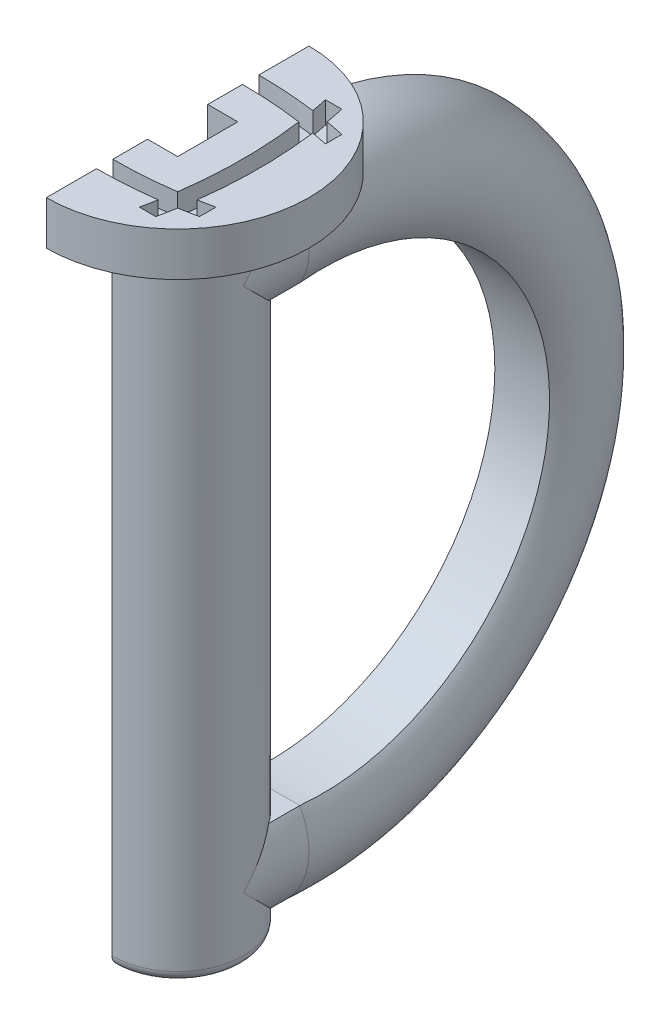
ISO-10303-21;
HEADER;
FILE_DESCRIPTION(('STEP AP214'),'2;1');
FILE_NAME('part.step','',(''),(''),'','','');
FILE_SCHEMA(('AUTOMOTIVE_DESIGN { 1 0 10303 214 1 1 1 1 }'));
ENDSEC;
DATA;
#1=APPLICATION_CONTEXT('core data for automotive mechanical design processes');
#2=APPLICATION_PROTOCOL_DEFINITION('international standard','automotive_design',2000,#1);
#3=PRODUCT_CONTEXT('',#1,'mechanical');
#4=PRODUCT('Part','Part','',(#3));
#5=PRODUCT_RELATED_PRODUCT_CATEGORY('part','',(#4));
#6=PRODUCT_DEFINITION_FORMATION('','',#4);
#7=PRODUCT_DEFINITION_CONTEXT('part definition',#1,'design');
#8=PRODUCT_DEFINITION('design','',#6,#7);
#9=PRODUCT_DEFINITION_SHAPE('','',#8);
#10=(LENGTH_UNIT() NAMED_UNIT(*) SI_UNIT(.MILLI.,.METRE.));
#11=(NAMED_UNIT(*) PLANE_ANGLE_UNIT() SI_UNIT($,.RADIAN.));
#12=(NAMED_UNIT(*) SI_UNIT($,.STERADIAN.) SOLID_ANGLE_UNIT());
#13=UNCERTAINTY_MEASURE_WITH_UNIT(LENGTH_MEASURE(1.E-05),#10,'distance_accuracy_value','');
#14=(GEOMETRIC_REPRESENTATION_CONTEXT(3) GLOBAL_UNCERTAINTY_ASSIGNED_CONTEXT((#13)) GLOBAL_UNIT_ASSIGNED_CONTEXT((#10,
#11,#12)) REPRESENTATION_CONTEXT('',''));
#15=CARTESIAN_POINT('',(0.,0.,0.));
#16=DIRECTION('',(0.,0.,1.));
#17=DIRECTION('',(1.,0.,0.));
#18=AXIS2_PLACEMENT_3D('',#15,#16,#17);
#19=CARTESIAN_POINT('',(0.,0.,0.));
#20=DIRECTION('',(0.,1.,0.));
#21=DIRECTION('',(0.,0.,1.));
#22=AXIS2_PLACEMENT_3D('',#19,#20,#21);
#23=PLANE('',#22);
#24=CARTESIAN_POINT('',(0.,0.,0.));
#25=DIRECTION('',(0.,1.,0.));
#26=DIRECTION('',(0.,0.,1.));
#27=AXIS2_PLACEMENT_3D('',#24,#25,#26);
#28=CIRCLE('',#27,24.);
#29=CARTESIAN_POINT('',(0.,0.,24.));
#30=VERTEX_POINT('',#29);
#31=CARTESIAN_POINT('',(0.,0.,-24.));
#32=VERTEX_POINT('',#31);
#33=EDGE_CURVE('E598',#30,#32,#28,.T.);
#34=ORIENTED_EDGE('',*,*,#33,.F.);
#35=DIRECTION('',(0.,0.,-1.));
#36=VECTOR('',#35,1.);
#37=CARTESIAN_POINT('',(0.,0.,0.));
#38=LINE('',#37,#36);
#39=CARTESIAN_POINT('',(0.,0.,12.));
#40=VERTEX_POINT('',#39);
#41=EDGE_CURVE('E802',#30,#40,#38,.T.);
#42=ORIENTED_EDGE('',*,*,#41,.T.);
#43=CARTESIAN_POINT('',(0.,0.,0.));
#44=DIRECTION('',(0.,1.,0.));
#45=DIRECTION('',(0.,0.,1.));
#46=AXIS2_PLACEMENT_3D('',#43,#44,#45);
#47=CIRCLE('',#46,12.);
#48=CARTESIAN_POINT('',(1.02303343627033,0.,-11.9563122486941));
#49=VERTEX_POINT('',#48);
#50=EDGE_CURVE('E597',#49,#40,#47,.F.);
#51=ORIENTED_EDGE('',*,*,#50,.F.);
#52=CARTESIAN_POINT('',(0.,0.,-11.4508895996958));
#53=CARTESIAN_POINT('',(-0.0676941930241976,0.,-11.4508888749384));
#54=CARTESIAN_POINT('',(-0.135386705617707,0.,-11.4572236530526));
#55=CARTESIAN_POINT('',(-0.268564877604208,0.,-11.481855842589));
#56=CARTESIAN_POINT('',(-0.334048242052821,0.,-11.500165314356));
#57=CARTESIAN_POINT('',(-0.474643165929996,0.,-11.5520036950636));
#58=CARTESIAN_POINT('',(-0.548856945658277,0.,-11.5879345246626));
#59=CARTESIAN_POINT('',(-0.690599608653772,0.,-11.671337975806));
#60=CARTESIAN_POINT('',(-0.758106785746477,0.,-11.7188464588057));
#61=CARTESIAN_POINT('',(-0.872174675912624,0.,-11.8108932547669));
#62=CARTESIAN_POINT('',(-0.920083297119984,0.,-11.8538000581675));
#63=CARTESIAN_POINT('',(-1.01189568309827,0.,-11.9435520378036));
#64=CARTESIAN_POINT('',(-1.0558052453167,0.,-11.9903913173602));
#65=CARTESIAN_POINT('',(-1.14010896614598,0.,-12.0873271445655));
#66=CARTESIAN_POINT('',(-1.18049347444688,0.,-12.1374320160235));
#67=CARTESIAN_POINT('',(-1.25794595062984,0.,-12.2401581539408));
#68=CARTESIAN_POINT('',(-1.29501244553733,0.,-12.2927805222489));
#69=CARTESIAN_POINT('',(-1.39755974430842,-1.29790876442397E-13,-12.4474467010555));
#70=CARTESIAN_POINT('',(-1.45918865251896,0.,-12.552051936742));
#71=CARTESIAN_POINT('',(-1.57338713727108,0.,-12.7660883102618));
#72=CARTESIAN_POINT('',(-1.6259501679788,0.,-12.8755228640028));
#73=CARTESIAN_POINT('',(-1.72337270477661,0.,-13.097998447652));
#74=CARTESIAN_POINT('',(-1.7682168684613,0.,-13.2110461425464));
#75=CARTESIAN_POINT('',(-1.85105383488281,0.,-13.4395719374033));
#76=CARTESIAN_POINT('',(-1.8890480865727,0.,-13.5550495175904));
#77=CARTESIAN_POINT('',(-1.95861273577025,0.,-13.7866763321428));
#78=CARTESIAN_POINT('',(-1.99024252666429,0.,-13.9028078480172));
#79=CARTESIAN_POINT('',(-2.0481028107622,0.,-14.1364159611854));
#80=CARTESIAN_POINT('',(-2.0743323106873,0.,-14.2538928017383));
#81=CARTESIAN_POINT('',(-2.14562609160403,0.,-14.6079761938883));
#82=CARTESIAN_POINT('',(-2.18325696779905,0.,-14.8461023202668));
#83=CARTESIAN_POINT('',(-2.24110543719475,0.,-15.3248585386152));
#84=CARTESIAN_POINT('',(-2.26128788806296,0.,-15.5654927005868));
#85=CARTESIAN_POINT('',(-2.28535197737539,0.,-16.0474590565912));
#86=CARTESIAN_POINT('',(-2.2892408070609,0.,-16.2887908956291));
#87=CARTESIAN_POINT('',(-2.28080066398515,0.,-16.7923937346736));
#88=CARTESIAN_POINT('',(-2.26701590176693,0.,-17.0546404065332));
#89=CARTESIAN_POINT('',(-2.22015841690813,0.,-17.5776770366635));
#90=CARTESIAN_POINT('',(-2.18707082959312,0.,-17.8384657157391));
#91=CARTESIAN_POINT('',(-2.12158774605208,0.,-18.2271262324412));
#92=CARTESIAN_POINT('',(-2.09709316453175,0.,-18.356357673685));
#93=CARTESIAN_POINT('',(-2.04241266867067,0.,-18.6136036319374));
#94=CARTESIAN_POINT('',(-2.01222766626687,0.,-18.7416183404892));
#95=CARTESIAN_POINT('',(-1.94568866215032,0.,-18.9958654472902));
#96=CARTESIAN_POINT('',(-1.90934278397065,0.,-19.1220999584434));
#97=CARTESIAN_POINT('',(-1.8297535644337,0.,-19.3723514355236));
#98=CARTESIAN_POINT('',(-1.78651239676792,0.,-19.4963690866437));
#99=CARTESIAN_POINT('',(-1.69354693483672,0.,-19.737778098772));
#100=CARTESIAN_POINT('',(-1.64405229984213,0.,-19.8552569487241));
#101=CARTESIAN_POINT('',(-1.53637894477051,0.,-20.0863417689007));
#102=CARTESIAN_POINT('',(-1.47819182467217,0.,-20.1999438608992));
#103=CARTESIAN_POINT('',(-1.35204522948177,0.,-20.4203708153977));
#104=CARTESIAN_POINT('',(-1.28417997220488,0.,-20.5272481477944));
#105=CARTESIAN_POINT('',(-1.1732323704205,0.,-20.6808016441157));
#106=CARTESIAN_POINT('',(-1.13476129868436,0.,-20.7308195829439));
#107=CARTESIAN_POINT('',(-1.05442529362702,0.,-20.8280359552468));
#108=CARTESIAN_POINT('',(-1.01256241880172,0.,-20.8752360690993));
#109=CARTESIAN_POINT('',(-0.937895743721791,0.,-20.95276128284));
#110=CARTESIAN_POINT('',(-0.90602370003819,0.,-20.9839841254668));
#111=CARTESIAN_POINT('',(-0.84030397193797,0.,-21.0442652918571));
#112=CARTESIAN_POINT('',(-0.806457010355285,0.,-21.0733243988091));
#113=CARTESIAN_POINT('',(-0.736751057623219,0.,-21.1288025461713));
#114=CARTESIAN_POINT('',(-0.700895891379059,0.,-21.155226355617));
#115=CARTESIAN_POINT('',(-0.627044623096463,0.,-21.2049991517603));
#116=CARTESIAN_POINT('',(-0.589045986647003,0.,-21.2283443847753));
#117=CARTESIAN_POINT('',(-0.493066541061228,0.,-21.2811804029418));
#118=CARTESIAN_POINT('',(-0.433904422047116,0.,-21.3085890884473));
#119=CARTESIAN_POINT('',(-0.311964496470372,0.,-21.3534080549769));
#120=CARTESIAN_POINT('',(-0.249193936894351,0.,-21.3708376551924));
#121=CARTESIAN_POINT('',(-0.120964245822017,0.,-21.3941118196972));
#122=CARTESIAN_POINT('',(-0.0554877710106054,0.,-21.3998636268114));
#123=CARTESIAN_POINT('',(0.0753601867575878,0.,-21.3988008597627));
#124=CARTESIAN_POINT('',(0.140731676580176,0.,-21.3919871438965));
#125=CARTESIAN_POINT('',(0.262447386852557,0.,-21.3679556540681));
#126=CARTESIAN_POINT('',(0.31902697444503,0.,-21.3518842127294));
#127=CARTESIAN_POINT('',(0.42926648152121,0.,-21.3116180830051));
#128=CARTESIAN_POINT('',(0.482921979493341,0.,-21.2874114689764));
#129=CARTESIAN_POINT('',(0.575708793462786,0.,-21.2382129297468));
#130=CARTESIAN_POINT('',(0.615515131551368,0.,-21.2144654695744));
#131=CARTESIAN_POINT('',(0.692826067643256,0.,-21.1635686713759));
#132=CARTESIAN_POINT('',(0.730332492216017,0.,-21.1364220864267));
#133=CARTESIAN_POINT('',(0.839713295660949,0.,-21.0505937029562));
#134=CARTESIAN_POINT('',(0.908247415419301,0.,-20.987636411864));
#135=CARTESIAN_POINT('',(1.02915740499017,0.,-20.8623747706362));
#136=CARTESIAN_POINT('',(1.08248314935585,0.,-20.8009569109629));
#137=CARTESIAN_POINT('',(1.18370335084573,0.,-20.6737496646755));
#138=CARTESIAN_POINT('',(1.23159399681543,0.,-20.6079572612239));
#139=CARTESIAN_POINT('',(1.32261461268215,0.,-20.4730558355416));
#140=CARTESIAN_POINT('',(1.3657376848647,2.39002855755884E-13,-20.403942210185));
#141=CARTESIAN_POINT('',(1.44773115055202,-2.39091390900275E-13,-20.2632187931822));
#142=CARTESIAN_POINT('',(1.48659996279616,-8.9256801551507E-13,-20.1916080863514));
#143=CARTESIAN_POINT('',(1.56145627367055,-9.14487297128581E-13,-20.0446513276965));
#144=CARTESIAN_POINT('',(1.59734782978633,-2.50500438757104E-13,-19.9692566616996));
#145=CARTESIAN_POINT('',(1.66554939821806,2.50552331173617E-13,-19.8168578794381));
#146=CARTESIAN_POINT('',(1.69785866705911,0.,-19.7398534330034));
#147=CARTESIAN_POINT('',(1.78996822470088,-1.7500024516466E-13,-19.5068149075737));
#148=CARTESIAN_POINT('',(1.8449050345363,0.,-19.3488470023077));
#149=CARTESIAN_POINT('',(1.94392596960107,0.,-19.0290902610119));
#150=CARTESIAN_POINT('',(1.98797622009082,0.,-18.8672911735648));
#151=CARTESIAN_POINT('',(2.06633448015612,0.,-18.5414196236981));
#152=CARTESIAN_POINT('',(2.10064549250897,0.,-18.3773478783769));
#153=CARTESIAN_POINT('',(2.15682665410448,0.,-18.0675507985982));
#154=CARTESIAN_POINT('',(2.17969922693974,0.,-17.9220047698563));
#155=CARTESIAN_POINT('',(2.21902766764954,0.,-17.630040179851));
#156=CARTESIAN_POINT('',(2.2354827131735,0.,-17.4836215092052));
#157=CARTESIAN_POINT('',(2.27566763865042,0.,-17.0433095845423));
#158=CARTESIAN_POINT('',(2.29018611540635,0.,-16.7485373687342));
#159=CARTESIAN_POINT('',(2.29539987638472,0.,-16.1596804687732));
#160=CARTESIAN_POINT('',(2.28616803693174,0.,-15.865596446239));
#161=CARTESIAN_POINT('',(2.25379149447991,0.,-15.4260106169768));
#162=CARTESIAN_POINT('',(2.23991887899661,0.,-15.2797871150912));
#163=CARTESIAN_POINT('',(2.2056822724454,0.,-14.9881109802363));
#164=CARTESIAN_POINT('',(2.18531945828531,0.,-14.8426582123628));
#165=CARTESIAN_POINT('',(2.14379099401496,0.,-14.5901609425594));
#166=CARTESIAN_POINT('',(2.12417869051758,0.,-14.4828592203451));
#167=CARTESIAN_POINT('',(2.0808806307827,0.,-14.2690828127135));
#168=CARTESIAN_POINT('',(2.05719516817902,0.,-14.1626080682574));
#169=CARTESIAN_POINT('',(2.0054041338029,0.,-13.9505871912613));
#170=CARTESIAN_POINT('',(1.97729286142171,0.,-13.8450424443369));
#171=CARTESIAN_POINT('',(1.91627365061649,0.,-13.6353439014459));
#172=CARTESIAN_POINT('',(1.88336586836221,-2.67926941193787E-13,-13.5311900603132));
#173=CARTESIAN_POINT('',(1.81195278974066,-2.69814189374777E-13,-13.3238477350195));
#174=CARTESIAN_POINT('',(1.77340369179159,0.,-13.2206742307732));
#175=CARTESIAN_POINT('',(1.69023367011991,0.,-13.0167434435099));
#176=CARTESIAN_POINT('',(1.6456107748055,0.,-12.9159869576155));
#177=CARTESIAN_POINT('',(1.54960330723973,0.,-12.7181182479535));
#178=CARTESIAN_POINT('',(1.49824096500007,0.,-12.620995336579));
#179=CARTESIAN_POINT('',(1.3876043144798,0.,-12.431415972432));
#180=CARTESIAN_POINT('',(1.3283375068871,0.,-12.3389552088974));
#181=CARTESIAN_POINT('',(1.20923901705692,0.,-12.1728029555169));
#182=CARTESIAN_POINT('',(1.15058952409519,0.,-12.0982725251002));
#183=CARTESIAN_POINT('',(1.02526052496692,0.,-11.9560238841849));
#184=CARTESIAN_POINT('',(0.958572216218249,0.,-11.8883132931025));
#185=CARTESIAN_POINT('',(0.815363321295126,0.,-11.7620066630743));
#186=CARTESIAN_POINT('',(0.738728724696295,0.,-11.7035371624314));
#187=CARTESIAN_POINT('',(0.576073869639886,0.,-11.6015230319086));
#188=CARTESIAN_POINT('',(0.490084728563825,-1.37397542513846E-13,-11.5579308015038));
#189=CARTESIAN_POINT('',(0.336300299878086,-1.03074652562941E-13,-11.5008327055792));
#190=CARTESIAN_POINT('',(0.270392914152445,0.,-11.4822784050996));
#191=CARTESIAN_POINT('',(0.136321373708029,0.,-11.4573140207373));
#192=CARTESIAN_POINT('',(0.0681598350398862,0.,-11.4508903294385));
#193=CARTESIAN_POINT('',(0.,0.,-11.4508895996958));
#194=B_SPLINE_CURVE_WITH_KNOTS('',3,(#52,#53,#54,#55,#56,#57,#58,#59,#60,#61,#62,#63,#64,#65,
#66,#67,#68,#69,#70,#71,#72,#73,#74,#75,#76,#77,#78,#79,#80,#81,#82,#83,#84,#85,#86,#87,#88,#89,
#90,#91,#92,#93,#94,#95,#96,#97,#98,#99,#100,#101,#102,#103,#104,#105,#106,#107,#108,#109,#110,
#111,#112,#113,#114,#115,#116,#117,#118,#119,#120,#121,#122,#123,#124,#125,#126,#127,#128,#129,
#130,#131,#132,#133,#134,#135,#136,#137,#138,#139,#140,#141,#142,#143,#144,#145,#146,#147,#148,
#149,#150,#151,#152,#153,#154,#155,#156,#157,#158,#159,#160,#161,#162,#163,#164,#165,#166,#167,
#168,#169,#170,#171,#172,#173,#174,#175,#176,#177,#178,#179,#180,#181,#182,#183,#184,#185,#186,
#187,#188,#189,#190,#191,#192,#193),.UNSPECIFIED.,.T.,.F.,(4,2,2,2,2,2,2,2,2,2,2,2,2,2,2,2,2,2,
2,2,2,2,2,2,2,2,2,2,2,2,2,2,2,2,2,2,2,2,2,2,2,2,2,2,2,2,2,2,2,2,2,2,2,2,2,2,2,2,2,2,2,2,2,2,2,2,
2,2,2,2,4),(0.,0.202801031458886,0.405806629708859,0.651803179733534,0.898571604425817,
1.09125042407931,1.28364531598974,1.47655139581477,1.66954269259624,2.03316070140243,
2.39704016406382,2.76163474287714,3.1261521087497,3.4870915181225,3.84809725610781,
4.57052371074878,5.29440181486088,6.01796039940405,6.80512825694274,7.59290309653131,
7.9873973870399,8.38182851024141,8.77574353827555,9.16953463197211,9.551675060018,
9.93418718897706,10.3132018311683,10.5023892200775,10.6914626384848,10.8252332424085,
10.958955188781,11.0924305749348,11.2260672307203,11.4209074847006,11.6153692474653,
11.8113696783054,12.0073567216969,12.1831168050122,12.3591356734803,12.4979975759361,
12.6367477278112,12.9149337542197,13.1586354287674,13.4025069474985,13.6467268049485,
13.8910371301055,14.1414357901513,14.3918863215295,14.8930921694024,15.395838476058,
15.8984296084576,16.3402767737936,16.7821805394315,17.6665253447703,18.5481598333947,
18.9886839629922,19.4291282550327,19.7562973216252,20.0834428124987,20.4110131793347,
20.7385728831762,21.0688260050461,21.3991865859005,21.7284836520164,22.0574704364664,
22.3415346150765,22.6259127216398,22.9138988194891,23.2009546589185,23.4053801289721,
23.6095761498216),.UNSPECIFIED.);
#195=CARTESIAN_POINT('',(0.,0.,-21.3993650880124));
#196=VERTEX_POINT('',#195);
#197=EDGE_CURVE('E560',#196,#49,#194,.T.);
#198=ORIENTED_EDGE('',*,*,#197,.F.);
#199=EDGE_CURVE('E799',#196,#32,#38,.T.);
#200=ORIENTED_EDGE('',*,*,#199,.T.);
#201=EDGE_LOOP('',(#34,#42,#51,#198,#200));
#202=FACE_BOUND('',#201,.T.);
#203=ADVANCED_FACE('F39',(#202),#23,.F.);
#204=CARTESIAN_POINT('',(0.,-120.,0.));
#205=DIRECTION('',(0.,1.,0.));
#206=DIRECTION('',(-1.,0.,0.));
#207=AXIS2_PLACEMENT_3D('',#204,#205,#206);
#208=PLANE('',#207);
#209=DIRECTION('',(0.,0.,1.));
#210=VECTOR('',#209,1.);
#211=CARTESIAN_POINT('',(0.,-120.,0.));
#212=LINE('',#211,#210);
#213=CARTESIAN_POINT('',(0.,-120.,-10.));
#214=VERTEX_POINT('',#213);
#215=CARTESIAN_POINT('',(0.,-120.,10.));
#216=VERTEX_POINT('',#215);
#217=EDGE_CURVE('E447',#214,#216,#212,.T.);
#218=ORIENTED_EDGE('',*,*,#217,.F.);
#219=CARTESIAN_POINT('',(0.,-120.,0.));
#220=DIRECTION('',(0.,1.,0.));
#221=DIRECTION('',(-1.,0.,0.));
#222=AXIS2_PLACEMENT_3D('',#219,#220,#221);
#223=CIRCLE('',#222,10.);
#224=EDGE_CURVE('E51',#214,#216,#223,.F.);
#225=ORIENTED_EDGE('',*,*,#224,.T.);
#226=EDGE_LOOP('',(#218,#225));
#227=FACE_BOUND('',#226,.T.);
#228=ADVANCED_FACE('F519',(#227),#208,.F.);
#229=CARTESIAN_POINT('',(0.,0.,0.));
#230=DIRECTION('',(0.,1.,0.));
#231=DIRECTION('',(-1.,0.,0.));
#232=AXIS2_PLACEMENT_3D('',#229,#230,#231);
#233=CYLINDRICAL_SURFACE('',#232,12.);
#234=DIRECTION('',(0.,1.,0.));
#235=VECTOR('',#234,1.);
#236=CARTESIAN_POINT('',(0.,0.,12.));
#237=LINE('',#236,#235);
#238=CARTESIAN_POINT('',(0.,-118.,12.));
#239=VERTEX_POINT('',#238);
#240=EDGE_CURVE('E825',#40,#239,#237,.F.);
#241=ORIENTED_EDGE('',*,*,#240,.T.);
#242=CARTESIAN_POINT('',(0.,-118.,0.));
#243=DIRECTION('',(0.,1.,0.));
#244=DIRECTION('',(-1.,0.,0.));
#245=AXIS2_PLACEMENT_3D('',#242,#243,#244);
#246=CIRCLE('',#245,12.);
#247=CARTESIAN_POINT('',(6.63324958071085,-118.,-10.));
#248=VERTEX_POINT('',#247);
#249=EDGE_CURVE('E467',#239,#248,#246,.T.);
#250=ORIENTED_EDGE('',*,*,#249,.T.);
#251=CARTESIAN_POINT('',(3.51088027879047,-119.474916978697,-11.4749169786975));
#252=CARTESIAN_POINT('',(3.66628710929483,-119.427370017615,-11.4273700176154));
#253=CARTESIAN_POINT('',(3.81987538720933,-119.376923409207,-11.376923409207));
#254=CARTESIAN_POINT('',(4.12316492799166,-119.27055129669,-11.27055129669));
#255=CARTESIAN_POINT('',(4.27286714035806,-119.214627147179,-11.2146271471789));
#256=CARTESIAN_POINT('',(4.71525136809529,-119.039331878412,-11.0393318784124));
#257=CARTESIAN_POINT('',(5.00187805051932,-118.912231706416,-10.9122317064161));
#258=CARTESIAN_POINT('',(5.55428771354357,-118.641593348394,-10.641593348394));
#259=CARTESIAN_POINT('',(5.82026698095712,-118.498253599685,-10.4982535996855));
#260=CARTESIAN_POINT('',(6.33443336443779,-118.196268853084,-10.1962688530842));
#261=CARTESIAN_POINT('',(6.58260964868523,-118.037614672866,-10.0376146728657));
#262=CARTESIAN_POINT('',(7.12000327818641,-117.666282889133,-9.66628288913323));
#263=CARTESIAN_POINT('',(7.40417445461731,-117.449953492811,-9.44995349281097));
#264=CARTESIAN_POINT('',(7.94445366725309,-117.000510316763,-9.00051031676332));
#265=CARTESIAN_POINT('',(8.20055860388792,-116.767394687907,-8.76739468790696));
#266=CARTESIAN_POINT('',(8.68666784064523,-116.286097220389,-8.2860972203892));
#267=CARTESIAN_POINT('',(8.91652528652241,-116.037841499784,-8.0378414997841));
#268=CARTESIAN_POINT('',(9.34940271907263,-115.529941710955,-7.52994171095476));
#269=CARTESIAN_POINT('',(9.55242074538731,-115.270296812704,-7.27029681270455));
#270=CARTESIAN_POINT('',(10.0094988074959,-114.63469120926,-6.63469120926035));
#271=CARTESIAN_POINT('',(10.2509639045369,-114.254183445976,-6.25418344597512));
#272=CARTESIAN_POINT('',(10.6851715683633,-113.479453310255,-5.47945331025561));
#273=CARTESIAN_POINT('',(10.8778911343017,-113.085224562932,-5.08522456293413));
#274=CARTESIAN_POINT('',(11.2163002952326,-112.287432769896,-4.28743276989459));
#275=CARTESIAN_POINT('',(11.3620530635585,-111.883883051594,-3.88388305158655));
#276=CARTESIAN_POINT('',(11.6083890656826,-111.070165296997,-3.07016529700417));
#277=CARTESIAN_POINT('',(11.7089923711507,-110.660000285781,-2.66000028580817));
#278=CARTESIAN_POINT('',(11.8581631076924,-109.877733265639,-1.87773326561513));
#279=CARTESIAN_POINT('',(11.911001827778,-109.506031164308,-1.5060311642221));
#280=CARTESIAN_POINT('',(11.9816538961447,-108.761346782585,-0.761346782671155));
#281=CARTESIAN_POINT('',(11.9995087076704,-108.388366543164,-0.388366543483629));
#282=CARTESIAN_POINT('',(11.9999966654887,-108.010327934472,-0.0103279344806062));
#283=CARTESIAN_POINT('',(11.9999999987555,-108.005163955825,-0.00516395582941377));
#284=CARTESIAN_POINT('',(12.,-108.,0.));
#285=B_SPLINE_CURVE_WITH_KNOTS('',3,(#251,#252,#253,#254,#255,#256,#257,#258,#259,#260,#261,
#262,#263,#264,#265,#266,#267,#268,#269,#270,#271,#272,#273,#274,#275,#276,#277,#278,#279,#280,
#281,#282,#283,#284),.UNSPECIFIED.,.F.,.F.,(4,2,2,2,2,2,2,2,2,2,2,2,2,2,2,2,4),(0.,
0.507859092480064,1.01559290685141,2.02888638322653,3.0309157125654,4.03354962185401,
5.28435359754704,6.53529557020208,7.79292511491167,9.05064646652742,10.8173779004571,
12.5849414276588,14.3501174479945,16.1145079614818,17.6983529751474,19.2803196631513,
19.3022285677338),.UNSPECIFIED.);
#286=CARTESIAN_POINT('',(12.,-108.,0.));
#287=VERTEX_POINT('',#286);
#288=EDGE_CURVE('E498',#287,#248,#285,.F.);
#289=ORIENTED_EDGE('',*,*,#288,.F.);
#290=CARTESIAN_POINT('',(10.,-101.366750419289,-6.63324958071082));
#291=CARTESIAN_POINT('',(10.1079076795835,-101.529437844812,-6.47056215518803));
#292=CARTESIAN_POINT('',(10.2111253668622,-101.693651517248,-6.30634848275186));
#293=CARTESIAN_POINT('',(10.4083660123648,-102.024794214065,-5.97520578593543));
#294=CARTESIAN_POINT('',(10.5023901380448,-102.191722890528,-5.80827710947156));
#295=CARTESIAN_POINT('',(10.7708864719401,-102.695945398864,-5.3040546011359));
#296=CARTESIAN_POINT('',(10.9319061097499,-103.036863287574,-4.96313671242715));
#297=CARTESIAN_POINT('',(11.2188736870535,-103.725011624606,-4.27498837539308));
#298=CARTESIAN_POINT('',(11.3449072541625,-104.072224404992,-3.92777559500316));
#299=CARTESIAN_POINT('',(11.5634475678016,-104.771849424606,-3.22815057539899));
#300=CARTESIAN_POINT('',(11.6559561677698,-105.124261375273,-2.87573862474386));
#301=CARTESIAN_POINT('',(11.8211989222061,-105.893065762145,-2.10693423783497));
#302=CARTESIAN_POINT('',(11.8878618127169,-106.310110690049,-1.68988930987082));
#303=CARTESIAN_POINT('',(11.9769715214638,-107.146322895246,-0.853677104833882));
#304=CARTESIAN_POINT('',(11.9994491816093,-107.565488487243,-0.434511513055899));
#305=CARTESIAN_POINT('',(11.9999966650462,-107.989672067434,-0.010327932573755));
#306=CARTESIAN_POINT('',(11.999999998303,-107.99483604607,-0.00516395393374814));
#307=CARTESIAN_POINT('',(12.,-108.,0.));
#308=B_SPLINE_CURVE_WITH_KNOTS('',3,(#290,#291,#292,#293,#294,#295,#296,#297,#298,#299,#300,
#301,#302,#303,#304,#305,#306,#307),.UNSPECIFIED.,.F.,.F.,(4,2,2,2,2,2,2,2,4),(0.,
0.762250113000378,1.52440330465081,3.04783422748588,4.56750303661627,6.08708781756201,
7.86607179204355,9.64381356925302,9.66572247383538),.UNSPECIFIED.);
#309=CARTESIAN_POINT('',(10.,-101.366750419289,-6.63324958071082));
#310=VERTEX_POINT('',#309);
#311=EDGE_CURVE('E505',#310,#287,#308,.T.);
#312=ORIENTED_EDGE('',*,*,#311,.F.);
#313=CARTESIAN_POINT('',(0.,-101.366750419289,0.));
#314=DIRECTION('',(0.,-1.,0.));
#315=DIRECTION('',(0.,0.,-1.));
#316=AXIS2_PLACEMENT_3D('',#313,#314,#315);
#317=CIRCLE('',#316,12.);
#318=CARTESIAN_POINT('',(0.,-101.366750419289,-12.));
#319=VERTEX_POINT('',#318);
#320=EDGE_CURVE('E511',#319,#310,#317,.T.);
#321=ORIENTED_EDGE('',*,*,#320,.F.);
#322=DIRECTION('',(0.,1.,0.));
#323=VECTOR('',#322,1.);
#324=CARTESIAN_POINT('',(0.,0.,-12.));
#325=LINE('',#324,#323);
#326=CARTESIAN_POINT('',(0.,-18.6332495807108,-12.));
#327=VERTEX_POINT('',#326);
#328=EDGE_CURVE('E790',#319,#327,#325,.T.);
#329=ORIENTED_EDGE('',*,*,#328,.T.);
#330=CARTESIAN_POINT('',(0.,-18.6332495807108,0.));
#331=DIRECTION('',(0.,-1.,0.));
#332=DIRECTION('',(0.,0.,-1.));
#333=AXIS2_PLACEMENT_3D('',#330,#331,#332);
#334=CIRCLE('',#333,12.);
#335=CARTESIAN_POINT('',(10.,-18.6332495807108,-6.63324958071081));
#336=VERTEX_POINT('',#335);
#337=EDGE_CURVE('E536',#327,#336,#334,.T.);
#338=ORIENTED_EDGE('',*,*,#337,.T.);
#339=CARTESIAN_POINT('',(0.,-12.,0.));
#340=DIRECTION('',(0.,0.707106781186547,-0.707106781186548));
#341=DIRECTION('',(0.,0.707106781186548,0.707106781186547));
#342=AXIS2_PLACEMENT_3D('',#339,#340,#341);
#343=ELLIPSE('',#342,16.9705627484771,12.);
#344=CARTESIAN_POINT('',(12.,-12.,0.));
#345=VERTEX_POINT('',#344);
#346=EDGE_CURVE('E861',#336,#345,#343,.F.);
#347=ORIENTED_EDGE('',*,*,#346,.T.);
#348=CARTESIAN_POINT('',(0.,-12.,0.));
#349=DIRECTION('',(0.,0.707106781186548,0.707106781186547));
#350=DIRECTION('',(0.,0.707106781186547,-0.707106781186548));
#351=AXIS2_PLACEMENT_3D('',#348,#349,#350);
#352=ELLIPSE('',#351,16.9705627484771,12.);
#353=CARTESIAN_POINT('',(3.51088027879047,-0.525083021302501,-11.4749169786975));
#354=VERTEX_POINT('',#353);
#355=EDGE_CURVE('E535',#345,#354,#352,.T.);
#356=ORIENTED_EDGE('',*,*,#355,.T.);
#357=CARTESIAN_POINT('',(1.02303343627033,0.,-11.9563122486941));
#358=CARTESIAN_POINT('',(1.10941671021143,-0.00802292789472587,-11.9489217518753));
#359=CARTESIAN_POINT('',(1.19562578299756,-0.0170567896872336,-11.9406015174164));
#360=CARTESIAN_POINT('',(1.36729489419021,-0.037085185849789,-11.9221610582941));
#361=CARTESIAN_POINT('',(1.4527565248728,-0.0480723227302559,-11.9120476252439));
#362=CARTESIAN_POINT('',(1.62293995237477,-0.0719733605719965,-11.8900550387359));
#363=CARTESIAN_POINT('',(1.707663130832,-0.0848819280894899,-11.8781807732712));
#364=CARTESIAN_POINT('',(1.87637874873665,-0.112594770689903,-11.8526987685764));
#365=CARTESIAN_POINT('',(1.96037221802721,-0.127395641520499,-11.839094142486));
#366=CARTESIAN_POINT('',(2.12763649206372,-0.158866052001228,-11.8101803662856));
#367=CARTESIAN_POINT('',(2.210907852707,-0.175533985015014,-11.7948726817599));
#368=CARTESIAN_POINT('',(2.37671763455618,-0.210711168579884,-11.7625824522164));
#369=CARTESIAN_POINT('',(2.45925618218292,-0.229220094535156,-11.7456002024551));
#370=CARTESIAN_POINT('',(2.62363030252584,-0.26806326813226,-11.7099804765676));
#371=CARTESIAN_POINT('',(2.70546512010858,-0.288399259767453,-11.6913414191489));
#372=CARTESIAN_POINT('',(2.86844113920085,-0.330880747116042,-11.6524279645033));
#373=CARTESIAN_POINT('',(2.94958078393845,-0.353029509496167,-11.6321506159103));
#374=CARTESIAN_POINT('',(3.11117412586,-0.399124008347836,-11.5899778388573));
#375=CARTESIAN_POINT('',(3.19162539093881,-0.423074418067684,-11.5680782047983));
#376=CARTESIAN_POINT('',(3.35184957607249,-0.472762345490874,-11.5226761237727));
#377=CARTESIAN_POINT('',(3.43161912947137,-0.498505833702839,-11.499168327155));
#378=CARTESIAN_POINT('',(3.51088027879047,-0.525083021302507,-11.4749169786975));
#379=B_SPLINE_CURVE_WITH_KNOTS('',3,(#357,#358,#359,#360,#361,#362,#363,#364,#365,#366,#367,
#368,#369,#370,#371,#372,#373,#374,#375,#376,#377,#378),.UNSPECIFIED.,.F.,.F.,(4,2,2,2,2,2,2,2,
2,2,4),(0.,0.261195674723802,0.521422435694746,0.780939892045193,1.03999687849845,
1.29883263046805,1.55762282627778,1.81666272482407,2.07618015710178,2.33639563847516,
2.59752332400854),.UNSPECIFIED.);
#380=EDGE_CURVE('E527',#49,#354,#379,.T.);
#381=ORIENTED_EDGE('',*,*,#380,.F.);
#382=ORIENTED_EDGE('',*,*,#50,.T.);
#383=EDGE_LOOP('',(#241,#250,#289,#312,#321,#329,#338,#347,#356,#381,#382));
#384=FACE_BOUND('',#383,.T.);
#385=ADVANCED_FACE('F513',(#384),#233,.T.);
#386=CARTESIAN_POINT('',(0.,8.,0.));
#387=DIRECTION('',(0.,-1.,0.));
#388=DIRECTION('',(0.,0.,-1.));
#389=AXIS2_PLACEMENT_3D('',#386,#387,#388);
#390=CYLINDRICAL_SURFACE('',#389,24.);
#391=CARTESIAN_POINT('',(0.,8.,0.));
#392=DIRECTION('',(0.,1.,0.));
#393=DIRECTION('',(0.,0.,1.));
#394=AXIS2_PLACEMENT_3D('',#391,#392,#393);
#395=CIRCLE('',#394,24.);
#396=CARTESIAN_POINT('',(0.,8.00000000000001,24.));
#397=VERTEX_POINT('',#396);
#398=CARTESIAN_POINT('',(0.,8.00000000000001,-24.));
#399=VERTEX_POINT('',#398);
#400=EDGE_CURVE('E591',#397,#399,#395,.T.);
#401=ORIENTED_EDGE('',*,*,#400,.F.);
#402=DIRECTION('',(0.,-1.,0.));
#403=VECTOR('',#402,1.);
#404=CARTESIAN_POINT('',(0.,8.,24.));
#405=LINE('',#404,#403);
#406=EDGE_CURVE('E593',#397,#30,#405,.T.);
#407=ORIENTED_EDGE('',*,*,#406,.T.);
#408=ORIENTED_EDGE('',*,*,#33,.T.);
#409=DIRECTION('',(0.,-1.,0.));
#410=VECTOR('',#409,1.);
#411=CARTESIAN_POINT('',(0.,8.,-24.));
#412=LINE('',#411,#410);
#413=EDGE_CURVE('E595',#32,#399,#412,.F.);
#414=ORIENTED_EDGE('',*,*,#413,.T.);
#415=EDGE_LOOP('',(#401,#407,#408,#414));
#416=FACE_BOUND('',#415,.T.);
#417=ADVANCED_FACE('F518',(#416),#390,.T.);
#418=CARTESIAN_POINT('',(0.,8.,0.));
#419=DIRECTION('',(0.,1.,0.));
#420=DIRECTION('',(0.,0.,1.));
#421=AXIS2_PLACEMENT_3D('',#418,#419,#420);
#422=PLANE('',#421);
#423=DIRECTION('',(0.,0.,1.));
#424=VECTOR('',#423,1.);
#425=CARTESIAN_POINT('',(0.,8.00000000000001,36.1347435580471));
#426=LINE('',#425,#424);
#427=CARTESIAN_POINT('',(0.,8.00000000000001,14.8271146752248));
#428=VERTEX_POINT('',#427);
#429=EDGE_CURVE('E454',#428,#397,#426,.T.);
#430=ORIENTED_EDGE('',*,*,#429,.T.);
#431=ORIENTED_EDGE('',*,*,#400,.T.);
#432=CARTESIAN_POINT('',(0.,8.00000000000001,-14.8271146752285));
#433=VERTEX_POINT('',#432);
#434=EDGE_CURVE('E459',#399,#433,#426,.T.);
#435=ORIENTED_EDGE('',*,*,#434,.T.);
#436=CARTESIAN_POINT('',(0.,8.,65.1728853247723));
#437=DIRECTION('',(0.,1.,0.));
#438=DIRECTION('',(0.,0.,-1.));
#439=AXIS2_PLACEMENT_3D('',#436,#437,#438);
#440=CIRCLE('',#439,80.0000000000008);
#441=CARTESIAN_POINT('',(10.5758870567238,8.,-14.1249747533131));
#442=VERTEX_POINT('',#441);
#443=EDGE_CURVE('E654',#442,#433,#440,.T.);
#444=ORIENTED_EDGE('',*,*,#443,.F.);
#445=CARTESIAN_POINT('',(-67.4053186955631,8.,9.37728701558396E-11));
#446=DIRECTION('',(0.,-1.,0.));
#447=DIRECTION('',(0.,0.,-1.));
#448=AXIS2_PLACEMENT_3D('',#445,#446,#447);
#449=CIRCLE('',#448,79.2501316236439);
#450=CARTESIAN_POINT('',(10.0000000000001,8.,-17.));
#451=VERTEX_POINT('',#450);
#452=EDGE_CURVE('E658',#451,#442,#449,.T.);
#453=ORIENTED_EDGE('',*,*,#452,.F.);
#454=DIRECTION('',(-1.,0.,0.));
#455=VECTOR('',#454,1.);
#456=CARTESIAN_POINT('',(13.0000000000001,8.,-17.));
#457=LINE('',#456,#455);
#458=CARTESIAN_POINT('',(13.0000000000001,8.,-17.));
#459=VERTEX_POINT('',#458);
#460=EDGE_CURVE('E661',#459,#451,#457,.T.);
#461=ORIENTED_EDGE('',*,*,#460,.F.);
#462=CARTESIAN_POINT('',(-65.1728853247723,8.,-2.25815189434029E-13));
#463=DIRECTION('',(0.,1.,0.));
#464=DIRECTION('',(0.,0.,-1.));
#465=AXIS2_PLACEMENT_3D('',#462,#463,#464);
#466=CIRCLE('',#465,80.);
#467=CARTESIAN_POINT('',(13.6534076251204,8.,-13.6534076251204));
#468=VERTEX_POINT('',#467);
#469=EDGE_CURVE('E664',#468,#459,#466,.T.);
#470=ORIENTED_EDGE('',*,*,#469,.F.);
#471=CARTESIAN_POINT('',(0.,8.,65.1728853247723));
#472=DIRECTION('',(0.,1.,0.));
#473=DIRECTION('',(0.,0.,-1.));
#474=AXIS2_PLACEMENT_3D('',#471,#472,#473);
#475=CIRCLE('',#474,80.);
#476=CARTESIAN_POINT('',(17.,8.,-13.));
#477=VERTEX_POINT('',#476);
#478=EDGE_CURVE('E667',#477,#468,#475,.T.);
#479=ORIENTED_EDGE('',*,*,#478,.F.);
#480=DIRECTION('',(0.,0.,-1.));
#481=VECTOR('',#480,1.);
#482=CARTESIAN_POINT('',(17.,8.,-10.0000000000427));
#483=LINE('',#482,#481);
#484=CARTESIAN_POINT('',(17.,8.,-10.0000000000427));
#485=VERTEX_POINT('',#484);
#486=EDGE_CURVE('E670',#485,#477,#483,.T.);
#487=ORIENTED_EDGE('',*,*,#486,.F.);
#488=CARTESIAN_POINT('',(9.68253255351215E-11,8.,67.4053186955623));
#489=DIRECTION('',(0.,-1.,0.));
#490=DIRECTION('',(0.,0.,-1.));
#491=AXIS2_PLACEMENT_3D('',#488,#489,#490);
#492=CIRCLE('',#491,79.2501316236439);
#493=CARTESIAN_POINT('',(14.1249747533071,8.,-10.5758870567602));
#494=VERTEX_POINT('',#493);
#495=EDGE_CURVE('E673',#494,#485,#492,.T.);
#496=ORIENTED_EDGE('',*,*,#495,.F.);
#497=CARTESIAN_POINT('',(-65.1728853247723,8.,-2.25815189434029E-13));
#498=DIRECTION('',(0.,1.,0.));
#499=DIRECTION('',(0.,0.,-1.));
#500=AXIS2_PLACEMENT_3D('',#497,#498,#499);
#501=CIRCLE('',#500,80.);
#502=CARTESIAN_POINT('',(14.1249747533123,8.,10.5758870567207));
#503=VERTEX_POINT('',#502);
#504=EDGE_CURVE('E676',#503,#494,#501,.T.);
#505=ORIENTED_EDGE('',*,*,#504,.F.);
#506=CARTESIAN_POINT('',(-9.45576231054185E-11,8.,-67.4053186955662));
#507=DIRECTION('',(0.,-1.,0.));
#508=DIRECTION('',(0.,0.,-1.));
#509=AXIS2_PLACEMENT_3D('',#506,#507,#508);
#510=CIRCLE('',#509,79.2501316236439);
#511=CARTESIAN_POINT('',(17.0000000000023,8.,9.99999999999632));
#512=VERTEX_POINT('',#511);
#513=EDGE_CURVE('E679',#512,#503,#510,.T.);
#514=ORIENTED_EDGE('',*,*,#513,.F.);
#515=DIRECTION('',(0.,0.,-1.));
#516=VECTOR('',#515,1.);
#517=CARTESIAN_POINT('',(17.0000000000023,8.,12.9999999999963));
#518=LINE('',#517,#516);
#519=CARTESIAN_POINT('',(17.0000000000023,8.,12.9999999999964));
#520=VERTEX_POINT('',#519);
#521=EDGE_CURVE('E682',#520,#512,#518,.T.);
#522=ORIENTED_EDGE('',*,*,#521,.F.);
#523=CARTESIAN_POINT('',(4.53365102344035E-13,8.,-65.1728853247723));
#524=DIRECTION('',(0.,1.,0.));
#525=DIRECTION('',(0.,0.,-1.));
#526=AXIS2_PLACEMENT_3D('',#523,#524,#525);
#527=CIRCLE('',#526,79.9999999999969);
#528=CARTESIAN_POINT('',(13.6534076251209,8.,13.6534076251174));
#529=VERTEX_POINT('',#528);
#530=EDGE_CURVE('E685',#529,#520,#527,.T.);
#531=ORIENTED_EDGE('',*,*,#530,.F.);
#532=CARTESIAN_POINT('',(-65.1728853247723,8.,-2.25815189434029E-13));
#533=DIRECTION('',(0.,1.,0.));
#534=DIRECTION('',(0.,0.,-1.));
#535=AXIS2_PLACEMENT_3D('',#532,#533,#534);
#536=CIRCLE('',#535,80.);
#537=CARTESIAN_POINT('',(12.9999999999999,8.,17.));
#538=VERTEX_POINT('',#537);
#539=EDGE_CURVE('E688',#538,#529,#536,.T.);
#540=ORIENTED_EDGE('',*,*,#539,.F.);
#541=DIRECTION('',(1.,0.,1.0327387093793E-12));
#542=VECTOR('',#541,1.);
#543=CARTESIAN_POINT('',(10.0000000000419,8.,16.9999999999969));
#544=LINE('',#543,#542);
#545=CARTESIAN_POINT('',(10.0000000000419,8.,16.999999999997));
#546=VERTEX_POINT('',#545);
#547=EDGE_CURVE('E691',#546,#538,#544,.T.);
#548=ORIENTED_EDGE('',*,*,#547,.F.);
#549=CARTESIAN_POINT('',(-67.4053186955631,8.,9.37728701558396E-11));
#550=DIRECTION('',(0.,-1.,0.));
#551=DIRECTION('',(0.,0.,-1.));
#552=AXIS2_PLACEMENT_3D('',#549,#550,#551);
#553=CIRCLE('',#552,79.2501316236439);
#554=CARTESIAN_POINT('',(10.5758870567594,8.,14.1249747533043));
#555=VERTEX_POINT('',#554);
#556=EDGE_CURVE('E694',#555,#546,#553,.T.);
#557=ORIENTED_EDGE('',*,*,#556,.F.);
#558=CARTESIAN_POINT('',(4.53365102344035E-13,8.,-65.1728853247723));
#559=DIRECTION('',(0.,1.,0.));
#560=DIRECTION('',(0.,0.,-1.));
#561=AXIS2_PLACEMENT_3D('',#558,#559,#560);
#562=CIRCLE('',#561,79.9999999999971);
#563=EDGE_CURVE('E697',#428,#555,#562,.T.);
#564=ORIENTED_EDGE('',*,*,#563,.F.);
#565=EDGE_LOOP('',(#430,#431,#435,#444,#453,#461,#470,#479,#487,#496,#505,#514,#522,#531,#540,
#548,#557,#564));
#566=FACE_BOUND('',#565,.T.);
#567=ADVANCED_FACE('F576',(#566),#422,.T.);
#568=CARTESIAN_POINT('',(0.,4.,65.1728853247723));
#569=DIRECTION('',(0.,1.,0.));
#570=DIRECTION('',(0.,0.,1.));
#571=AXIS2_PLACEMENT_3D('',#568,#569,#570);
#572=CYLINDRICAL_SURFACE('',#571,80.0000000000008);
#573=ORIENTED_EDGE('',*,*,#443,.T.);
#574=DIRECTION('',(0.,1.,0.));
#575=VECTOR('',#574,1.);
#576=CARTESIAN_POINT('',(0.,4.,-14.8271146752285));
#577=LINE('',#576,#575);
#578=CARTESIAN_POINT('',(0.,4.,-14.8271146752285));
#579=VERTEX_POINT('',#578);
#580=EDGE_CURVE('E821',#433,#579,#577,.F.);
#581=ORIENTED_EDGE('',*,*,#580,.T.);
#582=CARTESIAN_POINT('',(0.,4.,65.1728853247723));
#583=DIRECTION('',(0.,1.,0.));
#584=DIRECTION('',(0.,0.,-1.));
#585=AXIS2_PLACEMENT_3D('',#582,#583,#584);
#586=CIRCLE('',#585,80.0000000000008);
#587=CARTESIAN_POINT('',(10.5758870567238,4.,-14.1249747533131));
#588=VERTEX_POINT('',#587);
#589=EDGE_CURVE('E629',#588,#579,#586,.T.);
#590=ORIENTED_EDGE('',*,*,#589,.F.);
#591=DIRECTION('',(0.,1.,0.));
#592=VECTOR('',#591,1.);
#593=CARTESIAN_POINT('',(10.5758870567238,4.,-14.1249747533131));
#594=LINE('',#593,#592);
#595=EDGE_CURVE('E618',#588,#442,#594,.T.);
#596=ORIENTED_EDGE('',*,*,#595,.T.);
#597=EDGE_LOOP('',(#573,#581,#590,#596));
#598=FACE_BOUND('',#597,.T.);
#599=ADVANCED_FACE('F584',(#598),#572,.F.);
#600=CARTESIAN_POINT('',(-67.4053186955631,4.,9.37728701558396E-11));
#601=DIRECTION('',(0.,1.,0.));
#602=DIRECTION('',(0.,0.,1.));
#603=AXIS2_PLACEMENT_3D('',#600,#601,#602);
#604=CYLINDRICAL_SURFACE('',#603,79.2501316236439);
#605=ORIENTED_EDGE('',*,*,#452,.T.);
#606=ORIENTED_EDGE('',*,*,#595,.F.);
#607=CARTESIAN_POINT('',(-67.4053186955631,4.,9.37728701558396E-11));
#608=DIRECTION('',(0.,-1.,0.));
#609=DIRECTION('',(0.,0.,-1.));
#610=AXIS2_PLACEMENT_3D('',#607,#608,#609);
#611=CIRCLE('',#610,79.2501316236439);
#612=CARTESIAN_POINT('',(10.0000000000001,4.,-17.));
#613=VERTEX_POINT('',#612);
#614=EDGE_CURVE('E702',#613,#588,#611,.T.);
#615=ORIENTED_EDGE('',*,*,#614,.F.);
#616=DIRECTION('',(0.,1.,0.));
#617=VECTOR('',#616,1.);
#618=CARTESIAN_POINT('',(10.0000000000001,4.,-17.));
#619=LINE('',#618,#617);
#620=EDGE_CURVE('E651',#613,#451,#619,.T.);
#621=ORIENTED_EDGE('',*,*,#620,.T.);
#622=EDGE_LOOP('',(#605,#606,#615,#621));
#623=FACE_BOUND('',#622,.T.);
#624=ADVANCED_FACE('F1179',(#623),#604,.T.);
#625=CARTESIAN_POINT('',(13.0000000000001,4.,-17.));
#626=DIRECTION('',(0.,0.,-1.));
#627=DIRECTION('',(-1.,0.,0.));
#628=AXIS2_PLACEMENT_3D('',#625,#626,#627);
#629=PLANE('',#628);
#630=ORIENTED_EDGE('',*,*,#460,.T.);
#631=ORIENTED_EDGE('',*,*,#620,.F.);
#632=DIRECTION('',(-1.,0.,0.));
#633=VECTOR('',#632,1.);
#634=CARTESIAN_POINT('',(13.0000000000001,4.,-17.));
#635=LINE('',#634,#633);
#636=CARTESIAN_POINT('',(13.0000000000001,4.,-17.));
#637=VERTEX_POINT('',#636);
#638=EDGE_CURVE('E705',#637,#613,#635,.T.);
#639=ORIENTED_EDGE('',*,*,#638,.F.);
#640=DIRECTION('',(0.,1.,0.));
#641=VECTOR('',#640,1.);
#642=CARTESIAN_POINT('',(13.0000000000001,4.,-17.));
#643=LINE('',#642,#641);
#644=EDGE_CURVE('E649',#637,#459,#643,.T.);
#645=ORIENTED_EDGE('',*,*,#644,.T.);
#646=EDGE_LOOP('',(#630,#631,#639,#645));
#647=FACE_BOUND('',#646,.T.);
#648=ADVANCED_FACE('F1313',(#647),#629,.F.);
#649=CARTESIAN_POINT('',(-65.1728853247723,4.,-2.25815189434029E-13));
#650=DIRECTION('',(0.,1.,0.));
#651=DIRECTION('',(0.,0.,1.));
#652=AXIS2_PLACEMENT_3D('',#649,#650,#651);
#653=CYLINDRICAL_SURFACE('',#652,80.);
#654=ORIENTED_EDGE('',*,*,#469,.T.);
#655=ORIENTED_EDGE('',*,*,#644,.F.);
#656=CARTESIAN_POINT('',(-65.1728853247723,4.,-2.25815189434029E-13));
#657=DIRECTION('',(0.,1.,0.));
#658=DIRECTION('',(0.,0.,-1.));
#659=AXIS2_PLACEMENT_3D('',#656,#657,#658);
#660=CIRCLE('',#659,80.);
#661=CARTESIAN_POINT('',(13.6534076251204,4.,-13.6534076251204));
#662=VERTEX_POINT('',#661);
#663=EDGE_CURVE('E708',#662,#637,#660,.T.);
#664=ORIENTED_EDGE('',*,*,#663,.F.);
#665=DIRECTION('',(0.,1.,0.));
#666=VECTOR('',#665,1.);
#667=CARTESIAN_POINT('',(13.6534076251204,4.,-13.6534076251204));
#668=LINE('',#667,#666);
#669=EDGE_CURVE('E647',#662,#468,#668,.T.);
#670=ORIENTED_EDGE('',*,*,#669,.T.);
#671=EDGE_LOOP('',(#654,#655,#664,#670));
#672=FACE_BOUND('',#671,.T.);
#673=ADVANCED_FACE('F1303',(#672),#653,.F.);
#674=CARTESIAN_POINT('',(0.,4.,65.1728853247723));
#675=DIRECTION('',(0.,1.,0.));
#676=DIRECTION('',(0.,0.,1.));
#677=AXIS2_PLACEMENT_3D('',#674,#675,#676);
#678=CYLINDRICAL_SURFACE('',#677,80.);
#679=ORIENTED_EDGE('',*,*,#478,.T.);
#680=ORIENTED_EDGE('',*,*,#669,.F.);
#681=CARTESIAN_POINT('',(0.,4.,65.1728853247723));
#682=DIRECTION('',(0.,1.,0.));
#683=DIRECTION('',(0.,0.,-1.));
#684=AXIS2_PLACEMENT_3D('',#681,#682,#683);
#685=CIRCLE('',#684,80.);
#686=CARTESIAN_POINT('',(17.,4.,-13.));
#687=VERTEX_POINT('',#686);
#688=EDGE_CURVE('E711',#687,#662,#685,.T.);
#689=ORIENTED_EDGE('',*,*,#688,.F.);
#690=DIRECTION('',(0.,1.,0.));
#691=VECTOR('',#690,1.);
#692=CARTESIAN_POINT('',(17.,4.,-13.));
#693=LINE('',#692,#691);
#694=EDGE_CURVE('E645',#687,#477,#693,.T.);
#695=ORIENTED_EDGE('',*,*,#694,.T.);
#696=EDGE_LOOP('',(#679,#680,#689,#695));
#697=FACE_BOUND('',#696,.T.);
#698=ADVANCED_FACE('F1293',(#697),#678,.F.);
#699=CARTESIAN_POINT('',(17.,4.,-10.0000000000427));
#700=DIRECTION('',(1.,0.,0.));
#701=DIRECTION('',(0.,0.,-1.));
#702=AXIS2_PLACEMENT_3D('',#699,#700,#701);
#703=PLANE('',#702);
#704=ORIENTED_EDGE('',*,*,#486,.T.);
#705=ORIENTED_EDGE('',*,*,#694,.F.);
#706=DIRECTION('',(0.,0.,-1.));
#707=VECTOR('',#706,1.);
#708=CARTESIAN_POINT('',(17.,4.,-10.0000000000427));
#709=LINE('',#708,#707);
#710=CARTESIAN_POINT('',(17.,4.,-10.0000000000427));
#711=VERTEX_POINT('',#710);
#712=EDGE_CURVE('E714',#711,#687,#709,.T.);
#713=ORIENTED_EDGE('',*,*,#712,.F.);
#714=DIRECTION('',(0.,1.,0.));
#715=VECTOR('',#714,1.);
#716=CARTESIAN_POINT('',(17.,4.,-10.0000000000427));
#717=LINE('',#716,#715);
#718=EDGE_CURVE('E643',#711,#485,#717,.T.);
#719=ORIENTED_EDGE('',*,*,#718,.T.);
#720=EDGE_LOOP('',(#704,#705,#713,#719));
#721=FACE_BOUND('',#720,.T.);
#722=ADVANCED_FACE('F1283',(#721),#703,.F.);
#723=CARTESIAN_POINT('',(9.68253255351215E-11,4.,67.4053186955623));
#724=DIRECTION('',(0.,1.,0.));
#725=DIRECTION('',(0.,0.,1.));
#726=AXIS2_PLACEMENT_3D('',#723,#724,#725);
#727=CYLINDRICAL_SURFACE('',#726,79.2501316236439);
#728=ORIENTED_EDGE('',*,*,#495,.T.);
#729=ORIENTED_EDGE('',*,*,#718,.F.);
#730=CARTESIAN_POINT('',(9.68253255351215E-11,4.,67.4053186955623));
#731=DIRECTION('',(0.,-1.,0.));
#732=DIRECTION('',(0.,0.,-1.));
#733=AXIS2_PLACEMENT_3D('',#730,#731,#732);
#734=CIRCLE('',#733,79.2501316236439);
#735=CARTESIAN_POINT('',(14.1249747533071,4.,-10.5758870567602));
#736=VERTEX_POINT('',#735);
#737=EDGE_CURVE('E717',#736,#711,#734,.T.);
#738=ORIENTED_EDGE('',*,*,#737,.F.);
#739=DIRECTION('',(0.,1.,0.));
#740=VECTOR('',#739,1.);
#741=CARTESIAN_POINT('',(14.1249747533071,4.,-10.5758870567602));
#742=LINE('',#741,#740);
#743=EDGE_CURVE('E641',#736,#494,#742,.T.);
#744=ORIENTED_EDGE('',*,*,#743,.T.);
#745=EDGE_LOOP('',(#728,#729,#738,#744));
#746=FACE_BOUND('',#745,.T.);
#747=ADVANCED_FACE('F1273',(#746),#727,.T.);
#748=CARTESIAN_POINT('',(-65.1728853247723,4.,-2.25815189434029E-13));
#749=DIRECTION('',(0.,1.,0.));
#750=DIRECTION('',(0.,0.,1.));
#751=AXIS2_PLACEMENT_3D('',#748,#749,#750);
#752=CYLINDRICAL_SURFACE('',#751,80.);
#753=ORIENTED_EDGE('',*,*,#504,.T.);
#754=ORIENTED_EDGE('',*,*,#743,.F.);
#755=CARTESIAN_POINT('',(-65.1728853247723,4.,-2.25815189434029E-13));
#756=DIRECTION('',(0.,1.,0.));
#757=DIRECTION('',(0.,0.,-1.));
#758=AXIS2_PLACEMENT_3D('',#755,#756,#757);
#759=CIRCLE('',#758,80.);
#760=CARTESIAN_POINT('',(14.1249747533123,4.,10.5758870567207));
#761=VERTEX_POINT('',#760);
#762=EDGE_CURVE('E720',#761,#736,#759,.T.);
#763=ORIENTED_EDGE('',*,*,#762,.F.);
#764=DIRECTION('',(0.,1.,0.));
#765=VECTOR('',#764,1.);
#766=CARTESIAN_POINT('',(14.1249747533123,4.,10.5758870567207));
#767=LINE('',#766,#765);
#768=EDGE_CURVE('E639',#761,#503,#767,.T.);
#769=ORIENTED_EDGE('',*,*,#768,.T.);
#770=EDGE_LOOP('',(#753,#754,#763,#769));
#771=FACE_BOUND('',#770,.T.);
#772=ADVANCED_FACE('F1263',(#771),#752,.F.);
#773=CARTESIAN_POINT('',(-9.45576231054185E-11,4.,-67.4053186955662));
#774=DIRECTION('',(0.,1.,0.));
#775=DIRECTION('',(0.,0.,1.));
#776=AXIS2_PLACEMENT_3D('',#773,#774,#775);
#777=CYLINDRICAL_SURFACE('',#776,79.2501316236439);
#778=ORIENTED_EDGE('',*,*,#513,.T.);
#779=ORIENTED_EDGE('',*,*,#768,.F.);
#780=CARTESIAN_POINT('',(-9.45576231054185E-11,4.,-67.4053186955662));
#781=DIRECTION('',(0.,-1.,0.));
#782=DIRECTION('',(0.,0.,-1.));
#783=AXIS2_PLACEMENT_3D('',#780,#781,#782);
#784=CIRCLE('',#783,79.2501316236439);
#785=CARTESIAN_POINT('',(17.0000000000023,4.,9.99999999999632));
#786=VERTEX_POINT('',#785);
#787=EDGE_CURVE('E723',#786,#761,#784,.T.);
#788=ORIENTED_EDGE('',*,*,#787,.F.);
#789=DIRECTION('',(0.,1.,0.));
#790=VECTOR('',#789,1.);
#791=CARTESIAN_POINT('',(17.0000000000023,4.,9.99999999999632));
#792=LINE('',#791,#790);
#793=EDGE_CURVE('E637',#786,#512,#792,.T.);
#794=ORIENTED_EDGE('',*,*,#793,.T.);
#795=EDGE_LOOP('',(#778,#779,#788,#794));
#796=FACE_BOUND('',#795,.T.);
#797=ADVANCED_FACE('F1253',(#796),#777,.T.);
#798=CARTESIAN_POINT('',(17.0000000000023,4.,12.9999999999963));
#799=DIRECTION('',(1.,0.,0.));
#800=DIRECTION('',(0.,0.,-1.));
#801=AXIS2_PLACEMENT_3D('',#798,#799,#800);
#802=PLANE('',#801);
#803=ORIENTED_EDGE('',*,*,#521,.T.);
#804=ORIENTED_EDGE('',*,*,#793,.F.);
#805=DIRECTION('',(0.,0.,-1.));
#806=VECTOR('',#805,1.);
#807=CARTESIAN_POINT('',(17.0000000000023,4.,12.9999999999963));
#808=LINE('',#807,#806);
#809=CARTESIAN_POINT('',(17.0000000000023,4.,12.9999999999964));
#810=VERTEX_POINT('',#809);
#811=EDGE_CURVE('E726',#810,#786,#808,.T.);
#812=ORIENTED_EDGE('',*,*,#811,.F.);
#813=DIRECTION('',(0.,1.,0.));
#814=VECTOR('',#813,1.);
#815=CARTESIAN_POINT('',(17.0000000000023,4.,12.9999999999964));
#816=LINE('',#815,#814);
#817=EDGE_CURVE('E635',#810,#520,#816,.T.);
#818=ORIENTED_EDGE('',*,*,#817,.T.);
#819=EDGE_LOOP('',(#803,#804,#812,#818));
#820=FACE_BOUND('',#819,.T.);
#821=ADVANCED_FACE('F1243',(#820),#802,.F.);
#822=CARTESIAN_POINT('',(4.53365102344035E-13,4.,-65.1728853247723));
#823=DIRECTION('',(0.,1.,0.));
#824=DIRECTION('',(0.,0.,1.));
#825=AXIS2_PLACEMENT_3D('',#822,#823,#824);
#826=CYLINDRICAL_SURFACE('',#825,79.9999999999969);
#827=ORIENTED_EDGE('',*,*,#530,.T.);
#828=ORIENTED_EDGE('',*,*,#817,.F.);
#829=CARTESIAN_POINT('',(4.53365102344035E-13,4.,-65.1728853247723));
#830=DIRECTION('',(0.,1.,0.));
#831=DIRECTION('',(0.,0.,-1.));
#832=AXIS2_PLACEMENT_3D('',#829,#830,#831);
#833=CIRCLE('',#832,79.9999999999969);
#834=CARTESIAN_POINT('',(13.6534076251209,4.,13.6534076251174));
#835=VERTEX_POINT('',#834);
#836=EDGE_CURVE('E729',#835,#810,#833,.T.);
#837=ORIENTED_EDGE('',*,*,#836,.F.);
#838=DIRECTION('',(0.,1.,0.));
#839=VECTOR('',#838,1.);
#840=CARTESIAN_POINT('',(13.6534076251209,4.,13.6534076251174));
#841=LINE('',#840,#839);
#842=EDGE_CURVE('E633',#835,#529,#841,.T.);
#843=ORIENTED_EDGE('',*,*,#842,.T.);
#844=EDGE_LOOP('',(#827,#828,#837,#843));
#845=FACE_BOUND('',#844,.T.);
#846=ADVANCED_FACE('F1233',(#845),#826,.F.);
#847=CARTESIAN_POINT('',(-65.1728853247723,4.,-2.25815189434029E-13));
#848=DIRECTION('',(0.,1.,0.));
#849=DIRECTION('',(0.,0.,1.));
#850=AXIS2_PLACEMENT_3D('',#847,#848,#849);
#851=CYLINDRICAL_SURFACE('',#850,80.);
#852=ORIENTED_EDGE('',*,*,#539,.T.);
#853=ORIENTED_EDGE('',*,*,#842,.F.);
#854=CARTESIAN_POINT('',(-65.1728853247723,4.,-2.25815189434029E-13));
#855=DIRECTION('',(0.,1.,0.));
#856=DIRECTION('',(0.,0.,-1.));
#857=AXIS2_PLACEMENT_3D('',#854,#855,#856);
#858=CIRCLE('',#857,80.);
#859=CARTESIAN_POINT('',(12.9999999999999,4.,17.));
#860=VERTEX_POINT('',#859);
#861=EDGE_CURVE('E732',#860,#835,#858,.T.);
#862=ORIENTED_EDGE('',*,*,#861,.F.);
#863=DIRECTION('',(0.,1.,0.));
#864=VECTOR('',#863,1.);
#865=CARTESIAN_POINT('',(12.9999999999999,4.,17.));
#866=LINE('',#865,#864);
#867=EDGE_CURVE('E631',#860,#538,#866,.T.);
#868=ORIENTED_EDGE('',*,*,#867,.T.);
#869=EDGE_LOOP('',(#852,#853,#862,#868));
#870=FACE_BOUND('',#869,.T.);
#871=ADVANCED_FACE('F1223',(#870),#851,.F.);
#872=CARTESIAN_POINT('',(10.0000000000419,4.,16.9999999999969));
#873=DIRECTION('',(-1.0327387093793E-12,0.,1.));
#874=DIRECTION('',(1.,0.,1.0327387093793E-12));
#875=AXIS2_PLACEMENT_3D('',#872,#873,#874);
#876=PLANE('',#875);
#877=ORIENTED_EDGE('',*,*,#547,.T.);
#878=ORIENTED_EDGE('',*,*,#867,.F.);
#879=DIRECTION('',(1.,0.,1.0327387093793E-12));
#880=VECTOR('',#879,1.);
#881=CARTESIAN_POINT('',(10.0000000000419,4.,16.9999999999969));
#882=LINE('',#881,#880);
#883=CARTESIAN_POINT('',(10.0000000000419,4.,16.999999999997));
#884=VERTEX_POINT('',#883);
#885=EDGE_CURVE('E735',#884,#860,#882,.T.);
#886=ORIENTED_EDGE('',*,*,#885,.F.);
#887=DIRECTION('',(0.,1.,0.));
#888=VECTOR('',#887,1.);
#889=CARTESIAN_POINT('',(10.0000000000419,4.,16.999999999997));
#890=LINE('',#889,#888);
#891=EDGE_CURVE('E628',#884,#546,#890,.T.);
#892=ORIENTED_EDGE('',*,*,#891,.T.);
#893=EDGE_LOOP('',(#877,#878,#886,#892));
#894=FACE_BOUND('',#893,.T.);
#895=ADVANCED_FACE('F1213',(#894),#876,.F.);
#896=CARTESIAN_POINT('',(-67.4053186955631,4.,9.37728701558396E-11));
#897=DIRECTION('',(0.,1.,0.));
#898=DIRECTION('',(0.,0.,1.));
#899=AXIS2_PLACEMENT_3D('',#896,#897,#898);
#900=CYLINDRICAL_SURFACE('',#899,79.2501316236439);
#901=ORIENTED_EDGE('',*,*,#556,.T.);
#902=ORIENTED_EDGE('',*,*,#891,.F.);
#903=CARTESIAN_POINT('',(-67.4053186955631,4.,9.37728701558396E-11));
#904=DIRECTION('',(0.,-1.,0.));
#905=DIRECTION('',(0.,0.,-1.));
#906=AXIS2_PLACEMENT_3D('',#903,#904,#905);
#907=CIRCLE('',#906,79.2501316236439);
#908=CARTESIAN_POINT('',(10.5758870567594,4.,14.1249747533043));
#909=VERTEX_POINT('',#908);
#910=EDGE_CURVE('E738',#909,#884,#907,.T.);
#911=ORIENTED_EDGE('',*,*,#910,.F.);
#912=DIRECTION('',(0.,1.,0.));
#913=VECTOR('',#912,1.);
#914=CARTESIAN_POINT('',(10.5758870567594,4.,14.1249747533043));
#915=LINE('',#914,#913);
#916=EDGE_CURVE('E625',#909,#555,#915,.T.);
#917=ORIENTED_EDGE('',*,*,#916,.T.);
#918=EDGE_LOOP('',(#901,#902,#911,#917));
#919=FACE_BOUND('',#918,.T.);
#920=ADVANCED_FACE('F1168',(#919),#900,.T.);
#921=CARTESIAN_POINT('',(4.53365102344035E-13,4.,-65.1728853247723));
#922=DIRECTION('',(0.,1.,0.));
#923=DIRECTION('',(0.,0.,1.));
#924=AXIS2_PLACEMENT_3D('',#921,#922,#923);
#925=CYLINDRICAL_SURFACE('',#924,79.9999999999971);
#926=CARTESIAN_POINT('',(4.53365102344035E-13,4.,-65.1728853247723));
#927=DIRECTION('',(0.,1.,0.));
#928=DIRECTION('',(0.,0.,-1.));
#929=AXIS2_PLACEMENT_3D('',#926,#927,#928);
#930=CIRCLE('',#929,79.9999999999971);
#931=CARTESIAN_POINT('',(0.,4.,14.8271146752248));
#932=VERTEX_POINT('',#931);
#933=EDGE_CURVE('E657',#932,#909,#930,.T.);
#934=ORIENTED_EDGE('',*,*,#933,.F.);
#935=DIRECTION('',(0.,1.,0.));
#936=VECTOR('',#935,1.);
#937=CARTESIAN_POINT('',(0.,4.,14.8271146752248));
#938=LINE('',#937,#936);
#939=EDGE_CURVE('E815',#932,#428,#938,.T.);
#940=ORIENTED_EDGE('',*,*,#939,.T.);
#941=ORIENTED_EDGE('',*,*,#563,.T.);
#942=ORIENTED_EDGE('',*,*,#916,.F.);
#943=EDGE_LOOP('',(#934,#940,#941,#942));
#944=FACE_BOUND('',#943,.T.);
#945=ADVANCED_FACE('F1159',(#944),#925,.F.);
#946=CARTESIAN_POINT('',(0.,4.,65.1728853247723));
#947=DIRECTION('',(0.,-1.,0.));
#948=DIRECTION('',(0.,0.,-1.));
#949=AXIS2_PLACEMENT_3D('',#946,#947,#948);
#950=PLANE('',#949);
#951=ORIENTED_EDGE('',*,*,#589,.T.);
#952=DIRECTION('',(0.,0.,1.));
#953=VECTOR('',#952,1.);
#954=CARTESIAN_POINT('',(0.,4.,65.1728853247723));
#955=LINE('',#954,#953);
#956=CARTESIAN_POINT('',(0.,4.,-11.8448129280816));
#957=VERTEX_POINT('',#956);
#958=EDGE_CURVE('E816',#579,#957,#955,.T.);
#959=ORIENTED_EDGE('',*,*,#958,.T.);
#960=CARTESIAN_POINT('',(9.68253255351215E-11,4.,67.4053186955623));
#961=DIRECTION('',(0.,1.,0.));
#962=DIRECTION('',(0.,0.,-1.));
#963=AXIS2_PLACEMENT_3D('',#960,#961,#962);
#964=CIRCLE('',#963,79.2501316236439);
#965=CARTESIAN_POINT('',(11.068117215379,4.,-11.0681172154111));
#966=VERTEX_POINT('',#965);
#967=EDGE_CURVE('E745',#966,#957,#964,.T.);
#968=ORIENTED_EDGE('',*,*,#967,.F.);
#969=CARTESIAN_POINT('',(-67.4053186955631,4.,9.37728701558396E-11));
#970=DIRECTION('',(0.,1.,0.));
#971=DIRECTION('',(0.,0.,-1.));
#972=AXIS2_PLACEMENT_3D('',#969,#970,#971);
#973=CIRCLE('',#972,79.2501316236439);
#974=CARTESIAN_POINT('',(11.0681172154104,4.,11.0681172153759));
#975=VERTEX_POINT('',#974);
#976=EDGE_CURVE('E755',#975,#966,#973,.T.);
#977=ORIENTED_EDGE('',*,*,#976,.F.);
#978=CARTESIAN_POINT('',(-9.45576231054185E-11,4.,-67.4053186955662));
#979=DIRECTION('',(0.,1.,0.));
#980=DIRECTION('',(0.,0.,-1.));
#981=AXIS2_PLACEMENT_3D('',#978,#979,#980);
#982=CIRCLE('',#981,79.2501316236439);
#983=CARTESIAN_POINT('',(0.,4.,11.8448129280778));
#984=VERTEX_POINT('',#983);
#985=EDGE_CURVE('E570',#984,#975,#982,.T.);
#986=ORIENTED_EDGE('',*,*,#985,.F.);
#987=EDGE_CURVE('E813',#984,#932,#955,.T.);
#988=ORIENTED_EDGE('',*,*,#987,.T.);
#989=ORIENTED_EDGE('',*,*,#933,.T.);
#990=ORIENTED_EDGE('',*,*,#910,.T.);
#991=ORIENTED_EDGE('',*,*,#885,.T.);
#992=ORIENTED_EDGE('',*,*,#861,.T.);
#993=ORIENTED_EDGE('',*,*,#836,.T.);
#994=ORIENTED_EDGE('',*,*,#811,.T.);
#995=ORIENTED_EDGE('',*,*,#787,.T.);
#996=ORIENTED_EDGE('',*,*,#762,.T.);
#997=ORIENTED_EDGE('',*,*,#737,.T.);
#998=ORIENTED_EDGE('',*,*,#712,.T.);
#999=ORIENTED_EDGE('',*,*,#688,.T.);
#1000=ORIENTED_EDGE('',*,*,#663,.T.);
#1001=ORIENTED_EDGE('',*,*,#638,.T.);
#1002=ORIENTED_EDGE('',*,*,#614,.T.);
#1003=EDGE_LOOP('',(#951,#959,#968,#977,#986,#988,#989,#990,#991,#992,#993,#994,#995,#996,#997,
#998,#999,#1000,#1001,#1002));
#1004=FACE_BOUND('',#1003,.T.);
#1005=ADVANCED_FACE('F769',(#1004),#950,.F.);
#1006=CARTESIAN_POINT('',(9.68253255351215E-11,4.,67.4053186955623));
#1007=DIRECTION('',(0.,1.,0.));
#1008=DIRECTION('',(0.,0.,1.));
#1009=AXIS2_PLACEMENT_3D('',#1006,#1007,#1008);
#1010=CYLINDRICAL_SURFACE('',#1009,79.2501316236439);
#1011=DIRECTION('',(0.,1.,0.));
#1012=VECTOR('',#1011,1.);
#1013=CARTESIAN_POINT('',(0.,4.,-11.8448129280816));
#1014=LINE('',#1013,#1012);
#1015=CARTESIAN_POINT('',(0.,8.00000000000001,-11.8448129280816));
#1016=VERTEX_POINT('',#1015);
#1017=EDGE_CURVE('E819',#1016,#957,#1014,.F.);
#1018=ORIENTED_EDGE('',*,*,#1017,.F.);
#1019=CARTESIAN_POINT('',(9.68253255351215E-11,8.,67.4053186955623));
#1020=DIRECTION('',(0.,1.,0.));
#1021=DIRECTION('',(0.,0.,-1.));
#1022=AXIS2_PLACEMENT_3D('',#1019,#1020,#1021);
#1023=CIRCLE('',#1022,79.2501316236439);
#1024=CARTESIAN_POINT('',(11.068117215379,8.,-11.0681172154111));
#1025=VERTEX_POINT('',#1024);
#1026=EDGE_CURVE('E747',#1025,#1016,#1023,.T.);
#1027=ORIENTED_EDGE('',*,*,#1026,.F.);
#1028=DIRECTION('',(0.,1.,0.));
#1029=VECTOR('',#1028,1.);
#1030=CARTESIAN_POINT('',(11.068117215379,4.,-11.0681172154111));
#1031=LINE('',#1030,#1029);
#1032=EDGE_CURVE('E699',#966,#1025,#1031,.T.);
#1033=ORIENTED_EDGE('',*,*,#1032,.F.);
#1034=ORIENTED_EDGE('',*,*,#967,.T.);
#1035=EDGE_LOOP('',(#1018,#1027,#1033,#1034));
#1036=FACE_BOUND('',#1035,.T.);
#1037=ADVANCED_FACE('F1146',(#1036),#1010,.T.);
#1038=CARTESIAN_POINT('',(-67.4053186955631,4.,9.37728701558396E-11));
#1039=DIRECTION('',(0.,1.,0.));
#1040=DIRECTION('',(0.,0.,1.));
#1041=AXIS2_PLACEMENT_3D('',#1038,#1039,#1040);
#1042=CYLINDRICAL_SURFACE('',#1041,79.2501316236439);
#1043=CARTESIAN_POINT('',(-67.4053186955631,8.,9.37728701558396E-11));
#1044=DIRECTION('',(0.,1.,0.));
#1045=DIRECTION('',(0.,0.,-1.));
#1046=AXIS2_PLACEMENT_3D('',#1043,#1044,#1045);
#1047=CIRCLE('',#1046,79.2501316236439);
#1048=CARTESIAN_POINT('',(11.0681172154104,8.,11.0681172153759));
#1049=VERTEX_POINT('',#1048);
#1050=EDGE_CURVE('E750',#1049,#1025,#1047,.T.);
#1051=ORIENTED_EDGE('',*,*,#1050,.F.);
#1052=DIRECTION('',(0.,1.,0.));
#1053=VECTOR('',#1052,1.);
#1054=CARTESIAN_POINT('',(11.0681172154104,4.,11.0681172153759));
#1055=LINE('',#1054,#1053);
#1056=EDGE_CURVE('E742',#975,#1049,#1055,.T.);
#1057=ORIENTED_EDGE('',*,*,#1056,.F.);
#1058=ORIENTED_EDGE('',*,*,#976,.T.);
#1059=ORIENTED_EDGE('',*,*,#1032,.T.);
#1060=EDGE_LOOP('',(#1051,#1057,#1058,#1059));
#1061=FACE_BOUND('',#1060,.T.);
#1062=ADVANCED_FACE('F772',(#1061),#1042,.T.);
#1063=CARTESIAN_POINT('',(-9.45576231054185E-11,4.,-67.4053186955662));
#1064=DIRECTION('',(0.,1.,0.));
#1065=DIRECTION('',(0.,0.,1.));
#1066=AXIS2_PLACEMENT_3D('',#1063,#1064,#1065);
#1067=CYLINDRICAL_SURFACE('',#1066,79.2501316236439);
#1068=DIRECTION('',(0.,1.,0.));
#1069=VECTOR('',#1068,1.);
#1070=CARTESIAN_POINT('',(0.,4.,11.8448129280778));
#1071=LINE('',#1070,#1069);
#1072=CARTESIAN_POINT('',(0.,8.00000000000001,11.8448129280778));
#1073=VERTEX_POINT('',#1072);
#1074=EDGE_CURVE('E765',#984,#1073,#1071,.T.);
#1075=ORIENTED_EDGE('',*,*,#1074,.F.);
#1076=ORIENTED_EDGE('',*,*,#985,.T.);
#1077=ORIENTED_EDGE('',*,*,#1056,.T.);
#1078=CARTESIAN_POINT('',(-9.45576231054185E-11,8.,-67.4053186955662));
#1079=DIRECTION('',(0.,1.,0.));
#1080=DIRECTION('',(0.,0.,-1.));
#1081=AXIS2_PLACEMENT_3D('',#1078,#1079,#1080);
#1082=CIRCLE('',#1081,79.2501316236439);
#1083=EDGE_CURVE('E566',#1073,#1049,#1082,.T.);
#1084=ORIENTED_EDGE('',*,*,#1083,.F.);
#1085=EDGE_LOOP('',(#1075,#1076,#1077,#1084));
#1086=FACE_BOUND('',#1085,.T.);
#1087=ADVANCED_FACE('F763',(#1086),#1067,.T.);
#1088=CARTESIAN_POINT('',(0.,2.5,0.));
#1089=DIRECTION('',(0.,-1.,0.));
#1090=DIRECTION('',(0.,0.,-1.));
#1091=AXIS2_PLACEMENT_3D('',#1088,#1089,#1090);
#1092=PLANE('',#1091);
#1093=DIRECTION('',(-1.,0.,0.));
#1094=VECTOR('',#1093,1.);
#1095=CARTESIAN_POINT('',(-5.5,2.5,-5.5));
#1096=LINE('',#1095,#1094);
#1097=CARTESIAN_POINT('',(5.5,2.5,-5.5));
#1098=VERTEX_POINT('',#1097);
#1099=CARTESIAN_POINT('',(0.,2.5,-5.5));
#1100=VERTEX_POINT('',#1099);
#1101=EDGE_CURVE('E607',#1098,#1100,#1096,.T.);
#1102=ORIENTED_EDGE('',*,*,#1101,.T.);
#1103=DIRECTION('',(0.,0.,1.));
#1104=VECTOR('',#1103,1.);
#1105=CARTESIAN_POINT('',(0.,2.5,0.));
#1106=LINE('',#1105,#1104);
#1107=CARTESIAN_POINT('',(0.,2.5,5.5));
#1108=VERTEX_POINT('',#1107);
#1109=EDGE_CURVE('E807',#1100,#1108,#1106,.T.);
#1110=ORIENTED_EDGE('',*,*,#1109,.T.);
#1111=DIRECTION('',(1.,0.,0.));
#1112=VECTOR('',#1111,1.);
#1113=CARTESIAN_POINT('',(5.5,2.5,5.5));
#1114=LINE('',#1113,#1112);
#1115=CARTESIAN_POINT('',(5.5,2.5,5.5));
#1116=VERTEX_POINT('',#1115);
#1117=EDGE_CURVE('E612',#1108,#1116,#1114,.T.);
#1118=ORIENTED_EDGE('',*,*,#1117,.T.);
#1119=DIRECTION('',(0.,0.,-1.));
#1120=VECTOR('',#1119,1.);
#1121=CARTESIAN_POINT('',(5.5,2.5,-5.5));
#1122=LINE('',#1121,#1120);
#1123=EDGE_CURVE('E621',#1116,#1098,#1122,.T.);
#1124=ORIENTED_EDGE('',*,*,#1123,.T.);
#1125=EDGE_LOOP('',(#1102,#1110,#1118,#1124));
#1126=FACE_BOUND('',#1125,.T.);
#1127=ADVANCED_FACE('F1123',(#1126),#1092,.F.);
#1128=CARTESIAN_POINT('',(5.5,2.5,5.5));
#1129=DIRECTION('',(0.,0.,1.));
#1130=DIRECTION('',(1.,0.,0.));
#1131=AXIS2_PLACEMENT_3D('',#1128,#1129,#1130);
#1132=PLANE('',#1131);
#1133=ORIENTED_EDGE('',*,*,#1117,.F.);
#1134=DIRECTION('',(0.,1.,0.));
#1135=VECTOR('',#1134,1.);
#1136=CARTESIAN_POINT('',(0.,2.5,5.5));
#1137=LINE('',#1136,#1135);
#1138=CARTESIAN_POINT('',(0.,8.00000000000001,5.5));
#1139=VERTEX_POINT('',#1138);
#1140=EDGE_CURVE('E810',#1108,#1139,#1137,.T.);
#1141=ORIENTED_EDGE('',*,*,#1140,.T.);
#1142=DIRECTION('',(1.,0.,0.));
#1143=VECTOR('',#1142,1.);
#1144=CARTESIAN_POINT('',(5.5,8.,5.5));
#1145=LINE('',#1144,#1143);
#1146=CARTESIAN_POINT('',(5.5,8.,5.5));
#1147=VERTEX_POINT('',#1146);
#1148=EDGE_CURVE('E616',#1139,#1147,#1145,.T.);
#1149=ORIENTED_EDGE('',*,*,#1148,.T.);
#1150=DIRECTION('',(0.,1.,0.));
#1151=VECTOR('',#1150,1.);
#1152=CARTESIAN_POINT('',(5.5,2.5,5.5));
#1153=LINE('',#1152,#1151);
#1154=EDGE_CURVE('E604',#1116,#1147,#1153,.T.);
#1155=ORIENTED_EDGE('',*,*,#1154,.F.);
#1156=EDGE_LOOP('',(#1133,#1141,#1149,#1155));
#1157=FACE_BOUND('',#1156,.T.);
#1158=ADVANCED_FACE('F1118',(#1157),#1132,.F.);
#1159=CARTESIAN_POINT('',(5.5,2.5,-5.5));
#1160=DIRECTION('',(1.,0.,0.));
#1161=DIRECTION('',(0.,0.,-1.));
#1162=AXIS2_PLACEMENT_3D('',#1159,#1160,#1161);
#1163=PLANE('',#1162);
#1164=DIRECTION('',(0.,0.,-1.));
#1165=VECTOR('',#1164,1.);
#1166=CARTESIAN_POINT('',(5.5,8.,-5.5));
#1167=LINE('',#1166,#1165);
#1168=CARTESIAN_POINT('',(5.5,8.,-5.5));
#1169=VERTEX_POINT('',#1168);
#1170=EDGE_CURVE('E613',#1147,#1169,#1167,.T.);
#1171=ORIENTED_EDGE('',*,*,#1170,.T.);
#1172=DIRECTION('',(0.,1.,0.));
#1173=VECTOR('',#1172,1.);
#1174=CARTESIAN_POINT('',(5.5,2.5,-5.5));
#1175=LINE('',#1174,#1173);
#1176=EDGE_CURVE('E601',#1098,#1169,#1175,.T.);
#1177=ORIENTED_EDGE('',*,*,#1176,.F.);
#1178=ORIENTED_EDGE('',*,*,#1123,.F.);
#1179=ORIENTED_EDGE('',*,*,#1154,.T.);
#1180=EDGE_LOOP('',(#1171,#1177,#1178,#1179));
#1181=FACE_BOUND('',#1180,.T.);
#1182=ADVANCED_FACE('F1109',(#1181),#1163,.F.);
#1183=CARTESIAN_POINT('',(-5.5,2.5,-5.5));
#1184=DIRECTION('',(0.,0.,-1.));
#1185=DIRECTION('',(-1.,0.,0.));
#1186=AXIS2_PLACEMENT_3D('',#1183,#1184,#1185);
#1187=PLANE('',#1186);
#1188=DIRECTION('',(-1.,0.,0.));
#1189=VECTOR('',#1188,1.);
#1190=CARTESIAN_POINT('',(-5.5,8.,-5.5));
#1191=LINE('',#1190,#1189);
#1192=CARTESIAN_POINT('',(0.,8.00000000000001,-5.5));
#1193=VERTEX_POINT('',#1192);
#1194=EDGE_CURVE('E609',#1169,#1193,#1191,.T.);
#1195=ORIENTED_EDGE('',*,*,#1194,.T.);
#1196=DIRECTION('',(0.,-1.,0.));
#1197=VECTOR('',#1196,1.);
#1198=CARTESIAN_POINT('',(0.,2.5,-5.5));
#1199=LINE('',#1198,#1197);
#1200=EDGE_CURVE('E804',#1193,#1100,#1199,.T.);
#1201=ORIENTED_EDGE('',*,*,#1200,.T.);
#1202=ORIENTED_EDGE('',*,*,#1101,.F.);
#1203=ORIENTED_EDGE('',*,*,#1176,.T.);
#1204=EDGE_LOOP('',(#1195,#1201,#1202,#1203));
#1205=FACE_BOUND('',#1204,.T.);
#1206=ADVANCED_FACE('F1099',(#1205),#1187,.F.);
#1207=EDGE_CURVE('E457',#1139,#1073,#426,.T.);
#1208=ORIENTED_EDGE('',*,*,#1207,.T.);
#1209=ORIENTED_EDGE('',*,*,#1083,.T.);
#1210=ORIENTED_EDGE('',*,*,#1050,.T.);
#1211=ORIENTED_EDGE('',*,*,#1026,.T.);
#1212=EDGE_CURVE('E781',#1016,#1193,#426,.T.);
#1213=ORIENTED_EDGE('',*,*,#1212,.T.);
#1214=ORIENTED_EDGE('',*,*,#1194,.F.);
#1215=ORIENTED_EDGE('',*,*,#1170,.F.);
#1216=ORIENTED_EDGE('',*,*,#1148,.F.);
#1217=EDGE_LOOP('',(#1208,#1209,#1210,#1211,#1213,#1214,#1215,#1216));
#1218=FACE_BOUND('',#1217,.T.);
#1219=ADVANCED_FACE('F586',(#1218),#422,.T.);
#1220=CARTESIAN_POINT('',(0.,-12.,-42.2613842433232));
#1221=DIRECTION('',(0.,0.,1.));
#1222=DIRECTION('',(0.,-1.,0.));
#1223=AXIS2_PLACEMENT_3D('',#1220,#1221,#1222);
#1224=CYLINDRICAL_SURFACE('',#1223,12.);
#1225=ORIENTED_EDGE('',*,*,#355,.F.);
#1226=ORIENTED_EDGE('',*,*,#346,.F.);
#1227=DIRECTION('',(0.,0.,1.));
#1228=VECTOR('',#1227,1.);
#1229=CARTESIAN_POINT('',(10.,-18.6332495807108,-42.2613842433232));
#1230=LINE('',#1229,#1228);
#1231=CARTESIAN_POINT('',(10.,-18.6332495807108,-12.3035321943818));
#1232=VERTEX_POINT('',#1231);
#1233=EDGE_CURVE('E840',#1232,#336,#1230,.T.);
#1234=ORIENTED_EDGE('',*,*,#1233,.F.);
#1235=CARTESIAN_POINT('',(0.,-12.,-12.));
#1236=DIRECTION('',(0.,0.0457113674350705,-0.998954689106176));
#1237=DIRECTION('',(0.,0.998954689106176,0.0457113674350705));
#1238=AXIS2_PLACEMENT_3D('',#1235,#1236,#1237);
#1239=ELLIPSE('',#1238,12.0125568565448,12.);
#1240=EDGE_CURVE('E568',#1232,#354,#1239,.F.);
#1241=ORIENTED_EDGE('',*,*,#1240,.T.);
#1242=EDGE_LOOP('',(#1225,#1226,#1234,#1241));
#1243=FACE_BOUND('',#1242,.T.);
#1244=ADVANCED_FACE('F521',(#1243),#1224,.T.);
#1245=CARTESIAN_POINT('',(10.,-18.6332495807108,-12.3035321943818));
#1246=CARTESIAN_POINT('',(10.,-18.3895965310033,-14.9602969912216));
#1247=CARTESIAN_POINT('',(10.,-18.3473104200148,-20.5135733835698));
#1248=CARTESIAN_POINT('',(10.,-20.034284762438,-28.9010169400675));
#1249=CARTESIAN_POINT('',(10.,-23.5774807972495,-37.1149143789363));
#1250=CARTESIAN_POINT('',(10.,-28.9409258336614,-44.5362244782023));
#1251=CARTESIAN_POINT('',(10.,-35.7973811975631,-50.6040321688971));
#1252=CARTESIAN_POINT('',(10.,-43.6212483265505,-54.9430549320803));
#1253=CARTESIAN_POINT('',(10.,-51.8040934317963,-57.4360512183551));
#1254=CARTESIAN_POINT('',(10.,-59.9999999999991,-58.2287052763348));
#1255=CARTESIAN_POINT('',(10.,-68.1959065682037,-57.4360512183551));
#1256=CARTESIAN_POINT('',(10.,-76.378751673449,-54.9430549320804));
#1257=CARTESIAN_POINT('',(10.,-84.2026188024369,-50.6040321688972));
#1258=CARTESIAN_POINT('',(10.,-91.0590741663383,-44.5362244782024));
#1259=CARTESIAN_POINT('',(10.,-96.4225192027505,-37.1149143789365));
#1260=CARTESIAN_POINT('',(10.,-99.9657152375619,-28.9010169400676));
#1261=CARTESIAN_POINT('',(10.,-101.652689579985,-20.5135733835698));
#1262=CARTESIAN_POINT('',(10.,-101.610403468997,-14.9602969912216));
#1263=CARTESIAN_POINT('',(10.,-101.366750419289,-12.3035321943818));
#1264=CARTESIAN_POINT('',(16.0076713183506,-9.57634429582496,-11.8890954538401));
#1265=CARTESIAN_POINT('',(16.0076713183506,-9.27712719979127,-15.1517242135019));
#1266=CARTESIAN_POINT('',(16.0076713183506,-9.33734357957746,-21.8056207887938));
#1267=CARTESIAN_POINT('',(16.0076713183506,-11.4353174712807,-31.9739840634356));
#1268=CARTESIAN_POINT('',(16.0076713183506,-15.797326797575,-41.8855980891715));
#1269=CARTESIAN_POINT('',(16.0076713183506,-22.3398008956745,-50.8424666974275));
#1270=CARTESIAN_POINT('',(16.0076713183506,-30.675763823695,-58.1571447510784));
#1271=CARTESIAN_POINT('',(16.0076713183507,-40.1668303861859,-63.3841807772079));
#1272=CARTESIAN_POINT('',(16.0076713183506,-50.0805711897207,-66.3848083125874));
#1273=CARTESIAN_POINT('',(16.0076713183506,-60.0000000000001,-67.3379233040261));
#1274=CARTESIAN_POINT('',(16.0076713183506,-69.9194288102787,-66.3848083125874));
#1275=CARTESIAN_POINT('',(16.0076713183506,-79.8331696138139,-63.384180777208));
#1276=CARTESIAN_POINT('',(16.0076713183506,-89.3242361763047,-58.1571447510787));
#1277=CARTESIAN_POINT('',(16.0076713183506,-97.6601991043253,-50.8424666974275));
#1278=CARTESIAN_POINT('',(16.0076713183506,-104.202673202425,-41.8855980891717));
#1279=CARTESIAN_POINT('',(16.0076713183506,-108.564682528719,-31.9739840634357));
#1280=CARTESIAN_POINT('',(16.0076713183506,-110.662656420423,-21.8056207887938));
#1281=CARTESIAN_POINT('',(16.0076713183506,-110.722872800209,-15.1517242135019));
#1282=CARTESIAN_POINT('',(16.0076713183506,-110.423655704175,-11.8890954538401));
#1283=CARTESIAN_POINT('',(10.868286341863,0.,-11.4508895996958));
#1284=CARTESIAN_POINT('',(10.868286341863,0.35478114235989,-15.3193823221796));
#1285=CARTESIAN_POINT('',(10.868286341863,0.190950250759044,-23.1889992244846));
#1286=CARTESIAN_POINT('',(10.868286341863,-2.34363256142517,-35.2182075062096));
#1287=CARTESIAN_POINT('',(10.868286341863,-7.57083079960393,-46.9312925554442));
#1288=CARTESIAN_POINT('',(10.868286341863,-15.3601176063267,-57.5100107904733));
#1289=CARTESIAN_POINT('',(10.868286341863,-25.2603981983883,-66.1435486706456));
#1290=CARTESIAN_POINT('',(10.868286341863,-36.5142941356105,-72.3094038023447));
#1291=CARTESIAN_POINT('',(10.868286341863,-48.2581995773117,-75.8468083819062));
#1292=CARTESIAN_POINT('',(10.868286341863,-60.0000000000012,-76.9695774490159));
#1293=CARTESIAN_POINT('',(10.868286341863,-71.7418004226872,-75.8468083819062));
#1294=CARTESIAN_POINT('',(10.868286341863,-83.4857058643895,-72.3094038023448));
#1295=CARTESIAN_POINT('',(10.868286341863,-94.7396018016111,-66.143548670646));
#1296=CARTESIAN_POINT('',(10.868286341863,-104.639882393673,-57.5100107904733));
#1297=CARTESIAN_POINT('',(10.868286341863,-112.429169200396,-46.9312925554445));
#1298=CARTESIAN_POINT('',(10.868286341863,-117.656367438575,-35.2182075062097));
#1299=CARTESIAN_POINT('',(10.868286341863,-120.190950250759,-23.1889992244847));
#1300=CARTESIAN_POINT('',(10.868286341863,-120.35478114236,-15.3193823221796));
#1301=CARTESIAN_POINT('',(10.868286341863,-120.,-11.4508895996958));
#1302=CARTESIAN_POINT('',(-10.868286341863,0.,-11.4508895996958));
#1303=CARTESIAN_POINT('',(-10.868286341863,0.343474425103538,-15.196095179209));
#1304=CARTESIAN_POINT('',(-10.868286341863,0.19655625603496,-23.2501264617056));
#1305=CARTESIAN_POINT('',(-10.868286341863,-2.3452552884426,-35.2005134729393));
#1306=CARTESIAN_POINT('',(-10.868286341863,-7.57037570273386,-46.9362548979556));
#1307=CARTESIAN_POINT('',(-10.868286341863,-15.3602408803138,-57.5086665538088));
#1308=CARTESIAN_POINT('',(-10.868286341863,-25.2603659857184,-66.1439001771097));
#1309=CARTESIAN_POINT('',(-10.868286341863,-36.5143022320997,-72.3093145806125));
#1310=CARTESIAN_POINT('',(-10.868286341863,-48.2581977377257,-75.8468316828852));
#1311=CARTESIAN_POINT('',(-10.868286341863,-60.0000000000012,-76.9695661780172));
#1312=CARTESIAN_POINT('',(-10.868286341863,-71.7418022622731,-75.8468316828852));
#1313=CARTESIAN_POINT('',(-10.868286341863,-83.4856977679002,-72.3093145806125));
#1314=CARTESIAN_POINT('',(-10.868286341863,-94.7396340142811,-66.1439001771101));
#1315=CARTESIAN_POINT('',(-10.868286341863,-104.639759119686,-57.5086665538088));
#1316=CARTESIAN_POINT('',(-10.868286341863,-112.429624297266,-46.9362548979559));
#1317=CARTESIAN_POINT('',(-10.868286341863,-117.654744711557,-35.2005134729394));
#1318=CARTESIAN_POINT('',(-10.868286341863,-120.196556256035,-23.2501264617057));
#1319=CARTESIAN_POINT('',(-10.868286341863,-120.343474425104,-15.1960951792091));
#1320=CARTESIAN_POINT('',(-10.868286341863,-120.,-11.4508895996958));
#1321=CARTESIAN_POINT('',(-16.0076713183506,-9.57634429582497,-11.8890954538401));
#1322=CARTESIAN_POINT('',(-16.0076713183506,-9.29974063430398,-14.9051499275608));
#1323=CARTESIAN_POINT('',(-16.0076713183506,-9.32613156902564,-21.9278752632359));
#1324=CARTESIAN_POINT('',(-16.0076713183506,-11.4385629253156,-31.938595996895));
#1325=CARTESIAN_POINT('',(-16.0076713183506,-15.7964166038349,-41.8955227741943));
#1326=CARTESIAN_POINT('',(-16.0076713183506,-22.3400474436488,-50.8397782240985));
#1327=CARTESIAN_POINT('',(-16.0076713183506,-30.6756993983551,-58.1578477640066));
#1328=CARTESIAN_POINT('',(-16.0076713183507,-40.1668465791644,-63.3840023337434));
#1329=CARTESIAN_POINT('',(-16.0076713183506,-50.0805675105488,-66.3848549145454));
#1330=CARTESIAN_POINT('',(-16.0076713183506,-60.0000000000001,-67.3379007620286));
#1331=CARTESIAN_POINT('',(-16.0076713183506,-69.9194324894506,-66.3848549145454));
#1332=CARTESIAN_POINT('',(-16.0076713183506,-79.8331534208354,-63.3840023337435));
#1333=CARTESIAN_POINT('',(-16.0076713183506,-89.3243006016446,-58.1578477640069));
#1334=CARTESIAN_POINT('',(-16.0076713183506,-97.659952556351,-50.8397782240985));
#1335=CARTESIAN_POINT('',(-16.0076713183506,-104.203583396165,-41.8955227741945));
#1336=CARTESIAN_POINT('',(-16.0076713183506,-108.561437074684,-31.9385959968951));
#1337=CARTESIAN_POINT('',(-16.0076713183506,-110.673868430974,-21.927875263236));
#1338=CARTESIAN_POINT('',(-16.0076713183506,-110.700259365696,-14.9051499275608));
#1339=CARTESIAN_POINT('',(-16.0076713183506,-110.423655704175,-11.8890954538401));
#1340=CARTESIAN_POINT('',(-10.,-18.6332495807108,-12.3035321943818));
#1341=CARTESIAN_POINT('',(-10.,-18.3895965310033,-14.9602969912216));
#1342=CARTESIAN_POINT('',(-10.,-18.3473104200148,-20.5135733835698));
#1343=CARTESIAN_POINT('',(-10.,-20.034284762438,-28.9010169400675));
#1344=CARTESIAN_POINT('',(-10.,-23.5774807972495,-37.1149143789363));
#1345=CARTESIAN_POINT('',(-10.,-28.9409258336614,-44.5362244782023));
#1346=CARTESIAN_POINT('',(-10.,-35.7973811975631,-50.6040321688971));
#1347=CARTESIAN_POINT('',(-10.,-43.6212483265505,-54.9430549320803));
#1348=CARTESIAN_POINT('',(-10.,-51.8040934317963,-57.4360512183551));
#1349=CARTESIAN_POINT('',(-10.,-59.9999999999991,-58.2287052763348));
#1350=CARTESIAN_POINT('',(-10.,-68.1959065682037,-57.4360512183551));
#1351=CARTESIAN_POINT('',(-10.,-76.378751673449,-54.9430549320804));
#1352=CARTESIAN_POINT('',(-10.,-84.2026188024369,-50.6040321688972));
#1353=CARTESIAN_POINT('',(-10.,-91.0590741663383,-44.5362244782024));
#1354=CARTESIAN_POINT('',(-10.,-96.4225192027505,-37.1149143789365));
#1355=CARTESIAN_POINT('',(-10.,-99.9657152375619,-28.9010169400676));
#1356=CARTESIAN_POINT('',(-10.,-101.652689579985,-20.5135733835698));
#1357=CARTESIAN_POINT('',(-10.,-101.610403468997,-14.9602969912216));
#1358=CARTESIAN_POINT('',(-10.,-101.366750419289,-12.3035321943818));
#1359=(BOUNDED_SURFACE() B_SPLINE_SURFACE(3,3,((#1245,#1246,#1247,#1248,#1249,#1250,#1251,#1252,
#1253,#1254,#1255,#1256,#1257,#1258,#1259,#1260,#1261,#1262,#1263),(#1264,#1265,#1266,#1267,
#1268,#1269,#1270,#1271,#1272,#1273,#1274,#1275,#1276,#1277,#1278,#1279,#1280,#1281,#1282),
(#1283,#1284,#1285,#1286,#1287,#1288,#1289,#1290,#1291,#1292,#1293,#1294,#1295,#1296,#1297,
#1298,#1299,#1300,#1301),(#1302,#1303,#1304,#1305,#1306,#1307,#1308,#1309,#1310,#1311,#1312,
#1313,#1314,#1315,#1316,#1317,#1318,#1319,#1320),(#1321,#1322,#1323,#1324,#1325,#1326,#1327,
#1328,#1329,#1330,#1331,#1332,#1333,#1334,#1335,#1336,#1337,#1338,#1339),(#1340,#1341,#1342,
#1343,#1344,#1345,#1346,#1347,#1348,#1349,#1350,#1351,#1352,#1353,#1354,#1355,#1356,#1357,
#1358)),.UNSPECIFIED.,.F.,.F.,.F.) B_SPLINE_SURFACE_WITH_KNOTS((4,2,4),(4,1,1,1,1,1,1,1,1,1,1,1,
1,1,1,1,4),(0.,0.289257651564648,0.578515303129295),(0.,0.0577487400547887,0.119385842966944,
0.183918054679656,0.250001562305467,0.316084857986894,0.380616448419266,0.442252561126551,
0.499999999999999,0.557747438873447,0.619383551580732,0.683915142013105,0.749998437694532,
0.816081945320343,0.880614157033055,0.942251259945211,1.),
.UNSPECIFIED.) GEOMETRIC_REPRESENTATION_ITEM() RATIONAL_B_SPLINE_SURFACE(((1.,1.,1.,1.,1.,1.,1.,
1.,1.,1.,1.,1.,1.,1.,1.,1.,1.,1.,1.),(0.420663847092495,0.420663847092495,0.420663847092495,
0.420663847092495,0.420663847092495,0.420663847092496,0.420663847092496,0.420663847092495,
0.420663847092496,0.420663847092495,0.420663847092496,0.420663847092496,0.420663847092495,
0.420663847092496,0.420663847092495,0.420663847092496,0.420663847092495,0.420663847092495,
0.420663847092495),(0.272836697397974,0.272836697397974,0.272836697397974,0.272836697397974,
0.272836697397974,0.272836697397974,0.272836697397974,0.272836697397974,0.272836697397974,
0.272836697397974,0.272836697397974,0.272836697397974,0.272836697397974,0.272836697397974,
0.272836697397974,0.272836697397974,0.272836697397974,0.272836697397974,0.272836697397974),
(0.272836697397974,0.272836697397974,0.272836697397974,0.272836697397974,0.272836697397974,
0.272836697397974,0.272836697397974,0.272836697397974,0.272836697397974,0.272836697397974,
0.272836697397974,0.272836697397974,0.272836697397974,0.272836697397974,0.272836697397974,
0.272836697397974,0.272836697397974,0.272836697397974,0.272836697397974),(0.420663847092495,
0.420663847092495,0.420663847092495,0.420663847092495,0.420663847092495,0.420663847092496,
0.420663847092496,0.420663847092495,0.420663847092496,0.420663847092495,0.420663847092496,
0.420663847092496,0.420663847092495,0.420663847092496,0.420663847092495,0.420663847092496,
0.420663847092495,0.420663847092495,0.420663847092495),(1.,1.,1.,1.,1.,1.,1.,1.,1.,1.,1.,1.,1.,
1.,1.,1.,1.,1.,1.))) REPRESENTATION_ITEM('') SURFACE());
#1360=CARTESIAN_POINT('',(10.,-101.366750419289,-12.3035321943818));
#1361=CARTESIAN_POINT('',(16.0076713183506,-110.423655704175,-11.8890954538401));
#1362=CARTESIAN_POINT('',(10.868286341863,-120.,-11.4508895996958));
#1363=CARTESIAN_POINT('',(-10.868286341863,-120.,-11.4508895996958));
#1364=CARTESIAN_POINT('',(-16.0076713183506,-110.423655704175,-11.8890954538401));
#1365=CARTESIAN_POINT('',(-10.,-101.366750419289,-12.3035321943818));
#1366=(BOUNDED_CURVE() B_SPLINE_CURVE(3,(#1360,#1361,#1362,#1363,#1364,#1365),.UNSPECIFIED.,.F.,
.F.) B_SPLINE_CURVE_WITH_KNOTS((4,2,4),(0.,0.289257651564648,0.578515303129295),
.UNSPECIFIED.) CURVE() GEOMETRIC_REPRESENTATION_ITEM() RATIONAL_B_SPLINE_CURVE((1.,
0.420663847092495,0.272836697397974,0.272836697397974,0.420663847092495,1.)) REPRESENTATION_ITEM(''));
#1367=CARTESIAN_POINT('',(10.,-101.366750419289,-12.3035321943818));
#1368=VERTEX_POINT('',#1367);
#1369=CARTESIAN_POINT('',(0.,-120.,-11.4508895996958));
#1370=VERTEX_POINT('',#1369);
#1371=EDGE_CURVE('E59',#1368,#1370,#1366,.T.);
#1372=CARTESIAN_POINT('',(0.,-119.918702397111,-10.564429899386));
#1373=CARTESIAN_POINT('',(0.,-119.925477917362,-10.6383003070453));
#1374=CARTESIAN_POINT('',(0.,-119.932252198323,-10.7121708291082));
#1375=CARTESIAN_POINT('',(0.,-119.945800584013,-10.8599099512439));
#1376=CARTESIAN_POINT('',(0.,-119.952574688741,-10.9337785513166));
#1377=CARTESIAN_POINT('',(0.,-119.966125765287,-11.0815197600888));
#1378=CARTESIAN_POINT('',(0.,-119.972902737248,-11.155392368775));
#1379=CARTESIAN_POINT('',(0.,-119.983060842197,-11.2662028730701));
#1380=CARTESIAN_POINT('',(0.,-119.986445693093,-11.3031404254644));
#1381=CARTESIAN_POINT('',(0.,-119.993229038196,-11.3770143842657));
#1382=CARTESIAN_POINT('',(0.,-119.996627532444,-11.4139507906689));
#1383=CARTESIAN_POINT('',(0.,-120.006285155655,-11.5197312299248));
#1384=CARTESIAN_POINT('',(0.,-120.012479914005,-11.5885812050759));
#1385=CARTESIAN_POINT('',(0.,-120.02456716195,-11.7263076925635));
#1386=CARTESIAN_POINT('',(0.,-120.030459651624,-11.7951842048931));
#1387=CARTESIAN_POINT('',(0.,-120.047729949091,-12.0018479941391));
#1388=CARTESIAN_POINT('',(0.,-120.058700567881,-12.139669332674));
#1389=CARTESIAN_POINT('',(0.,-120.089962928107,-12.5532607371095));
#1390=CARTESIAN_POINT('',(0.,-120.108605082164,-12.8291571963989));
#1391=CARTESIAN_POINT('',(0.,-120.141568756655,-13.3812453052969));
#1392=CARTESIAN_POINT('',(0.,-120.155889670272,-13.6574369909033));
#1393=CARTESIAN_POINT('',(0.,-120.18026322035,-14.2100092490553));
#1394=CARTESIAN_POINT('',(0.,-120.190315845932,-14.4863898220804));
#1395=CARTESIAN_POINT('',(0.,-120.206214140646,-15.0392645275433));
#1396=CARTESIAN_POINT('',(0.,-120.21205992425,-15.3157586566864));
#1397=CARTESIAN_POINT('',(0.,-120.219605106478,-15.8688003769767));
#1398=CARTESIAN_POINT('',(0.,-120.221304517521,-16.1453479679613));
#1399=CARTESIAN_POINT('',(0.,-120.220272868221,-16.9755844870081));
#1400=CARTESIAN_POINT('',(0.,-120.211395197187,-17.5292765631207));
#1401=CARTESIAN_POINT('',(0.,-120.177737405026,-18.6362019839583));
#1402=CARTESIAN_POINT('',(0.,-120.152956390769,-19.1894353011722));
#1403=CARTESIAN_POINT('',(0.,-120.104205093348,-20.0186509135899));
#1404=CARTESIAN_POINT('',(0.,-120.086021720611,-20.2949846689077));
#1405=CARTESIAN_POINT('',(0.,-120.045850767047,-20.847387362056));
#1406=CARTESIAN_POINT('',(0.,-120.023863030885,-21.1234562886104));
#1407=CARTESIAN_POINT('',(0.,-119.962819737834,-21.8292501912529));
#1408=CARTESIAN_POINT('',(0.,-119.921087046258,-22.2587465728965));
#1409=CARTESIAN_POINT('',(0.,-119.828742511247,-23.1167875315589));
#1410=CARTESIAN_POINT('',(0.,-119.778130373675,-23.5453320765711));
#1411=CARTESIAN_POINT('',(0.,-119.612978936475,-24.8293479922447));
#1412=CARTESIAN_POINT('',(0.,-119.48512911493,-25.6831497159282));
#1413=CARTESIAN_POINT('',(0.,-119.193767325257,-27.3848456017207));
#1414=CARTESIAN_POINT('',(0.,-119.030246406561,-28.23273822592));
#1415=CARTESIAN_POINT('',(0.,-118.667463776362,-29.9208107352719));
#1416=CARTESIAN_POINT('',(0.,-118.468203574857,-30.760990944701));
#1417=CARTESIAN_POINT('',(0.,-118.033562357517,-32.4331907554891));
#1418=CARTESIAN_POINT('',(0.,-117.79813344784,-33.2651979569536));
#1419=CARTESIAN_POINT('',(0.,-117.418029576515,-34.5048894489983));
#1420=CARTESIAN_POINT('',(0.,-117.286830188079,-34.9167465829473));
#1421=CARTESIAN_POINT('',(0.,-117.015470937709,-35.7374983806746));
#1422=CARTESIAN_POINT('',(0.,-116.875311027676,-36.1463930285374));
#1423=CARTESIAN_POINT('',(0.,-116.44156951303,-37.3682993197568));
#1424=CARTESIAN_POINT('',(0.,-116.134691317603,-38.1766467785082));
#1425=CARTESIAN_POINT('',(0.,-115.486329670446,-39.7792172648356));
#1426=CARTESIAN_POINT('',(0.,-115.144846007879,-40.5734402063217));
#1427=CARTESIAN_POINT('',(0.,-114.069448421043,-42.933083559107));
#1428=CARTESIAN_POINT('',(0.,-113.284481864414,-44.4757767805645));
#1429=CARTESIAN_POINT('',(0.,-112.009988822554,-46.7342075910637));
#1430=CARTESIAN_POINT('',(0.,-111.568917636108,-47.4778466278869));
#1431=CARTESIAN_POINT('',(0.,-110.655138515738,-48.9455317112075));
#1432=CARTESIAN_POINT('',(0.,-110.182430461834,-49.6695776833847));
#1433=CARTESIAN_POINT('',(0.,-109.206549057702,-51.0964246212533));
#1434=CARTESIAN_POINT('',(0.,-108.703386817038,-51.7992331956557));
#1435=CARTESIAN_POINT('',(0.,-107.667348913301,-53.1826049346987));
#1436=CARTESIAN_POINT('',(0.,-107.134473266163,-53.8631681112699));
#1437=CARTESIAN_POINT('',(0.,-106.039967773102,-55.2007283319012));
#1438=CARTESIAN_POINT('',(0.,-105.478338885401,-55.8577261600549));
#1439=CARTESIAN_POINT('',(0.,-104.327221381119,-57.1468409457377));
#1440=CARTESIAN_POINT('',(0.,-103.7377329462,-57.7789580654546));
#1441=CARTESIAN_POINT('',(0.,-102.544364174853,-59.0045051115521));
#1442=CARTESIAN_POINT('',(0.,-101.94102462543,-59.5984618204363));
#1443=CARTESIAN_POINT('',(0.,-100.7098677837,-60.7604422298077));
#1444=CARTESIAN_POINT('',(0.,-100.08205045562,-61.3284658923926));
#1445=CARTESIAN_POINT('',(0.,-98.8030704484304,-62.4375888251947));
#1446=CARTESIAN_POINT('',(0.,-98.1519078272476,-62.9786881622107));
#1447=CARTESIAN_POINT('',(0.,-96.8273777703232,-64.03298673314));
#1448=CARTESIAN_POINT('',(0.,-96.1540104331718,-64.5461860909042));
#1449=CARTESIAN_POINT('',(0.,-94.7861818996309,-65.5436729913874));
#1450=CARTESIAN_POINT('',(0.,-94.0917205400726,-66.0279603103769));
#1451=CARTESIAN_POINT('',(0.,-92.6829452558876,-66.9667454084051));
#1452=CARTESIAN_POINT('',(0.,-91.9686312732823,-67.4212431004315));
#1453=CARTESIAN_POINT('',(0.,-90.5215001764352,-68.2997502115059));
#1454=CARTESIAN_POINT('',(0.,-89.7886831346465,-68.723759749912));
#1455=CARTESIAN_POINT('',(0.,-88.3058543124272,-69.5405633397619));
#1456=CARTESIAN_POINT('',(0.,-87.555842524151,-69.9333573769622));
#1457=CARTESIAN_POINT('',(0.,-86.0398010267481,-70.6870882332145));
#1458=CARTESIAN_POINT('',(0.,-85.273768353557,-71.0480190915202));
#1459=CARTESIAN_POINT('',(0.,-83.7271416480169,-71.7371841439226));
#1460=CARTESIAN_POINT('',(0.,-82.9465476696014,-72.0654184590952));
#1461=CARTESIAN_POINT('',(0.,-81.3721574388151,-72.6885874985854));
#1462=CARTESIAN_POINT('',(0.,-80.5783611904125,-72.9835222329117));
#1463=CARTESIAN_POINT('',(0.,-78.9791256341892,-73.5396736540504));
#1464=CARTESIAN_POINT('',(0.,-78.1736862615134,-73.8008901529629));
#1465=CARTESIAN_POINT('',(0.,-75.7418640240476,-74.5333444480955));
#1466=CARTESIAN_POINT('',(0.,-74.0996265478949,-74.9535256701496));
#1467=CARTESIAN_POINT('',(0.,-71.6147674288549,-75.4785947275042));
#1468=CARTESIAN_POINT('',(0.,-70.7828049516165,-75.6360954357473));
#1469=CARTESIAN_POINT('',(0.,-69.1128881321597,-75.9158253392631));
#1470=CARTESIAN_POINT('',(0.,-68.2749337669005,-76.0380543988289));
#1471=CARTESIAN_POINT('',(0.,-66.5952432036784,-76.2470219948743));
#1472=CARTESIAN_POINT('',(0.,-65.753510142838,-76.3337858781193));
#1473=CARTESIAN_POINT('',(0.,-64.067134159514,-76.4718110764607));
#1474=CARTESIAN_POINT('',(0.,-63.2224912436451,-76.5230724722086));
#1475=CARTESIAN_POINT('',(0.,-61.5317935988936,-76.5899565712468));
#1476=CARTESIAN_POINT('',(0.,-60.6857388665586,-76.6055791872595));
#1477=CARTESIAN_POINT('',(0.,-58.9937241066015,-76.6010678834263));
#1478=CARTESIAN_POINT('',(0.,-58.1477640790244,-76.5809339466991));
#1479=CARTESIAN_POINT('',(0.,-56.4574579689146,-76.5050489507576));
#1480=CARTESIAN_POINT('',(0.,-55.6131118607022,-76.4492984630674));
#1481=CARTESIAN_POINT('',(0.,-53.9275135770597,-76.3023106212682));
#1482=CARTESIAN_POINT('',(0.,-53.0862614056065,-76.2110732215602));
#1483=CARTESIAN_POINT('',(0.,-51.4083399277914,-75.9932578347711));
#1484=CARTESIAN_POINT('',(0.,-50.5716706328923,-75.8666797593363));
#1485=CARTESIAN_POINT('',(0.,-48.9044321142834,-75.5783007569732));
#1486=CARTESIAN_POINT('',(0.,-48.0738628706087,-75.4164999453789));
#1487=CARTESIAN_POINT('',(0.,-46.4201060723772,-75.0579387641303));
#1488=CARTESIAN_POINT('',(0.,-45.5969200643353,-74.8611712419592));
#1489=CARTESIAN_POINT('',(0.,-43.9596316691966,-74.4331946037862));
#1490=CARTESIAN_POINT('',(0.,-43.1455293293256,-74.2019853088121));
#1491=CARTESIAN_POINT('',(0.,-40.7188261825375,-73.4572497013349));
#1492=CARTESIAN_POINT('',(0.,-39.1214564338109,-72.8925347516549));
#1493=CARTESIAN_POINT('',(0.,-36.7660549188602,-71.946078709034));
#1494=CARTESIAN_POINT('',(0.,-35.9875941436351,-71.6139778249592));
#1495=CARTESIAN_POINT('',(0.,-34.4453098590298,-70.9171790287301));
#1496=CARTESIAN_POINT('',(0.,-33.6814864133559,-70.5524809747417));
#1497=CARTESIAN_POINT('',(0.,-32.1698887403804,-69.7912698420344));
#1498=CARTESIAN_POINT('',(0.,-31.4221144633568,-69.3947568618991));
#1499=CARTESIAN_POINT('',(0.,-29.9439059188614,-68.5706193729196));
#1500=CARTESIAN_POINT('',(0.,-29.2134716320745,-68.1429948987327));
#1501=CARTESIAN_POINT('',(0.,-27.7708087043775,-67.2570882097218));
#1502=CARTESIAN_POINT('',(0.,-27.0585917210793,-66.7987870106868));
#1503=CARTESIAN_POINT('',(0.,-25.6541859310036,-65.8524624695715));
#1504=CARTESIAN_POINT('',(0.,-24.9619970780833,-65.3644391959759));
#1505=CARTESIAN_POINT('',(0.,-23.5988568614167,-64.3595816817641));
#1506=CARTESIAN_POINT('',(0.,-22.9279055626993,-63.8427473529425));
#1507=CARTESIAN_POINT('',(0.,-21.6083617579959,-62.7812784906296));
#1508=CARTESIAN_POINT('',(0.,-20.9597693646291,-62.2366438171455));
#1509=CARTESIAN_POINT('',(0.,-19.6861975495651,-61.1206505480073));
#1510=CARTESIAN_POINT('',(0.,-19.0612140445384,-60.5492966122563));
#1511=CARTESIAN_POINT('',(0.,-17.8358736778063,-59.3807693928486));
#1512=CARTESIAN_POINT('',(0.,-17.2355166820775,-58.7835962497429));
#1513=CARTESIAN_POINT('',(0.,-16.0606080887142,-57.564401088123));
#1514=CARTESIAN_POINT('',(0.,-15.4860560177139,-56.9423795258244));
#1515=CARTESIAN_POINT('',(0.,-14.3637825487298,-55.67458509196));
#1516=CARTESIAN_POINT('',(0.,-13.816061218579,-55.0288121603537));
#1517=CARTESIAN_POINT('',(0.,-12.7490281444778,-53.7156614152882));
#1518=CARTESIAN_POINT('',(0.,-12.2296788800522,-53.0483140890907));
#1519=CARTESIAN_POINT('',(0.,-11.2194704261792,-51.6923988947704));
#1520=CARTESIAN_POINT('',(0.,-10.728611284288,-51.0038309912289));
#1521=CARTESIAN_POINT('',(0.,-9.776202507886,-49.6066242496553));
#1522=CARTESIAN_POINT('',(0.,-9.31465474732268,-48.8979841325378));
#1523=CARTESIAN_POINT('',(0.,-8.42183525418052,-47.4619810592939));
#1524=CARTESIAN_POINT('',(0.,-7.99056329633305,-46.7346182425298));
#1525=CARTESIAN_POINT('',(0.,-6.74273171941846,-44.5251166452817));
#1526=CARTESIAN_POINT('',(0.,-5.97261011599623,-43.0162302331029));
#1527=CARTESIAN_POINT('',(0.,-4.91510095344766,-40.7090414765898));
#1528=CARTESIAN_POINT('',(0.,-4.57886174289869,-39.9326269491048));
#1529=CARTESIAN_POINT('',(0.,-3.93950258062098,-38.3662318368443));
#1530=CARTESIAN_POINT('',(0.,-3.63638038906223,-37.5762521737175));
#1531=CARTESIAN_POINT('',(0.,-3.15924807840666,-36.2491056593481));
#1532=CARTESIAN_POINT('',(0.,-2.97584032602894,-35.7152912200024));
#1533=CARTESIAN_POINT('',(0.,-2.6243310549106,-34.6426751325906));
#1534=CARTESIAN_POINT('',(0.,-2.45622889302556,-34.1038736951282));
#1535=CARTESIAN_POINT('',(0.,-1.97488253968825,-32.4805379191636));
#1536=CARTESIAN_POINT('',(0.,-1.6846113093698,-31.3891078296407));
#1537=CARTESIAN_POINT('',(0.,-1.16519919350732,-29.1914673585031));
#1538=CARTESIAN_POINT('',(0.,-0.936077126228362,-28.0852525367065));
#1539=CARTESIAN_POINT('',(0.,-0.638361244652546,-26.4189791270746));
#1540=CARTESIAN_POINT('',(0.,-0.5468489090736,-25.8629268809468));
#1541=CARTESIAN_POINT('',(0.,-0.378990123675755,-24.7485245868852));
#1542=CARTESIAN_POINT('',(0.,-0.302643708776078,-24.1901745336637));
#1543=CARTESIAN_POINT('',(0.,-0.165048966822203,-23.0717488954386));
#1544=CARTESIAN_POINT('',(0.,-0.103797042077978,-22.5116737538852));
#1545=CARTESIAN_POINT('',(0.,0.00338177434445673,-21.3900767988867));
#1546=CARTESIAN_POINT('',(0.,0.0493084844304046,-20.8285549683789));
#1547=CARTESIAN_POINT('',(0.,0.163287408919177,-19.1430657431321));
#1548=CARTESIAN_POINT('',(0.,0.207643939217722,-18.0173266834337));
#1549=CARTESIAN_POINT('',(0.,0.222767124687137,-16.4371896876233));
#1550=CARTESIAN_POINT('',(0.,0.221647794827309,-15.9828966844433));
#1551=CARTESIAN_POINT('',(0.,0.208209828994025,-15.0745389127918));
#1552=CARTESIAN_POINT('',(0.,0.195893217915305,-14.6204741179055));
#1553=CARTESIAN_POINT('',(0.,0.159819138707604,-13.7134008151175));
#1554=CARTESIAN_POINT('',(0.,0.136076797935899,-13.2603917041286));
#1555=CARTESIAN_POINT('',(0.,0.0768862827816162,-12.3550386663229));
#1556=CARTESIAN_POINT('',(0.,0.0414354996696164,-11.9026949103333));
#1557=CARTESIAN_POINT('',(0.,0.,-11.4508895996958));
#1558=B_SPLINE_CURVE_WITH_KNOTS('',3,(#1372,#1373,#1374,#1375,#1376,#1377,#1378,#1379,#1380,
#1381,#1382,#1383,#1384,#1385,#1386,#1387,#1388,#1389,#1390,#1391,#1392,#1393,#1394,#1395,#1396,
#1397,#1398,#1399,#1400,#1401,#1402,#1403,#1404,#1405,#1406,#1407,#1408,#1409,#1410,#1411,#1412,
#1413,#1414,#1415,#1416,#1417,#1418,#1419,#1420,#1421,#1422,#1423,#1424,#1425,#1426,#1427,#1428,
#1429,#1430,#1431,#1432,#1433,#1434,#1435,#1436,#1437,#1438,#1439,#1440,#1441,#1442,#1443,#1444,
#1445,#1446,#1447,#1448,#1449,#1450,#1451,#1452,#1453,#1454,#1455,#1456,#1457,#1458,#1459,#1460,
#1461,#1462,#1463,#1464,#1465,#1466,#1467,#1468,#1469,#1470,#1471,#1472,#1473,#1474,#1475,#1476,
#1477,#1478,#1479,#1480,#1481,#1482,#1483,#1484,#1485,#1486,#1487,#1488,#1489,#1490,#1491,#1492,
#1493,#1494,#1495,#1496,#1497,#1498,#1499,#1500,#1501,#1502,#1503,#1504,#1505,#1506,#1507,#1508,
#1509,#1510,#1511,#1512,#1513,#1514,#1515,#1516,#1517,#1518,#1519,#1520,#1521,#1522,#1523,#1524,
#1525,#1526,#1527,#1528,#1529,#1530,#1531,#1532,#1533,#1534,#1535,#1536,#1537,#1538,#1539,#1540,
#1541,#1542,#1543,#1544,#1545,#1546,#1547,#1548,#1549,#1550,#1551,#1552,#1553,#1554,#1555,#1556,
#1557),.UNSPECIFIED.,.F.,.F.,(4,2,2,2,2,2,2,2,2,2,2,2,2,2,2,2,2,2,2,2,2,2,2,2,2,2,2,2,2,2,2,2,2,
2,2,2,2,2,2,2,2,2,2,2,2,2,2,2,2,2,2,2,2,2,2,2,2,2,2,2,2,2,2,2,2,2,2,2,2,2,2,2,2,2,2,2,2,2,2,2,2,
2,2,2,2,2,2,2,2,2,2,2,4),(0.,0.22254146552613,0.4450771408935,0.667625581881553,
0.778902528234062,0.890179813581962,1.09756359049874,1.30494731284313,1.71971533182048,
2.54925436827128,3.37890983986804,4.20856742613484,5.03820243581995,5.86783496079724,
7.52887180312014,9.19000193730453,10.0207733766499,10.8515787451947,12.1460313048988,
13.4405267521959,16.0296738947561,18.6194714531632,21.2091596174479,23.802307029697,
25.0989646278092,26.3956291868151,28.9886025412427,31.5815916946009,36.7666232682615,
39.3598415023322,41.9530695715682,44.5453572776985,47.1376435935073,49.7298435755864,
52.3220266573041,54.8612031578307,57.4003833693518,59.9395572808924,62.4787199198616,
65.0179022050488,67.5570919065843,70.0962716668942,72.6354525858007,75.1751075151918,
77.7147530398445,80.2543978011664,82.7940567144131,87.8722471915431,90.411898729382,
92.9515600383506,95.4894030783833,98.02724035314,100.56508384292,103.102928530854,
105.640732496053,108.178539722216,110.716353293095,113.254158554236,115.792483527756,
118.330821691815,123.406356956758,125.944810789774,128.483275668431,131.021732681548,
133.560186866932,136.10022675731,138.640260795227,141.180302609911,143.720357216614,
146.259970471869,148.79956990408,151.339122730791,153.878681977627,156.414797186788,
158.950916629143,161.48719804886,164.023460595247,169.098394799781,171.636127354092,
174.173688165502,175.866807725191,177.559856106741,180.946066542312,184.333317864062,
186.023739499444,187.714165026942,189.404187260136,191.094229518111,194.471753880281,
195.834543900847,197.197087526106,198.557832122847,199.91888010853),.UNSPECIFIED.);
#1559=EDGE_CURVE('E798',#1370,#196,#1558,.T.);
#1560=CARTESIAN_POINT('',(10.,-18.6332495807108,-12.3035321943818));
#1561=CARTESIAN_POINT('',(10.,-18.3895965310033,-14.9602969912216));
#1562=CARTESIAN_POINT('',(10.,-18.3473104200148,-20.5135733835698));
#1563=CARTESIAN_POINT('',(10.,-20.034284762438,-28.9010169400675));
#1564=CARTESIAN_POINT('',(10.,-23.5774807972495,-37.1149143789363));
#1565=CARTESIAN_POINT('',(10.,-28.9409258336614,-44.5362244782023));
#1566=CARTESIAN_POINT('',(10.,-35.7973811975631,-50.6040321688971));
#1567=CARTESIAN_POINT('',(10.,-43.6212483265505,-54.9430549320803));
#1568=CARTESIAN_POINT('',(10.,-51.8040934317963,-57.4360512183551));
#1569=CARTESIAN_POINT('',(10.,-59.9999999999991,-58.2287052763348));
#1570=CARTESIAN_POINT('',(10.,-68.1959065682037,-57.4360512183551));
#1571=CARTESIAN_POINT('',(10.,-76.378751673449,-54.9430549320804));
#1572=CARTESIAN_POINT('',(10.,-84.2026188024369,-50.6040321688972));
#1573=CARTESIAN_POINT('',(10.,-91.0590741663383,-44.5362244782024));
#1574=CARTESIAN_POINT('',(10.,-96.4225192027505,-37.1149143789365));
#1575=CARTESIAN_POINT('',(10.,-99.9657152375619,-28.9010169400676));
#1576=CARTESIAN_POINT('',(10.,-101.652689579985,-20.5135733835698));
#1577=CARTESIAN_POINT('',(10.,-101.610403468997,-14.9602969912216));
#1578=CARTESIAN_POINT('',(10.,-101.366750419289,-12.3035321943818));
#1579=B_SPLINE_CURVE_WITH_KNOTS('',3,(#1560,#1561,#1562,#1563,#1564,#1565,#1566,#1567,#1568,
#1569,#1570,#1571,#1572,#1573,#1574,#1575,#1576,#1577,#1578),.UNSPECIFIED.,.F.,.F.,(4,1,1,1,1,1,
1,1,1,1,1,1,1,1,1,1,4),(0.,0.0577487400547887,0.119385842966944,0.183918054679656,
0.250001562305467,0.316084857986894,0.380616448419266,0.442252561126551,0.499999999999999,
0.557747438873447,0.619383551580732,0.683915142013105,0.749998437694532,0.816081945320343,
0.880614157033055,0.942251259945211,1.),.UNSPECIFIED.);
#1580=EDGE_CURVE('E832',#1232,#1368,#1579,.T.);
#1581=ORIENTED_EDGE('',*,*,#1371,.T.);
#1582=ORIENTED_EDGE('',*,*,#1559,.T.);
#1583=ORIENTED_EDGE('',*,*,#197,.T.);
#1584=ORIENTED_EDGE('',*,*,#380,.T.);
#1585=ORIENTED_EDGE('',*,*,#1240,.F.);
#1586=ORIENTED_EDGE('',*,*,#1580,.T.);
#1587=EDGE_LOOP('',(#1581,#1582,#1583,#1584,#1585,#1586));
#1588=FACE_BOUND('',#1587,.T.);
#1589=ADVANCED_FACE('F483',(#1588),#1359,.F.);
#1590=CARTESIAN_POINT('',(10.,-101.366750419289,-12.3035321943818));
#1591=CARTESIAN_POINT('',(10.,-101.366750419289,0.));
#1592=CARTESIAN_POINT('',(16.0076713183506,-110.423655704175,-11.8890954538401));
#1593=CARTESIAN_POINT('',(16.0076713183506,-110.423655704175,0.));
#1594=CARTESIAN_POINT('',(10.868286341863,-120.,-11.4508895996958));
#1595=CARTESIAN_POINT('',(10.868286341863,-120.,0.));
#1596=CARTESIAN_POINT('',(-10.868286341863,-120.,-11.4508895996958));
#1597=CARTESIAN_POINT('',(-10.868286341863,-120.,0.));
#1598=CARTESIAN_POINT('',(-16.0076713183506,-110.423655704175,-11.8890954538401));
#1599=CARTESIAN_POINT('',(-16.0076713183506,-110.423655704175,0.));
#1600=CARTESIAN_POINT('',(-9.99999999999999,-101.366750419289,-12.3035321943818));
#1601=CARTESIAN_POINT('',(-9.99999999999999,-101.366750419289,0.));
#1602=(BOUNDED_SURFACE() B_SPLINE_SURFACE(3,1,((#1590,#1591),(#1592,#1593),(#1594,#1595),(#1596,
#1597),(#1598,#1599),(#1600,#1601)),.UNSPECIFIED.,.F.,.F.,.F.) B_SPLINE_SURFACE_WITH_KNOTS((4,2,
4),(2,2),(0.,0.289257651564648,0.578515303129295),(0.,1.),
.UNSPECIFIED.) GEOMETRIC_REPRESENTATION_ITEM() RATIONAL_B_SPLINE_SURFACE(((1.,1.),
(0.420663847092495,0.420663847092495),(0.272836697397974,0.272836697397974),(0.272836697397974,
0.272836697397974),(0.420663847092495,0.420663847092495),(1.,1.))) REPRESENTATION_ITEM('') SURFACE());
#1603=DIRECTION('',(0.,0.,1.));
#1604=VECTOR('',#1603,1.);
#1605=CARTESIAN_POINT('',(10.,-101.366750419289,-6.15176609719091));
#1606=LINE('',#1605,#1604);
#1607=EDGE_CURVE('E828',#1368,#310,#1606,.T.);
#1608=CARTESIAN_POINT('',(6.63324958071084,-118.,-9.99999999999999));
#1609=CARTESIAN_POINT('',(6.51805835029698,-118.07643852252,-10.0764496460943));
#1610=CARTESIAN_POINT('',(6.39895796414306,-118.152546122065,-10.147288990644));
#1611=CARTESIAN_POINT('',(6.15377492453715,-118.302988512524,-10.2777064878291));
#1612=CARTESIAN_POINT('',(6.02769574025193,-118.377324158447,-10.3372901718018));
#1613=CARTESIAN_POINT('',(5.76990847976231,-118.522832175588,-10.4449669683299));
#1614=CARTESIAN_POINT('',(5.63823097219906,-118.594018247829,-10.4931148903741));
#1615=CARTESIAN_POINT('',(5.36950121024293,-118.73272159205,-10.5784780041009));
#1616=CARTESIAN_POINT('',(5.23244841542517,-118.800238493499,-10.6156920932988));
#1617=CARTESIAN_POINT('',(4.95131524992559,-118.932017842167,-10.6800437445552));
#1618=CARTESIAN_POINT('',(4.8071526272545,-118.99619939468,-10.7069869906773));
#1619=CARTESIAN_POINT('',(4.51499733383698,-119.119349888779,-10.7502425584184));
#1620=CARTESIAN_POINT('',(4.36700312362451,-119.178316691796,-10.7665505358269));
#1621=CARTESIAN_POINT('',(4.06796968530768,-119.290578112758,-10.7890015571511));
#1622=CARTESIAN_POINT('',(3.9169276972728,-119.343867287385,-10.7951349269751));
#1623=CARTESIAN_POINT('',(3.61275031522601,-119.444374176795,-10.7977261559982));
#1624=CARTESIAN_POINT('',(3.45961468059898,-119.491591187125,-10.7941828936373));
#1625=CARTESIAN_POINT('',(3.13403662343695,-119.584892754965,-10.7770103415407));
#1626=CARTESIAN_POINT('',(2.96143066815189,-119.630199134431,-10.7622500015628));
#1627=CARTESIAN_POINT('',(2.61556210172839,-119.712833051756,-10.7220919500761));
#1628=CARTESIAN_POINT('',(2.44229946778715,-119.750160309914,-10.6966938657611));
#1629=CARTESIAN_POINT('',(2.09604032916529,-119.816839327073,-10.6360170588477));
#1630=CARTESIAN_POINT('',(1.92304375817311,-119.846193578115,-10.60074143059));
#1631=CARTESIAN_POINT('',(1.57801075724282,-119.897071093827,-10.521018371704));
#1632=CARTESIAN_POINT('',(1.40597444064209,-119.918593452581,-10.4765698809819));
#1633=CARTESIAN_POINT('',(1.02931614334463,-119.957556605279,-10.3694443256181));
#1634=CARTESIAN_POINT('',(0.825052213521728,-119.973322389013,-10.3048995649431));
#1635=CARTESIAN_POINT('',(0.419913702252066,-119.994365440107,-10.1646743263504));
#1636=CARTESIAN_POINT('',(0.219037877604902,-119.999646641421,-10.0889980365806));
#1637=CARTESIAN_POINT('',(0.0135247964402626,-119.99999429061,-10.0055146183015));
#1638=CARTESIAN_POINT('',(0.0067611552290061,-120.000000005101,-10.0027602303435));
#1639=CARTESIAN_POINT('',(0.,-120.,-10.));
#1640=B_SPLINE_CURVE_WITH_KNOTS('',3,(#1608,#1609,#1610,#1611,#1612,#1613,#1614,#1615,#1616,
#1617,#1618,#1619,#1620,#1621,#1622,#1623,#1624,#1625,#1626,#1627,#1628,#1629,#1630,#1631,#1632,
#1633,#1634,#1635,#1636,#1637,#1638,#1639),.UNSPECIFIED.,.F.,.F.,(4,2,2,2,2,2,2,2,2,2,2,2,2,2,2,
4),(0.,0.473746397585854,0.947259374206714,1.41845490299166,1.88969792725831,2.36945968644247,
2.84941729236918,3.32983098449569,3.81030036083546,4.34695811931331,4.88363468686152,
5.42014331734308,5.95671398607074,6.6005058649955,7.24405613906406,7.26596505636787),.UNSPECIFIED.);
#1641=EDGE_CURVE('E12',#248,#214,#1640,.T.);
#1642=EDGE_CURVE('E458',#1370,#214,#212,.T.);
#1643=ORIENTED_EDGE('',*,*,#1607,.T.);
#1644=ORIENTED_EDGE('',*,*,#311,.T.);
#1645=ORIENTED_EDGE('',*,*,#288,.T.);
#1646=ORIENTED_EDGE('',*,*,#1641,.T.);
#1647=ORIENTED_EDGE('',*,*,#1642,.F.);
#1648=ORIENTED_EDGE('',*,*,#1371,.F.);
#1649=EDGE_LOOP('',(#1643,#1644,#1645,#1646,#1647,#1648));
#1650=FACE_BOUND('',#1649,.T.);
#1651=ADVANCED_FACE('F475',(#1650),#1602,.F.);
#1652=CARTESIAN_POINT('',(-10.,-18.6332495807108,-42.2613842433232));
#1653=DIRECTION('',(0.,-1.,0.));
#1654=DIRECTION('',(0.,0.,-1.));
#1655=AXIS2_PLACEMENT_3D('',#1652,#1653,#1654);
#1656=PLANE('',#1655);
#1657=DIRECTION('',(0.,0.,1.));
#1658=VECTOR('',#1657,1.);
#1659=CARTESIAN_POINT('',(0.,-18.6332495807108,-42.2613842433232));
#1660=LINE('',#1659,#1658);
#1661=CARTESIAN_POINT('',(0.,-18.6332495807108,-12.3035321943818));
#1662=VERTEX_POINT('',#1661);
#1663=EDGE_CURVE('E786',#1662,#327,#1660,.T.);
#1664=ORIENTED_EDGE('',*,*,#1663,.F.);
#1665=DIRECTION('',(1.,0.,0.));
#1666=VECTOR('',#1665,1.);
#1667=CARTESIAN_POINT('',(-10.,-18.6332495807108,-12.3035321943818));
#1668=LINE('',#1667,#1666);
#1669=EDGE_CURVE('E567',#1662,#1232,#1668,.T.);
#1670=ORIENTED_EDGE('',*,*,#1669,.T.);
#1671=ORIENTED_EDGE('',*,*,#1233,.T.);
#1672=ORIENTED_EDGE('',*,*,#337,.F.);
#1673=EDGE_LOOP('',(#1664,#1670,#1671,#1672));
#1674=FACE_BOUND('',#1673,.T.);
#1675=ADVANCED_FACE('F482',(#1674),#1656,.T.);
#1676=CARTESIAN_POINT('',(-10.,-18.6332495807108,-12.3035321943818));
#1677=CARTESIAN_POINT('',(-10.,-18.3895965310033,-14.9602969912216));
#1678=CARTESIAN_POINT('',(-10.,-18.3473104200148,-20.5135733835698));
#1679=CARTESIAN_POINT('',(-10.,-20.034284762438,-28.9010169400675));
#1680=CARTESIAN_POINT('',(-10.,-23.5774807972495,-37.1149143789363));
#1681=CARTESIAN_POINT('',(-10.,-28.9409258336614,-44.5362244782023));
#1682=CARTESIAN_POINT('',(-10.,-35.7973811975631,-50.6040321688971));
#1683=CARTESIAN_POINT('',(-10.,-43.6212483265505,-54.9430549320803));
#1684=CARTESIAN_POINT('',(-10.,-51.8040934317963,-57.4360512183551));
#1685=CARTESIAN_POINT('',(-10.,-59.9999999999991,-58.2287052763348));
#1686=CARTESIAN_POINT('',(-10.,-68.1959065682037,-57.4360512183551));
#1687=CARTESIAN_POINT('',(-10.,-76.378751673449,-54.9430549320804));
#1688=CARTESIAN_POINT('',(-10.,-84.2026188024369,-50.6040321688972));
#1689=CARTESIAN_POINT('',(-10.,-91.0590741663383,-44.5362244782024));
#1690=CARTESIAN_POINT('',(-10.,-96.4225192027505,-37.1149143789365));
#1691=CARTESIAN_POINT('',(-10.,-99.9657152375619,-28.9010169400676));
#1692=CARTESIAN_POINT('',(-10.,-101.652689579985,-20.5135733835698));
#1693=CARTESIAN_POINT('',(-10.,-101.610403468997,-14.9602969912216));
#1694=CARTESIAN_POINT('',(-10.,-101.366750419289,-12.3035321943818));
#1695=CARTESIAN_POINT('',(-3.33333333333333,-18.6332495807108,-12.3035321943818));
#1696=CARTESIAN_POINT('',(-3.33333333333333,-18.4376097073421,-14.4367668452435));
#1697=CARTESIAN_POINT('',(-3.33333333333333,-18.3235049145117,-20.7731458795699));
#1698=CARTESIAN_POINT('',(-3.33333333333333,-20.0411755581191,-28.8258804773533));
#1699=CARTESIAN_POINT('',(-3.33333333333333,-23.5755482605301,-37.1359866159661));
#1700=CARTESIAN_POINT('',(-3.33333333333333,-28.9414493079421,-44.5305162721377));
#1701=CARTESIAN_POINT('',(-3.33333333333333,-35.7972444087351,-50.6055248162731));
#1702=CARTESIAN_POINT('',(-3.33333333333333,-43.6212827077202,-54.9426760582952));
#1703=CARTESIAN_POINT('',(-3.33333333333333,-51.8040856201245,-57.4361501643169));
#1704=CARTESIAN_POINT('',(-3.33333333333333,-59.9999999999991,-58.2286574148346));
#1705=CARTESIAN_POINT('',(-3.33333333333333,-68.1959143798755,-57.436150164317));
#1706=CARTESIAN_POINT('',(-3.33333333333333,-76.3787172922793,-54.9426760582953));
#1707=CARTESIAN_POINT('',(-3.33333333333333,-84.2027555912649,-50.6055248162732));
#1708=CARTESIAN_POINT('',(-3.33333333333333,-91.0585506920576,-44.5305162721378));
#1709=CARTESIAN_POINT('',(-3.33333333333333,-96.42445173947,-37.1359866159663));
#1710=CARTESIAN_POINT('',(-3.33333333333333,-99.9588244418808,-28.8258804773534));
#1711=CARTESIAN_POINT('',(-3.33333333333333,-101.676495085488,-20.77314587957));
#1712=CARTESIAN_POINT('',(-3.33333333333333,-101.562390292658,-14.4367668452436));
#1713=CARTESIAN_POINT('',(-3.33333333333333,-101.366750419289,-12.3035321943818));
#1714=CARTESIAN_POINT('',(3.33333333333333,-18.6332495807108,-12.3035321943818));
#1715=CARTESIAN_POINT('',(3.33333333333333,-18.4136031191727,-14.6985319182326));
#1716=CARTESIAN_POINT('',(3.33333333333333,-18.3354076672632,-20.6433596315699));
#1717=CARTESIAN_POINT('',(3.33333333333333,-20.0377301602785,-28.8634487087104));
#1718=CARTESIAN_POINT('',(3.33333333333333,-23.5765145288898,-37.1254504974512));
#1719=CARTESIAN_POINT('',(3.33333333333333,-28.9411875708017,-44.53337037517));
#1720=CARTESIAN_POINT('',(3.33333333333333,-35.7973128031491,-50.6047784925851));
#1721=CARTESIAN_POINT('',(3.33333333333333,-43.6212655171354,-54.9428654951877));
#1722=CARTESIAN_POINT('',(3.33333333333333,-51.8040895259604,-57.436100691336));
#1723=CARTESIAN_POINT('',(3.33333333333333,-59.9999999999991,-58.2286813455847));
#1724=CARTESIAN_POINT('',(3.33333333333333,-68.1959104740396,-57.4361006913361));
#1725=CARTESIAN_POINT('',(3.33333333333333,-76.3787344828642,-54.9428654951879));
#1726=CARTESIAN_POINT('',(3.33333333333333,-84.2026871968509,-50.6047784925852));
#1727=CARTESIAN_POINT('',(3.33333333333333,-91.058812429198,-44.5333703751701));
#1728=CARTESIAN_POINT('',(3.33333333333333,-96.4234854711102,-37.1254504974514));
#1729=CARTESIAN_POINT('',(3.33333333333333,-99.9622698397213,-28.8634487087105));
#1730=CARTESIAN_POINT('',(3.33333333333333,-101.664592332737,-20.6433596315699));
#1731=CARTESIAN_POINT('',(3.33333333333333,-101.586396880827,-14.6985319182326));
#1732=CARTESIAN_POINT('',(3.33333333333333,-101.366750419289,-12.3035321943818));
#1733=CARTESIAN_POINT('',(10.,-18.6332495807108,-12.3035321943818));
#1734=CARTESIAN_POINT('',(10.,-18.3895965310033,-14.9602969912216));
#1735=CARTESIAN_POINT('',(10.,-18.3473104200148,-20.5135733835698));
#1736=CARTESIAN_POINT('',(10.,-20.034284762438,-28.9010169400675));
#1737=CARTESIAN_POINT('',(10.,-23.5774807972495,-37.1149143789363));
#1738=CARTESIAN_POINT('',(10.,-28.9409258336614,-44.5362244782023));
#1739=CARTESIAN_POINT('',(10.,-35.7973811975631,-50.6040321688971));
#1740=CARTESIAN_POINT('',(10.,-43.6212483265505,-54.9430549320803));
#1741=CARTESIAN_POINT('',(10.,-51.8040934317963,-57.4360512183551));
#1742=CARTESIAN_POINT('',(10.,-59.9999999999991,-58.2287052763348));
#1743=CARTESIAN_POINT('',(10.,-68.1959065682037,-57.4360512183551));
#1744=CARTESIAN_POINT('',(10.,-76.378751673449,-54.9430549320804));
#1745=CARTESIAN_POINT('',(10.,-84.2026188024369,-50.6040321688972));
#1746=CARTESIAN_POINT('',(10.,-91.0590741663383,-44.5362244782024));
#1747=CARTESIAN_POINT('',(10.,-96.4225192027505,-37.1149143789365));
#1748=CARTESIAN_POINT('',(10.,-99.9657152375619,-28.9010169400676));
#1749=CARTESIAN_POINT('',(10.,-101.652689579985,-20.5135733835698));
#1750=CARTESIAN_POINT('',(10.,-101.610403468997,-14.9602969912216));
#1751=CARTESIAN_POINT('',(10.,-101.366750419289,-12.3035321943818));
#1752=B_SPLINE_SURFACE_WITH_KNOTS('',3,3,((#1676,#1677,#1678,#1679,#1680,#1681,#1682,#1683,
#1684,#1685,#1686,#1687,#1688,#1689,#1690,#1691,#1692,#1693,#1694),(#1695,#1696,#1697,#1698,
#1699,#1700,#1701,#1702,#1703,#1704,#1705,#1706,#1707,#1708,#1709,#1710,#1711,#1712,#1713),
(#1714,#1715,#1716,#1717,#1718,#1719,#1720,#1721,#1722,#1723,#1724,#1725,#1726,#1727,#1728,
#1729,#1730,#1731,#1732),(#1733,#1734,#1735,#1736,#1737,#1738,#1739,#1740,#1741,#1742,#1743,
#1744,#1745,#1746,#1747,#1748,#1749,#1750,#1751)),.UNSPECIFIED.,.F.,.F.,.F.,(4,4),(4,1,1,1,1,1,
1,1,1,1,1,1,1,1,1,1,4),(0.578515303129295,1.),(0.,0.0577487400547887,0.119385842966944,
0.183918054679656,0.250001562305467,0.316084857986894,0.380616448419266,0.442252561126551,
0.499999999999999,0.557747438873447,0.619383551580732,0.683915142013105,0.749998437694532,
0.816081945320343,0.880614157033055,0.942251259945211,1.),.UNSPECIFIED.);
#1753=CARTESIAN_POINT('',(0.,-18.6332495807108,-12.3035321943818));
#1754=CARTESIAN_POINT('',(0.,-18.6192897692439,-12.4557939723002));
#1755=CARTESIAN_POINT('',(0.,-18.6062520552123,-12.6081379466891));
#1756=CARTESIAN_POINT('',(0.,-18.5819213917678,-12.9129631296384));
#1757=CARTESIAN_POINT('',(0.,-18.5706284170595,-13.0654443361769));
#1758=CARTESIAN_POINT('',(0.,-18.5392181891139,-13.523040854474));
#1759=CARTESIAN_POINT('',(0.,-18.5215679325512,-13.828327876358));
#1760=CARTESIAN_POINT('',(0.,-18.4923405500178,-14.4394817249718));
#1761=CARTESIAN_POINT('',(0.,-18.4807692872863,-14.7453488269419));
#1762=CARTESIAN_POINT('',(0.,-18.4634678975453,-15.3572534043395));
#1763=CARTESIAN_POINT('',(0.,-18.4577378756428,-15.6632908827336));
#1764=CARTESIAN_POINT('',(0.,-18.4520268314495,-16.2755511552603));
#1765=CARTESIAN_POINT('',(0.,-18.4520482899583,-16.581773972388));
#1766=CARTESIAN_POINT('',(0.,-18.4578937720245,-17.194163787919));
#1767=CARTESIAN_POINT('',(0.,-18.4637177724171,-17.5003307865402));
#1768=CARTESIAN_POINT('',(0.,-18.4813443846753,-18.1124542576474));
#1769=CARTESIAN_POINT('',(0.,-18.4931462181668,-18.4184107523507));
#1770=CARTESIAN_POINT('',(0.,-18.5230230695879,-19.0300188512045));
#1771=CARTESIAN_POINT('',(0.,-18.5410980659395,-19.3356704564));
#1772=CARTESIAN_POINT('',(0.,-18.5839812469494,-19.9462763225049));
#1773=CARTESIAN_POINT('',(0.,-18.6087844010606,-20.2512309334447));
#1774=CARTESIAN_POINT('',(0.,-18.6656131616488,-20.8604671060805));
#1775=CARTESIAN_POINT('',(0.,-18.6976387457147,-21.1647486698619));
#1776=CARTESIAN_POINT('',(0.,-18.768912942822,-21.7723141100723));
#1777=CARTESIAN_POINT('',(0.,-18.8081579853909,-22.0755984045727));
#1778=CARTESIAN_POINT('',(0.,-18.893911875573,-22.6811342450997));
#1779=CARTESIAN_POINT('',(0.,-18.9404207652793,-22.9833857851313));
#1780=CARTESIAN_POINT('',(0.,-19.0907954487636,-23.8881844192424));
#1781=CARTESIAN_POINT('',(0.,-19.2055309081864,-24.4889602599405));
#1782=CARTESIAN_POINT('',(0.,-19.4632502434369,-25.6843977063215));
#1783=CARTESIAN_POINT('',(0.,-19.6062341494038,-26.2790593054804));
#1784=CARTESIAN_POINT('',(0.,-19.8631905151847,-27.2503354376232));
#1785=CARTESIAN_POINT('',(0.,-19.9693128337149,-27.6290487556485));
#1786=CARTESIAN_POINT('',(0.,-20.1920820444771,-28.3833808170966));
#1787=CARTESIAN_POINT('',(0.,-20.3087292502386,-28.7589994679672));
#1788=CARTESIAN_POINT('',(0.,-20.5521809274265,-29.5070796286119));
#1789=CARTESIAN_POINT('',(0.,-20.6789889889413,-29.8795399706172));
#1790=CARTESIAN_POINT('',(0.,-20.9426726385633,-30.620857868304));
#1791=CARTESIAN_POINT('',(0.,-21.0795480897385,-30.989715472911));
#1792=CARTESIAN_POINT('',(0.,-21.5052010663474,-32.0906016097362));
#1793=CARTESIAN_POINT('',(0.,-21.8089979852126,-32.8169212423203));
#1794=CARTESIAN_POINT('',(0.,-22.294390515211,-33.8928375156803));
#1795=CARTESIAN_POINT('',(0.,-22.461142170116,-34.2492246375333));
#1796=CARTESIAN_POINT('',(0.,-22.8045686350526,-34.957204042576));
#1797=CARTESIAN_POINT('',(0.,-22.9812434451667,-35.3087963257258));
#1798=CARTESIAN_POINT('',(0.,-23.3444597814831,-36.0067203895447));
#1799=CARTESIAN_POINT('',(0.,-23.5309985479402,-36.3530536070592));
#1800=CARTESIAN_POINT('',(0.,-23.9140283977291,-37.0401683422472));
#1801=CARTESIAN_POINT('',(0.,-24.110519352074,-37.3809499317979));
#1802=CARTESIAN_POINT('',(0.,-24.5132616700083,-38.0566390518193));
#1803=CARTESIAN_POINT('',(0.,-24.7195118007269,-38.3915473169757));
#1804=CARTESIAN_POINT('',(0.,-25.1415802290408,-39.0552917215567));
#1805=CARTESIAN_POINT('',(0.,-25.3573989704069,-39.3841275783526));
#1806=CARTESIAN_POINT('',(0.,-25.9097457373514,-40.1999362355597));
#1807=CARTESIAN_POINT('',(0.,-26.2521993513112,-40.6829185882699));
#1808=CARTESIAN_POINT('',(0.,-26.9575348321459,-41.6337102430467));
#1809=CARTESIAN_POINT('',(0.,-27.3204180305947,-42.1015185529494));
#1810=CARTESIAN_POINT('',(0.,-28.4387038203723,-43.4811145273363));
#1811=CARTESIAN_POINT('',(0.,-29.2237763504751,-44.3691230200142));
#1812=CARTESIAN_POINT('',(0.,-30.8665371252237,-46.0752882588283));
#1813=CARTESIAN_POINT('',(0.,-31.7242293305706,-46.8934411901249));
#1814=CARTESIAN_POINT('',(0.,-33.0602492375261,-48.0636509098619));
#1815=CARTESIAN_POINT('',(0.,-33.5138639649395,-48.4442380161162));
#1816=CARTESIAN_POINT('',(0.,-34.4369262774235,-49.1857579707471));
#1817=CARTESIAN_POINT('',(0.,-34.9063737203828,-49.5466909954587));
#1818=CARTESIAN_POINT('',(0.,-35.8544065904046,-50.2437476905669));
#1819=CARTESIAN_POINT('',(0.,-36.332807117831,-50.5801230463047));
#1820=CARTESIAN_POINT('',(0.,-37.3034349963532,-51.2323003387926));
#1821=CARTESIAN_POINT('',(0.,-37.7956623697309,-51.5481022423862));
#1822=CARTESIAN_POINT('',(0.,-38.793015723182,-52.1586663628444));
#1823=CARTESIAN_POINT('',(0.,-39.2981420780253,-52.4534279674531));
#1824=CARTESIAN_POINT('',(0.,-40.3203654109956,-53.0214028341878));
#1825=CARTESIAN_POINT('',(0.,-40.8374624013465,-53.2946160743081));
#1826=CARTESIAN_POINT('',(0.,-41.8826620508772,-53.8189860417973));
#1827=CARTESIAN_POINT('',(0.,-42.4107635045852,-54.0701451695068));
#1828=CARTESIAN_POINT('',(0.,-43.4770706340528,-54.5499146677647));
#1829=CARTESIAN_POINT('',(0.,-44.0152762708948,-54.7785251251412));
#1830=CARTESIAN_POINT('',(0.,-45.6436014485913,-55.4299039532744));
#1831=CARTESIAN_POINT('',(0.,-46.7476717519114,-55.8183414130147));
#1832=CARTESIAN_POINT('',(0.,-48.9831092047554,-56.5005846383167));
#1833=CARTESIAN_POINT('',(0.,-50.1144394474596,-56.7945113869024));
#1834=CARTESIAN_POINT('',(0.,-51.8267574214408,-57.1630442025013));
#1835=CARTESIAN_POINT('',(0.,-52.400145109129,-57.273836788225));
#1836=CARTESIAN_POINT('',(0.,-53.5510776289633,-57.4711267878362));
#1837=CARTESIAN_POINT('',(0.,-54.1286225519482,-57.5576236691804));
#1838=CARTESIAN_POINT('',(0.,-55.8660086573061,-57.780531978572));
#1839=CARTESIAN_POINT('',(0.,-57.0308396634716,-57.8804123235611));
#1840=CARTESIAN_POINT('',(0.,-58.7808203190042,-57.9564753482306));
#1841=CARTESIAN_POINT('',(0.,-59.3646732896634,-57.9695339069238));
#1842=CARTESIAN_POINT('',(0.,-60.5324471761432,-57.9709778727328));
#1843=CARTESIAN_POINT('',(0.,-61.1163680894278,-57.9593640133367));
#1844=CARTESIAN_POINT('',(0.,-62.283518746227,-57.911538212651));
#1845=CARTESIAN_POINT('',(0.,-62.8667479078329,-57.8753122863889));
#1846=CARTESIAN_POINT('',(0.,-64.0311867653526,-57.7783461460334));
#1847=CARTESIAN_POINT('',(0.,-64.6123963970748,-57.7176051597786));
#1848=CARTESIAN_POINT('',(0.,-65.7717584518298,-57.5717069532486));
#1849=CARTESIAN_POINT('',(0.,-66.3499107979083,-57.4865491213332));
#1850=CARTESIAN_POINT('',(0.,-67.5020486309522,-57.2919068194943));
#1851=CARTESIAN_POINT('',(0.,-68.0760344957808,-57.1824245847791));
#1852=CARTESIAN_POINT('',(0.,-69.2189736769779,-56.9392799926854));
#1853=CARTESIAN_POINT('',(0.,-69.7879261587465,-56.8056137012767));
#1854=CARTESIAN_POINT('',(0.,-70.9195040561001,-56.5145010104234));
#1855=CARTESIAN_POINT('',(0.,-71.482131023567,-56.3570605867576));
#1856=CARTESIAN_POINT('',(0.,-73.1595259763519,-55.8493816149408));
#1857=CARTESIAN_POINT('',(0.,-74.2639087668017,-55.4637639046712));
#1858=CARTESIAN_POINT('',(0.,-75.8930663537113,-54.8165686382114));
#1859=CARTESIAN_POINT('',(0.,-76.4317719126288,-54.5892645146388));
#1860=CARTESIAN_POINT('',(0.,-77.4990930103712,-54.1121097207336));
#1861=CARTESIAN_POINT('',(0.,-78.0277086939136,-53.8622593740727));
#1862=CARTESIAN_POINT('',(0.,-79.5970761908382,-53.079596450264));
#1863=CARTESIAN_POINT('',(0.,-80.6215966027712,-52.5135733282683));
#1864=CARTESIAN_POINT('',(0.,-82.1194768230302,-51.6015699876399));
#1865=CARTESIAN_POINT('',(0.,-82.6123393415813,-51.2870357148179));
#1866=CARTESIAN_POINT('',(0.,-83.5843444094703,-50.6373501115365));
#1867=CARTESIAN_POINT('',(0.,-84.063487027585,-50.3021988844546));
#1868=CARTESIAN_POINT('',(0.,-85.0071376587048,-49.6119000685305));
#1869=CARTESIAN_POINT('',(0.,-85.4716456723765,-49.2567524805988));
#1870=CARTESIAN_POINT('',(0.,-86.3852769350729,-48.5272446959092));
#1871=CARTESIAN_POINT('',(0.,-86.8344001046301,-48.1528843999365));
#1872=CARTESIAN_POINT('',(0.,-88.1565540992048,-47.0029294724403));
#1873=CARTESIAN_POINT('',(0.,-89.0056707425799,-46.1995078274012));
#1874=CARTESIAN_POINT('',(0.,-90.6336007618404,-44.5244460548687));
#1875=CARTESIAN_POINT('',(0.,-91.4124103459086,-43.6528022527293));
#1876=CARTESIAN_POINT('',(0.,-92.8939419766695,-41.8468001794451));
#1877=CARTESIAN_POINT('',(0.,-93.5966512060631,-40.9124313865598));
#1878=CARTESIAN_POINT('',(0.,-94.919952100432,-38.9873687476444));
#1879=CARTESIAN_POINT('',(0.,-95.5405607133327,-37.9966865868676));
#1880=CARTESIAN_POINT('',(0.,-96.5004303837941,-36.3067524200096));
#1881=CARTESIAN_POINT('',(0.,-96.8642077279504,-35.6212921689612));
#1882=CARTESIAN_POINT('',(0.,-97.5533026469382,-34.2311355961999));
#1883=CARTESIAN_POINT('',(0.,-97.8786129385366,-33.5264356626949));
#1884=CARTESIAN_POINT('',(0.,-98.4907397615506,-32.1001601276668));
#1885=CARTESIAN_POINT('',(0.,-98.7775409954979,-31.3785779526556));
#1886=CARTESIAN_POINT('',(0.,-99.178391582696,-30.2856142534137));
#1887=CARTESIAN_POINT('',(0.,-99.3071102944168,-29.9195483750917));
#1888=CARTESIAN_POINT('',(0.,-99.5547236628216,-29.1840962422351));
#1889=CARTESIAN_POINT('',(0.,-99.6736182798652,-28.8147099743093));
#1890=CARTESIAN_POINT('',(0.,-99.9013485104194,-28.0729808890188));
#1891=CARTESIAN_POINT('',(0.,-100.010187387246,-27.7006390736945));
#1892=CARTESIAN_POINT('',(0.,-100.217276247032,-26.9530172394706));
#1893=CARTESIAN_POINT('',(0.,-100.315526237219,-26.5777372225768));
#1894=CARTESIAN_POINT('',(0.,-100.50095227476,-25.8246886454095));
#1895=CARTESIAN_POINT('',(0.,-100.588134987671,-25.4469217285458));
#1896=CARTESIAN_POINT('',(0.,-100.751156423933,-24.6889472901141));
#1897=CARTESIAN_POINT('',(0.,-100.82699510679,-24.3087397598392));
#1898=CARTESIAN_POINT('',(0.,-100.984892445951,-23.4493755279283));
#1899=CARTESIAN_POINT('',(0.,-101.06364092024,-22.9696071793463));
#1900=CARTESIAN_POINT('',(0.,-101.202772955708,-22.0073570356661));
#1901=CARTESIAN_POINT('',(0.,-101.263154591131,-21.5248749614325));
#1902=CARTESIAN_POINT('',(0.,-101.340044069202,-20.7996524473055));
#1903=CARTESIAN_POINT('',(0.,-101.363396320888,-20.5576187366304));
#1904=CARTESIAN_POINT('',(0.,-101.405581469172,-20.0731555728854));
#1905=CARTESIAN_POINT('',(0.,-101.424414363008,-19.8307261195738));
#1906=CARTESIAN_POINT('',(0.,-101.45786115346,-19.345496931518));
#1907=CARTESIAN_POINT('',(0.,-101.472473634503,-19.1026970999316));
#1908=CARTESIAN_POINT('',(0.,-101.497694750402,-18.6168915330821));
#1909=CARTESIAN_POINT('',(0.,-101.508303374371,-18.3738857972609));
#1910=CARTESIAN_POINT('',(0.,-101.534390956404,-17.6446924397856));
#1911=CARTESIAN_POINT('',(0.,-101.544134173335,-17.1582908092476));
#1912=CARTESIAN_POINT('',(0.,-101.549085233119,-16.1855019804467));
#1913=CARTESIAN_POINT('',(0.,-101.5442955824,-15.6991147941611));
#1914=CARTESIAN_POINT('',(0.,-101.526124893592,-14.9699826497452));
#1915=CARTESIAN_POINT('',(0.,-101.518241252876,-14.7270912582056));
#1916=CARTESIAN_POINT('',(0.,-101.49869731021,-14.2414612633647));
#1917=CARTESIAN_POINT('',(0.,-101.487037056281,-13.9987226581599));
#1918=CARTESIAN_POINT('',(0.,-101.459781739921,-13.5137232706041));
#1919=CARTESIAN_POINT('',(0.,-101.444190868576,-13.2714622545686));
#1920=CARTESIAN_POINT('',(0.,-101.40874722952,-12.7872438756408));
#1921=CARTESIAN_POINT('',(0.,-101.388894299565,-12.5452865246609));
#1922=CARTESIAN_POINT('',(0.,-101.366750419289,-12.3035321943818));
#1923=B_SPLINE_CURVE_WITH_KNOTS('',3,(#1753,#1754,#1755,#1756,#1757,#1758,#1759,#1760,#1761,
#1762,#1763,#1764,#1765,#1766,#1767,#1768,#1769,#1770,#1771,#1772,#1773,#1774,#1775,#1776,#1777,
#1778,#1779,#1780,#1781,#1782,#1783,#1784,#1785,#1786,#1787,#1788,#1789,#1790,#1791,#1792,#1793,
#1794,#1795,#1796,#1797,#1798,#1799,#1800,#1801,#1802,#1803,#1804,#1805,#1806,#1807,#1808,#1809,
#1810,#1811,#1812,#1813,#1814,#1815,#1816,#1817,#1818,#1819,#1820,#1821,#1822,#1823,#1824,#1825,
#1826,#1827,#1828,#1829,#1830,#1831,#1832,#1833,#1834,#1835,#1836,#1837,#1838,#1839,#1840,#1841,
#1842,#1843,#1844,#1845,#1846,#1847,#1848,#1849,#1850,#1851,#1852,#1853,#1854,#1855,#1856,#1857,
#1858,#1859,#1860,#1861,#1862,#1863,#1864,#1865,#1866,#1867,#1868,#1869,#1870,#1871,#1872,#1873,
#1874,#1875,#1876,#1877,#1878,#1879,#1880,#1881,#1882,#1883,#1884,#1885,#1886,#1887,#1888,#1889,
#1890,#1891,#1892,#1893,#1894,#1895,#1896,#1897,#1898,#1899,#1900,#1901,#1902,#1903,#1904,#1905,
#1906,#1907,#1908,#1909,#1910,#1911,#1912,#1913,#1914,#1915,#1916,#1917,#1918,#1919,#1920,#1921,
#1922),.UNSPECIFIED.,.F.,.F.,(4,2,2,2,2,2,2,2,2,2,2,2,2,2,2,2,2,2,2,2,2,2,2,2,2,2,2,2,2,2,2,2,2,
2,2,2,2,2,2,2,2,2,2,2,2,2,2,2,2,2,2,2,2,2,2,2,2,2,2,2,2,2,2,2,2,2,2,2,2,2,2,2,2,2,2,2,2,2,2,2,2,
2,2,2,4),(0.,0.458694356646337,0.91738206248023,1.83470082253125,2.75290272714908,
3.67112115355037,4.58973563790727,5.50834645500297,6.42683769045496,7.34532576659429,
8.26312898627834,9.18092935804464,10.098277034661,11.0156300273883,12.8497786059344,
14.6839291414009,15.8636878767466,17.0434817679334,18.2236943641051,19.4038909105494,
21.7643540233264,22.9446456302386,24.1249372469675,25.3049003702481,26.4848482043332,
27.6646473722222,28.8445013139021,30.6201017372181,32.3958180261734,35.9470707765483,
39.4985173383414,41.2744472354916,43.0503611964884,44.8043045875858,46.5582508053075,
48.3122480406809,50.0662470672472,51.8200549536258,53.5738560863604,57.0806471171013,
60.582931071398,62.3344424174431,64.085992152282,67.588362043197,69.3399684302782,
71.0915227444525,72.8440731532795,74.5966787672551,76.3493282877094,78.1018168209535,
79.8545906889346,81.6069247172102,85.1112846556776,86.8649515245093,88.618593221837,
92.1250779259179,93.8787093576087,95.6323319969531,97.3859545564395,99.1395861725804,
102.642025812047,106.144654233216,109.647871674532,113.150364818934,115.477254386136,
117.80458381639,120.132835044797,121.296832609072,122.460834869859,123.624458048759,
124.788080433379,125.950998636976,127.11392099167,128.572126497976,130.030484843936,
130.759922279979,131.48936016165,132.219042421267,132.948726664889,134.407981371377,
135.866984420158,136.596018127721,137.325042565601,138.053292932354,138.781571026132),.UNSPECIFIED.);
#1924=CARTESIAN_POINT('',(0.,-101.366750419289,-12.3035321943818));
#1925=VERTEX_POINT('',#1924);
#1926=EDGE_CURVE('E783',#1662,#1925,#1923,.T.);
#1927=DIRECTION('',(1.,0.,0.));
#1928=VECTOR('',#1927,1.);
#1929=CARTESIAN_POINT('',(0.,-101.366750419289,-12.3035321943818));
#1930=LINE('',#1929,#1928);
#1931=EDGE_CURVE('E831',#1925,#1368,#1930,.T.);
#1932=ORIENTED_EDGE('',*,*,#1669,.F.);
#1933=ORIENTED_EDGE('',*,*,#1926,.T.);
#1934=ORIENTED_EDGE('',*,*,#1931,.T.);
#1935=ORIENTED_EDGE('',*,*,#1580,.F.);
#1936=EDGE_LOOP('',(#1932,#1933,#1934,#1935));
#1937=FACE_BOUND('',#1936,.T.);
#1938=ADVANCED_FACE('F544',(#1937),#1752,.F.);
#1939=CARTESIAN_POINT('',(-9.99999999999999,-101.366750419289,-12.3035321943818));
#1940=DIRECTION('',(0.,-1.,0.));
#1941=DIRECTION('',(1.,0.,0.));
#1942=AXIS2_PLACEMENT_3D('',#1939,#1940,#1941);
#1943=PLANE('',#1942);
#1944=ORIENTED_EDGE('',*,*,#1931,.F.);
#1945=DIRECTION('',(0.,0.,1.));
#1946=VECTOR('',#1945,1.);
#1947=CARTESIAN_POINT('',(0.,-101.366750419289,-12.3035321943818));
#1948=LINE('',#1947,#1946);
#1949=EDGE_CURVE('E534',#1925,#319,#1948,.T.);
#1950=ORIENTED_EDGE('',*,*,#1949,.T.);
#1951=ORIENTED_EDGE('',*,*,#320,.T.);
#1952=ORIENTED_EDGE('',*,*,#1607,.F.);
#1953=EDGE_LOOP('',(#1944,#1950,#1951,#1952));
#1954=FACE_BOUND('',#1953,.T.);
#1955=ADVANCED_FACE('F488',(#1954),#1943,.F.);
#1956=CARTESIAN_POINT('',(0.,8.00000000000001,0.));
#1957=DIRECTION('',(1.,0.,0.));
#1958=DIRECTION('',(0.,1.,0.));
#1959=AXIS2_PLACEMENT_3D('',#1956,#1957,#1958);
#1960=PLANE('',#1959);
#1961=DIRECTION('',(0.,0.,-1.));
#1962=VECTOR('',#1961,1.);
#1963=CARTESIAN_POINT('',(0.,-18.6332495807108,-5.5));
#1964=LINE('',#1963,#1962);
#1965=CARTESIAN_POINT('',(0.,-18.6332495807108,5.5));
#1966=VERTEX_POINT('',#1965);
#1967=CARTESIAN_POINT('',(0.,-18.6332495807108,-5.5));
#1968=VERTEX_POINT('',#1967);
#1969=EDGE_CURVE('E380',#1966,#1968,#1964,.T.);
#1970=ORIENTED_EDGE('',*,*,#1969,.F.);
#1971=DIRECTION('',(0.,1.,0.));
#1972=VECTOR('',#1971,1.);
#1973=CARTESIAN_POINT('',(0.,-18.6332495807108,5.5));
#1974=LINE('',#1973,#1972);
#1975=CARTESIAN_POINT('',(0.,-29.6332495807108,5.5));
#1976=VERTEX_POINT('',#1975);
#1977=EDGE_CURVE('E354',#1976,#1966,#1974,.T.);
#1978=ORIENTED_EDGE('',*,*,#1977,.F.);
#1979=DIRECTION('',(0.,0.,1.));
#1980=VECTOR('',#1979,1.);
#1981=CARTESIAN_POINT('',(0.,-29.6332495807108,5.5));
#1982=LINE('',#1981,#1980);
#1983=CARTESIAN_POINT('',(0.,-29.6332495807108,-5.5));
#1984=VERTEX_POINT('',#1983);
#1985=EDGE_CURVE('E371',#1984,#1976,#1982,.T.);
#1986=ORIENTED_EDGE('',*,*,#1985,.F.);
#1987=DIRECTION('',(0.,-1.,0.));
#1988=VECTOR('',#1987,1.);
#1989=CARTESIAN_POINT('',(0.,-29.6332495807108,-5.5));
#1990=LINE('',#1989,#1988);
#1991=EDGE_CURVE('E374',#1968,#1984,#1990,.T.);
#1992=ORIENTED_EDGE('',*,*,#1991,.F.);
#1993=EDGE_LOOP('',(#1970,#1978,#1986,#1992));
#1994=FACE_BOUND('',#1993,.T.);
#1995=DIRECTION('',(0.,1.,0.));
#1996=VECTOR('',#1995,1.);
#1997=CARTESIAN_POINT('',(0.,-65.5,-61.7702878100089));
#1998=LINE('',#1997,#1996);
#1999=CARTESIAN_POINT('',(0.,-65.5,-61.7702878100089));
#2000=VERTEX_POINT('',#1999);
#2001=CARTESIAN_POINT('',(0.,-54.5,-61.7702878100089));
#2002=VERTEX_POINT('',#2001);
#2003=EDGE_CURVE('E405',#2000,#2002,#1998,.T.);
#2004=ORIENTED_EDGE('',*,*,#2003,.F.);
#2005=DIRECTION('',(0.,0.,1.));
#2006=VECTOR('',#2005,1.);
#2007=CARTESIAN_POINT('',(0.,-65.5,-72.7702878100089));
#2008=LINE('',#2007,#2006);
#2009=CARTESIAN_POINT('',(0.,-65.5,-72.7702878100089));
#2010=VERTEX_POINT('',#2009);
#2011=EDGE_CURVE('E386',#2010,#2000,#2008,.T.);
#2012=ORIENTED_EDGE('',*,*,#2011,.F.);
#2013=DIRECTION('',(0.,-1.,0.));
#2014=VECTOR('',#2013,1.);
#2015=CARTESIAN_POINT('',(0.,-54.5,-72.7702878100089));
#2016=LINE('',#2015,#2014);
#2017=CARTESIAN_POINT('',(0.,-54.5,-72.7702878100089));
#2018=VERTEX_POINT('',#2017);
#2019=EDGE_CURVE('E394',#2018,#2010,#2016,.T.);
#2020=ORIENTED_EDGE('',*,*,#2019,.F.);
#2021=DIRECTION('',(0.,0.,-1.));
#2022=VECTOR('',#2021,1.);
#2023=CARTESIAN_POINT('',(0.,-54.5,-61.7702878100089));
#2024=LINE('',#2023,#2022);
#2025=EDGE_CURVE('E408',#2002,#2018,#2024,.T.);
#2026=ORIENTED_EDGE('',*,*,#2025,.F.);
#2027=EDGE_LOOP('',(#2004,#2012,#2020,#2026));
#2028=FACE_BOUND('',#2027,.T.);
#2029=DIRECTION('',(0.,0.,-1.));
#2030=VECTOR('',#2029,1.);
#2031=CARTESIAN_POINT('',(0.,-90.3667504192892,5.5));
#2032=LINE('',#2031,#2030);
#2033=CARTESIAN_POINT('',(0.,-90.3667504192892,5.5));
#2034=VERTEX_POINT('',#2033);
#2035=CARTESIAN_POINT('',(0.,-90.3667504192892,-5.5));
#2036=VERTEX_POINT('',#2035);
#2037=EDGE_CURVE('E437',#2034,#2036,#2032,.T.);
#2038=ORIENTED_EDGE('',*,*,#2037,.F.);
#2039=DIRECTION('',(0.,1.,0.));
#2040=VECTOR('',#2039,1.);
#2041=CARTESIAN_POINT('',(0.,-101.366750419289,5.5));
#2042=LINE('',#2041,#2040);
#2043=CARTESIAN_POINT('',(0.,-101.366750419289,5.5));
#2044=VERTEX_POINT('',#2043);
#2045=EDGE_CURVE('E415',#2044,#2034,#2042,.T.);
#2046=ORIENTED_EDGE('',*,*,#2045,.F.);
#2047=DIRECTION('',(0.,0.,1.));
#2048=VECTOR('',#2047,1.);
#2049=CARTESIAN_POINT('',(0.,-101.366750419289,-5.5));
#2050=LINE('',#2049,#2048);
#2051=CARTESIAN_POINT('',(0.,-101.366750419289,-5.5));
#2052=VERTEX_POINT('',#2051);
#2053=EDGE_CURVE('E426',#2052,#2044,#2050,.T.);
#2054=ORIENTED_EDGE('',*,*,#2053,.F.);
#2055=DIRECTION('',(0.,-1.,0.));
#2056=VECTOR('',#2055,1.);
#2057=CARTESIAN_POINT('',(0.,-90.3667504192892,-5.5));
#2058=LINE('',#2057,#2056);
#2059=EDGE_CURVE('E440',#2036,#2052,#2058,.T.);
#2060=ORIENTED_EDGE('',*,*,#2059,.F.);
#2061=EDGE_LOOP('',(#2038,#2046,#2054,#2060));
#2062=FACE_BOUND('',#2061,.T.);
#2063=ORIENTED_EDGE('',*,*,#1949,.F.);
#2064=ORIENTED_EDGE('',*,*,#1926,.F.);
#2065=ORIENTED_EDGE('',*,*,#1663,.T.);
#2066=ORIENTED_EDGE('',*,*,#328,.F.);
#2067=EDGE_LOOP('',(#2063,#2064,#2065,#2066));
#2068=FACE_BOUND('',#2067,.T.);
#2069=ORIENTED_EDGE('',*,*,#217,.T.);
#2070=CARTESIAN_POINT('',(0.,-118.,10.));
#2071=DIRECTION('',(1.,0.,0.));
#2072=DIRECTION('',(0.,1.,0.));
#2073=AXIS2_PLACEMENT_3D('',#2070,#2071,#2072);
#2074=CIRCLE('',#2073,2.);
#2075=EDGE_CURVE('E469',#216,#239,#2074,.F.);
#2076=ORIENTED_EDGE('',*,*,#2075,.T.);
#2077=ORIENTED_EDGE('',*,*,#240,.F.);
#2078=ORIENTED_EDGE('',*,*,#41,.F.);
#2079=ORIENTED_EDGE('',*,*,#406,.F.);
#2080=ORIENTED_EDGE('',*,*,#429,.F.);
#2081=ORIENTED_EDGE('',*,*,#939,.F.);
#2082=ORIENTED_EDGE('',*,*,#987,.F.);
#2083=ORIENTED_EDGE('',*,*,#1074,.T.);
#2084=ORIENTED_EDGE('',*,*,#1207,.F.);
#2085=ORIENTED_EDGE('',*,*,#1140,.F.);
#2086=ORIENTED_EDGE('',*,*,#1109,.F.);
#2087=ORIENTED_EDGE('',*,*,#1200,.F.);
#2088=ORIENTED_EDGE('',*,*,#1212,.F.);
#2089=ORIENTED_EDGE('',*,*,#1017,.T.);
#2090=ORIENTED_EDGE('',*,*,#958,.F.);
#2091=ORIENTED_EDGE('',*,*,#580,.F.);
#2092=ORIENTED_EDGE('',*,*,#434,.F.);
#2093=ORIENTED_EDGE('',*,*,#413,.F.);
#2094=ORIENTED_EDGE('',*,*,#199,.F.);
#2095=ORIENTED_EDGE('',*,*,#1559,.F.);
#2096=ORIENTED_EDGE('',*,*,#1642,.T.);
#2097=EDGE_LOOP('',(#2069,#2076,#2077,#2078,#2079,#2080,#2081,#2082,#2083,#2084,#2085,#2086,
#2087,#2088,#2089,#2090,#2091,#2092,#2093,#2094,#2095,#2096));
#2098=FACE_BOUND('',#2097,.T.);
#2099=ADVANCED_FACE('F485',(#1994,#2028,#2062,#2068,#2098),#1960,.F.);
#2100=CARTESIAN_POINT('',(5.50000000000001,-101.366750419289,5.5));
#2101=DIRECTION('',(0.,0.,1.));
#2102=DIRECTION('',(0.,-1.,0.));
#2103=AXIS2_PLACEMENT_3D('',#2100,#2101,#2102);
#2104=PLANE('',#2103);
#2105=ORIENTED_EDGE('',*,*,#2045,.T.);
#2106=DIRECTION('',(-1.,0.,0.));
#2107=VECTOR('',#2106,1.);
#2108=CARTESIAN_POINT('',(5.50000000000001,-90.3667504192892,5.5));
#2109=LINE('',#2108,#2107);
#2110=CARTESIAN_POINT('',(5.50000000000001,-90.3667504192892,5.5));
#2111=VERTEX_POINT('',#2110);
#2112=EDGE_CURVE('E435',#2111,#2034,#2109,.T.);
#2113=ORIENTED_EDGE('',*,*,#2112,.F.);
#2114=DIRECTION('',(0.,1.,0.));
#2115=VECTOR('',#2114,1.);
#2116=CARTESIAN_POINT('',(5.50000000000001,-101.366750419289,5.5));
#2117=LINE('',#2116,#2115);
#2118=CARTESIAN_POINT('',(5.50000000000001,-101.366750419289,5.5));
#2119=VERTEX_POINT('',#2118);
#2120=EDGE_CURVE('E422',#2119,#2111,#2117,.T.);
#2121=ORIENTED_EDGE('',*,*,#2120,.F.);
#2122=DIRECTION('',(-1.,0.,0.));
#2123=VECTOR('',#2122,1.);
#2124=CARTESIAN_POINT('',(5.50000000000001,-101.366750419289,5.5));
#2125=LINE('',#2124,#2123);
#2126=EDGE_CURVE('E445',#2119,#2044,#2125,.T.);
#2127=ORIENTED_EDGE('',*,*,#2126,.T.);
#2128=EDGE_LOOP('',(#2105,#2113,#2121,#2127));
#2129=FACE_BOUND('',#2128,.T.);
#2130=ADVANCED_FACE('F917',(#2129),#2104,.F.);
#2131=CARTESIAN_POINT('',(5.50000000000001,-101.366750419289,-5.5));
#2132=DIRECTION('',(0.,-1.,0.));
#2133=DIRECTION('',(1.,0.,0.));
#2134=AXIS2_PLACEMENT_3D('',#2131,#2132,#2133);
#2135=PLANE('',#2134);
#2136=ORIENTED_EDGE('',*,*,#2053,.T.);
#2137=ORIENTED_EDGE('',*,*,#2126,.F.);
#2138=DIRECTION('',(0.,0.,1.));
#2139=VECTOR('',#2138,1.);
#2140=CARTESIAN_POINT('',(5.50000000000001,-101.366750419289,-5.5));
#2141=LINE('',#2140,#2139);
#2142=CARTESIAN_POINT('',(5.50000000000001,-101.366750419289,-5.5));
#2143=VERTEX_POINT('',#2142);
#2144=EDGE_CURVE('E432',#2143,#2119,#2141,.T.);
#2145=ORIENTED_EDGE('',*,*,#2144,.F.);
#2146=DIRECTION('',(-1.,0.,0.));
#2147=VECTOR('',#2146,1.);
#2148=CARTESIAN_POINT('',(5.50000000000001,-101.366750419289,-5.5));
#2149=LINE('',#2148,#2147);
#2150=EDGE_CURVE('E448',#2143,#2052,#2149,.T.);
#2151=ORIENTED_EDGE('',*,*,#2150,.T.);
#2152=EDGE_LOOP('',(#2136,#2137,#2145,#2151));
#2153=FACE_BOUND('',#2152,.T.);
#2154=ADVANCED_FACE('F913',(#2153),#2135,.F.);
#2155=CARTESIAN_POINT('',(5.50000000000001,-90.3667504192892,-5.5));
#2156=DIRECTION('',(0.,0.,-1.));
#2157=DIRECTION('',(0.,1.,0.));
#2158=AXIS2_PLACEMENT_3D('',#2155,#2156,#2157);
#2159=PLANE('',#2158);
#2160=ORIENTED_EDGE('',*,*,#2059,.T.);
#2161=ORIENTED_EDGE('',*,*,#2150,.F.);
#2162=DIRECTION('',(0.,-1.,0.));
#2163=VECTOR('',#2162,1.);
#2164=CARTESIAN_POINT('',(5.50000000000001,-90.3667504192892,-5.5));
#2165=LINE('',#2164,#2163);
#2166=CARTESIAN_POINT('',(5.50000000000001,-90.3667504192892,-5.5));
#2167=VERTEX_POINT('',#2166);
#2168=EDGE_CURVE('E429',#2167,#2143,#2165,.T.);
#2169=ORIENTED_EDGE('',*,*,#2168,.F.);
#2170=DIRECTION('',(-1.,0.,0.));
#2171=VECTOR('',#2170,1.);
#2172=CARTESIAN_POINT('',(5.50000000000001,-90.3667504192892,-5.5));
#2173=LINE('',#2172,#2171);
#2174=EDGE_CURVE('E450',#2167,#2036,#2173,.T.);
#2175=ORIENTED_EDGE('',*,*,#2174,.T.);
#2176=EDGE_LOOP('',(#2160,#2161,#2169,#2175));
#2177=FACE_BOUND('',#2176,.T.);
#2178=ADVANCED_FACE('F916',(#2177),#2159,.F.);
#2179=CARTESIAN_POINT('',(5.50000000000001,-90.3667504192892,5.5));
#2180=DIRECTION('',(0.,1.,0.));
#2181=DIRECTION('',(-1.,0.,0.));
#2182=AXIS2_PLACEMENT_3D('',#2179,#2180,#2181);
#2183=PLANE('',#2182);
#2184=ORIENTED_EDGE('',*,*,#2037,.T.);
#2185=ORIENTED_EDGE('',*,*,#2174,.F.);
#2186=DIRECTION('',(0.,0.,-1.));
#2187=VECTOR('',#2186,1.);
#2188=CARTESIAN_POINT('',(5.50000000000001,-90.3667504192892,5.5));
#2189=LINE('',#2188,#2187);
#2190=EDGE_CURVE('E425',#2111,#2167,#2189,.T.);
#2191=ORIENTED_EDGE('',*,*,#2190,.F.);
#2192=ORIENTED_EDGE('',*,*,#2112,.T.);
#2193=EDGE_LOOP('',(#2184,#2185,#2191,#2192));
#2194=FACE_BOUND('',#2193,.T.);
#2195=ADVANCED_FACE('F911',(#2194),#2183,.F.);
#2196=CARTESIAN_POINT('',(5.5,0.,0.));
#2197=DIRECTION('',(-1.,0.,0.));
#2198=DIRECTION('',(0.,-1.,0.));
#2199=AXIS2_PLACEMENT_3D('',#2196,#2197,#2198);
#2200=PLANE('',#2199);
#2201=ORIENTED_EDGE('',*,*,#2120,.T.);
#2202=ORIENTED_EDGE('',*,*,#2190,.T.);
#2203=ORIENTED_EDGE('',*,*,#2168,.T.);
#2204=ORIENTED_EDGE('',*,*,#2144,.T.);
#2205=EDGE_LOOP('',(#2201,#2202,#2203,#2204));
#2206=FACE_BOUND('',#2205,.T.);
#2207=ADVANCED_FACE('F907',(#2206),#2200,.T.);
#2208=CARTESIAN_POINT('',(5.50000000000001,-65.5,-72.7702878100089));
#2209=DIRECTION('',(0.,-1.,0.));
#2210=DIRECTION('',(1.,0.,0.));
#2211=AXIS2_PLACEMENT_3D('',#2208,#2209,#2210);
#2212=PLANE('',#2211);
#2213=ORIENTED_EDGE('',*,*,#2011,.T.);
#2214=DIRECTION('',(-1.,0.,0.));
#2215=VECTOR('',#2214,1.);
#2216=CARTESIAN_POINT('',(5.50000000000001,-65.5,-61.7702878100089));
#2217=LINE('',#2216,#2215);
#2218=CARTESIAN_POINT('',(5.50000000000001,-65.5,-61.7702878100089));
#2219=VERTEX_POINT('',#2218);
#2220=EDGE_CURVE('E403',#2219,#2000,#2217,.T.);
#2221=ORIENTED_EDGE('',*,*,#2220,.F.);
#2222=DIRECTION('',(0.,0.,1.));
#2223=VECTOR('',#2222,1.);
#2224=CARTESIAN_POINT('',(5.50000000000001,-65.5,-72.7702878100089));
#2225=LINE('',#2224,#2223);
#2226=CARTESIAN_POINT('',(5.50000000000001,-65.5,-72.7702878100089));
#2227=VERTEX_POINT('',#2226);
#2228=EDGE_CURVE('E390',#2227,#2219,#2225,.T.);
#2229=ORIENTED_EDGE('',*,*,#2228,.F.);
#2230=DIRECTION('',(-1.,0.,0.));
#2231=VECTOR('',#2230,1.);
#2232=CARTESIAN_POINT('',(5.50000000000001,-65.5,-72.7702878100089));
#2233=LINE('',#2232,#2231);
#2234=EDGE_CURVE('E413',#2227,#2010,#2233,.T.);
#2235=ORIENTED_EDGE('',*,*,#2234,.T.);
#2236=EDGE_LOOP('',(#2213,#2221,#2229,#2235));
#2237=FACE_BOUND('',#2236,.T.);
#2238=ADVANCED_FACE('F897',(#2237),#2212,.F.);
#2239=CARTESIAN_POINT('',(5.50000000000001,-54.5,-72.7702878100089));
#2240=DIRECTION('',(0.,0.,-1.));
#2241=DIRECTION('',(0.,1.,0.));
#2242=AXIS2_PLACEMENT_3D('',#2239,#2240,#2241);
#2243=PLANE('',#2242);
#2244=ORIENTED_EDGE('',*,*,#2019,.T.);
#2245=ORIENTED_EDGE('',*,*,#2234,.F.);
#2246=DIRECTION('',(0.,-1.,0.));
#2247=VECTOR('',#2246,1.);
#2248=CARTESIAN_POINT('',(5.50000000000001,-54.5,-72.7702878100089));
#2249=LINE('',#2248,#2247);
#2250=CARTESIAN_POINT('',(5.50000000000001,-54.5,-72.7702878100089));
#2251=VERTEX_POINT('',#2250);
#2252=EDGE_CURVE('E400',#2251,#2227,#2249,.T.);
#2253=ORIENTED_EDGE('',*,*,#2252,.F.);
#2254=DIRECTION('',(-1.,0.,0.));
#2255=VECTOR('',#2254,1.);
#2256=CARTESIAN_POINT('',(5.50000000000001,-54.5,-72.7702878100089));
#2257=LINE('',#2256,#2255);
#2258=EDGE_CURVE('E416',#2251,#2018,#2257,.T.);
#2259=ORIENTED_EDGE('',*,*,#2258,.T.);
#2260=EDGE_LOOP('',(#2244,#2245,#2253,#2259));
#2261=FACE_BOUND('',#2260,.T.);
#2262=ADVANCED_FACE('F893',(#2261),#2243,.F.);
#2263=CARTESIAN_POINT('',(5.50000000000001,-54.5,-61.7702878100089));
#2264=DIRECTION('',(0.,1.,0.));
#2265=DIRECTION('',(-1.,0.,0.));
#2266=AXIS2_PLACEMENT_3D('',#2263,#2264,#2265);
#2267=PLANE('',#2266);
#2268=ORIENTED_EDGE('',*,*,#2025,.T.);
#2269=ORIENTED_EDGE('',*,*,#2258,.F.);
#2270=DIRECTION('',(0.,0.,-1.));
#2271=VECTOR('',#2270,1.);
#2272=CARTESIAN_POINT('',(5.50000000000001,-54.5,-61.7702878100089));
#2273=LINE('',#2272,#2271);
#2274=CARTESIAN_POINT('',(5.50000000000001,-54.5,-61.7702878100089));
#2275=VERTEX_POINT('',#2274);
#2276=EDGE_CURVE('E397',#2275,#2251,#2273,.T.);
#2277=ORIENTED_EDGE('',*,*,#2276,.F.);
#2278=DIRECTION('',(-1.,0.,0.));
#2279=VECTOR('',#2278,1.);
#2280=CARTESIAN_POINT('',(5.50000000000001,-54.5,-61.7702878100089));
#2281=LINE('',#2280,#2279);
#2282=EDGE_CURVE('E418',#2275,#2002,#2281,.T.);
#2283=ORIENTED_EDGE('',*,*,#2282,.T.);
#2284=EDGE_LOOP('',(#2268,#2269,#2277,#2283));
#2285=FACE_BOUND('',#2284,.T.);
#2286=ADVANCED_FACE('F896',(#2285),#2267,.F.);
#2287=CARTESIAN_POINT('',(5.50000000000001,-65.5,-61.7702878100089));
#2288=DIRECTION('',(0.,0.,1.));
#2289=DIRECTION('',(1.,0.,0.));
#2290=AXIS2_PLACEMENT_3D('',#2287,#2288,#2289);
#2291=PLANE('',#2290);
#2292=ORIENTED_EDGE('',*,*,#2003,.T.);
#2293=ORIENTED_EDGE('',*,*,#2282,.F.);
#2294=DIRECTION('',(0.,1.,0.));
#2295=VECTOR('',#2294,1.);
#2296=CARTESIAN_POINT('',(5.50000000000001,-65.5,-61.7702878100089));
#2297=LINE('',#2296,#2295);
#2298=EDGE_CURVE('E393',#2219,#2275,#2297,.T.);
#2299=ORIENTED_EDGE('',*,*,#2298,.F.);
#2300=ORIENTED_EDGE('',*,*,#2220,.T.);
#2301=EDGE_LOOP('',(#2292,#2293,#2299,#2300));
#2302=FACE_BOUND('',#2301,.T.);
#2303=ADVANCED_FACE('F891',(#2302),#2291,.F.);
#2304=CARTESIAN_POINT('',(5.5,0.,0.));
#2305=DIRECTION('',(-1.,0.,0.));
#2306=DIRECTION('',(0.,-1.,0.));
#2307=AXIS2_PLACEMENT_3D('',#2304,#2305,#2306);
#2308=PLANE('',#2307);
#2309=ORIENTED_EDGE('',*,*,#2228,.T.);
#2310=ORIENTED_EDGE('',*,*,#2298,.T.);
#2311=ORIENTED_EDGE('',*,*,#2276,.T.);
#2312=ORIENTED_EDGE('',*,*,#2252,.T.);
#2313=EDGE_LOOP('',(#2309,#2310,#2311,#2312));
#2314=FACE_BOUND('',#2313,.T.);
#2315=ADVANCED_FACE('F888',(#2314),#2308,.T.);
#2316=CARTESIAN_POINT('',(5.5,-18.6332495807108,5.5));
#2317=DIRECTION('',(0.,0.,1.));
#2318=DIRECTION('',(0.,-1.,0.));
#2319=AXIS2_PLACEMENT_3D('',#2316,#2317,#2318);
#2320=PLANE('',#2319);
#2321=ORIENTED_EDGE('',*,*,#1977,.T.);
#2322=DIRECTION('',(-1.,0.,0.));
#2323=VECTOR('',#2322,1.);
#2324=CARTESIAN_POINT('',(5.5,-18.6332495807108,5.5));
#2325=LINE('',#2324,#2323);
#2326=CARTESIAN_POINT('',(5.5,-18.6332495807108,5.5));
#2327=VERTEX_POINT('',#2326);
#2328=EDGE_CURVE('E347',#2327,#1966,#2325,.T.);
#2329=ORIENTED_EDGE('',*,*,#2328,.F.);
#2330=DIRECTION('',(0.,1.,0.));
#2331=VECTOR('',#2330,1.);
#2332=CARTESIAN_POINT('',(5.5,-18.6332495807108,5.5));
#2333=LINE('',#2332,#2331);
#2334=CARTESIAN_POINT('',(5.5,-29.6332495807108,5.5));
#2335=VERTEX_POINT('',#2334);
#2336=EDGE_CURVE('E351',#2335,#2327,#2333,.T.);
#2337=ORIENTED_EDGE('',*,*,#2336,.F.);
#2338=DIRECTION('',(-1.,0.,0.));
#2339=VECTOR('',#2338,1.);
#2340=CARTESIAN_POINT('',(5.5,-29.6332495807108,5.5));
#2341=LINE('',#2340,#2339);
#2342=EDGE_CURVE('E384',#2335,#1976,#2341,.T.);
#2343=ORIENTED_EDGE('',*,*,#2342,.T.);
#2344=EDGE_LOOP('',(#2321,#2329,#2337,#2343));
#2345=FACE_BOUND('',#2344,.T.);
#2346=ADVANCED_FACE('F349',(#2345),#2320,.F.);
#2347=CARTESIAN_POINT('',(5.5,-29.6332495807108,5.5));
#2348=DIRECTION('',(0.,-1.,0.));
#2349=DIRECTION('',(1.,0.,0.));
#2350=AXIS2_PLACEMENT_3D('',#2347,#2348,#2349);
#2351=PLANE('',#2350);
#2352=ORIENTED_EDGE('',*,*,#1985,.T.);
#2353=ORIENTED_EDGE('',*,*,#2342,.F.);
#2354=DIRECTION('',(0.,0.,1.));
#2355=VECTOR('',#2354,1.);
#2356=CARTESIAN_POINT('',(5.5,-29.6332495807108,5.5));
#2357=LINE('',#2356,#2355);
#2358=CARTESIAN_POINT('',(5.5,-29.6332495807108,-5.5));
#2359=VERTEX_POINT('',#2358);
#2360=EDGE_CURVE('E359',#2359,#2335,#2357,.T.);
#2361=ORIENTED_EDGE('',*,*,#2360,.F.);
#2362=DIRECTION('',(-1.,0.,0.));
#2363=VECTOR('',#2362,1.);
#2364=CARTESIAN_POINT('',(5.5,-29.6332495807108,-5.5));
#2365=LINE('',#2364,#2363);
#2366=EDGE_CURVE('E387',#2359,#1984,#2365,.T.);
#2367=ORIENTED_EDGE('',*,*,#2366,.T.);
#2368=EDGE_LOOP('',(#2352,#2353,#2361,#2367));
#2369=FACE_BOUND('',#2368,.T.);
#2370=ADVANCED_FACE('F879',(#2369),#2351,.F.);
#2371=CARTESIAN_POINT('',(5.5,-29.6332495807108,-5.5));
#2372=DIRECTION('',(0.,0.,-1.));
#2373=DIRECTION('',(-1.,0.,0.));
#2374=AXIS2_PLACEMENT_3D('',#2371,#2372,#2373);
#2375=PLANE('',#2374);
#2376=ORIENTED_EDGE('',*,*,#1991,.T.);
#2377=ORIENTED_EDGE('',*,*,#2366,.F.);
#2378=DIRECTION('',(0.,-1.,0.));
#2379=VECTOR('',#2378,1.);
#2380=CARTESIAN_POINT('',(5.5,-29.6332495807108,-5.5));
#2381=LINE('',#2380,#2379);
#2382=CARTESIAN_POINT('',(5.5,-18.6332495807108,-5.5));
#2383=VERTEX_POINT('',#2382);
#2384=EDGE_CURVE('E367',#2383,#2359,#2381,.T.);
#2385=ORIENTED_EDGE('',*,*,#2384,.F.);
#2386=DIRECTION('',(-1.,0.,0.));
#2387=VECTOR('',#2386,1.);
#2388=CARTESIAN_POINT('',(5.5,-18.6332495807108,-5.5));
#2389=LINE('',#2388,#2387);
#2390=EDGE_CURVE('E358',#2383,#1968,#2389,.T.);
#2391=ORIENTED_EDGE('',*,*,#2390,.T.);
#2392=EDGE_LOOP('',(#2376,#2377,#2385,#2391));
#2393=FACE_BOUND('',#2392,.T.);
#2394=ADVANCED_FACE('F876',(#2393),#2375,.F.);
#2395=CARTESIAN_POINT('',(5.5,-18.6332495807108,-5.5));
#2396=DIRECTION('',(0.,1.,0.));
#2397=DIRECTION('',(-1.,0.,0.));
#2398=AXIS2_PLACEMENT_3D('',#2395,#2396,#2397);
#2399=PLANE('',#2398);
#2400=ORIENTED_EDGE('',*,*,#1969,.T.);
#2401=ORIENTED_EDGE('',*,*,#2390,.F.);
#2402=DIRECTION('',(0.,0.,-1.));
#2403=VECTOR('',#2402,1.);
#2404=CARTESIAN_POINT('',(5.5,-18.6332495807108,-5.5));
#2405=LINE('',#2404,#2403);
#2406=EDGE_CURVE('E362',#2327,#2383,#2405,.T.);
#2407=ORIENTED_EDGE('',*,*,#2406,.F.);
#2408=ORIENTED_EDGE('',*,*,#2328,.T.);
#2409=EDGE_LOOP('',(#2400,#2401,#2407,#2408));
#2410=FACE_BOUND('',#2409,.T.);
#2411=ADVANCED_FACE('F363',(#2410),#2399,.F.);
#2412=CARTESIAN_POINT('',(5.5,0.,0.));
#2413=DIRECTION('',(1.,0.,0.));
#2414=DIRECTION('',(0.,1.,0.));
#2415=AXIS2_PLACEMENT_3D('',#2412,#2413,#2414);
#2416=PLANE('',#2415);
#2417=ORIENTED_EDGE('',*,*,#2336,.T.);
#2418=ORIENTED_EDGE('',*,*,#2406,.T.);
#2419=ORIENTED_EDGE('',*,*,#2384,.T.);
#2420=ORIENTED_EDGE('',*,*,#2360,.T.);
#2421=EDGE_LOOP('',(#2417,#2418,#2419,#2420));
#2422=FACE_BOUND('',#2421,.T.);
#2423=ADVANCED_FACE('F369',(#2422),#2416,.F.);
#2424=CARTESIAN_POINT('',(0.,-118.,0.));
#2425=DIRECTION('',(0.,1.,0.));
#2426=DIRECTION('',(-1.,0.,0.));
#2427=AXIS2_PLACEMENT_3D('',#2424,#2425,#2426);
#2428=TOROIDAL_SURFACE('',#2427,10.,2.);
#2429=ORIENTED_EDGE('',*,*,#2075,.F.);
#2430=ORIENTED_EDGE('',*,*,#224,.F.);
#2431=ORIENTED_EDGE('',*,*,#1641,.F.);
#2432=ORIENTED_EDGE('',*,*,#249,.F.);
#2433=EDGE_LOOP('',(#2429,#2430,#2431,#2432));
#2434=FACE_BOUND('',#2433,.T.);
#2435=ADVANCED_FACE('F41',(#2434),#2428,.T.);
#2436=CLOSED_SHELL('',(#203,#228,#385,#417,#567,#599,#624,#648,#673,#698,#722,#747,#772,#797,
#821,#846,#871,#895,#920,#945,#1005,#1037,#1062,#1087,#1127,#1158,#1182,#1206,#1219,#1244,#1589,
#1651,#1675,#1938,#1955,#2099,#2130,#2154,#2178,#2195,#2207,#2238,#2262,#2286,#2303,#2315,#2346,
#2370,#2394,#2411,#2423,#2435));
#2437=MANIFOLD_SOLID_BREP('B2',#2436);
#2438=ADVANCED_BREP_SHAPE_REPRESENTATION('',(#18,#2437),#14);
#2439=SHAPE_DEFINITION_REPRESENTATION(#9,#2438);
ENDSEC;
END-ISO-10303-21;
